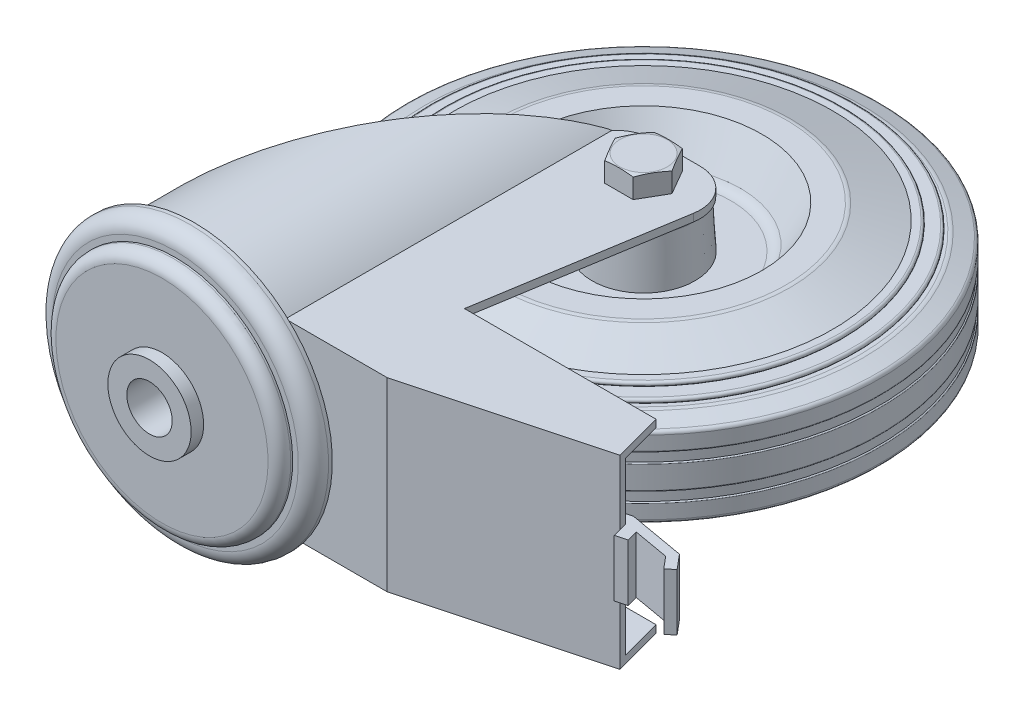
ISO-10303-21;
HEADER;
FILE_DESCRIPTION(('STEP AP214'),'2;1');
FILE_NAME('part.step','',(''),(''),'','','');
FILE_SCHEMA(('AUTOMOTIVE_DESIGN { 1 0 10303 214 1 1 1 1 }'));
ENDSEC;
DATA;
#1=APPLICATION_CONTEXT('core data for automotive mechanical design processes');
#2=APPLICATION_PROTOCOL_DEFINITION('international standard','automotive_design',2000,#1);
#3=PRODUCT_CONTEXT('',#1,'mechanical');
#4=PRODUCT('Part','Part','',(#3));
#5=PRODUCT_RELATED_PRODUCT_CATEGORY('part','',(#4));
#6=PRODUCT_DEFINITION_FORMATION('','',#4);
#7=PRODUCT_DEFINITION_CONTEXT('part definition',#1,'design');
#8=PRODUCT_DEFINITION('design','',#6,#7);
#9=PRODUCT_DEFINITION_SHAPE('','',#8);
#10=(LENGTH_UNIT() NAMED_UNIT(*) SI_UNIT(.MILLI.,.METRE.));
#11=(NAMED_UNIT(*) PLANE_ANGLE_UNIT() SI_UNIT($,.RADIAN.));
#12=(NAMED_UNIT(*) SI_UNIT($,.STERADIAN.) SOLID_ANGLE_UNIT());
#13=UNCERTAINTY_MEASURE_WITH_UNIT(LENGTH_MEASURE(1.E-05),#10,'distance_accuracy_value','');
#14=(GEOMETRIC_REPRESENTATION_CONTEXT(3) GLOBAL_UNCERTAINTY_ASSIGNED_CONTEXT((#13)) GLOBAL_UNIT_ASSIGNED_CONTEXT((#10,
#11,#12)) REPRESENTATION_CONTEXT('',''));
#15=CARTESIAN_POINT('',(0.,0.,0.));
#16=DIRECTION('',(0.,0.,1.));
#17=DIRECTION('',(1.,0.,0.));
#18=AXIS2_PLACEMENT_3D('',#15,#16,#17);
#19=CARTESIAN_POINT('',(57.,24.5,-13.8));
#20=DIRECTION('',(0.,1.,0.));
#21=DIRECTION('',(-1.,0.,0.));
#22=AXIS2_PLACEMENT_3D('',#19,#20,#21);
#23=PLANE('',#22);
#24=DIRECTION('',(-1.,0.,0.));
#25=VECTOR('',#24,1.);
#26=CARTESIAN_POINT('',(94.,24.5,-39.8));
#27=LINE('',#26,#25);
#28=CARTESIAN_POINT('',(94.,24.5,-39.8));
#29=VERTEX_POINT('',#28);
#30=CARTESIAN_POINT('',(43.3939258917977,24.5,-39.8));
#31=VERTEX_POINT('',#30);
#32=EDGE_CURVE('E1084',#29,#31,#27,.T.);
#33=ORIENTED_EDGE('',*,*,#32,.T.);
#34=DIRECTION('',(0.16015267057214,0.,-0.987092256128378));
#35=VECTOR('',#34,1.);
#36=CARTESIAN_POINT('',(39.6326844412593,24.5,-16.6177933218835));
#37=LINE('',#36,#35);
#38=CARTESIAN_POINT('',(51.8426385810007,24.5,-91.8731801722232));
#39=VERTEX_POINT('',#38);
#40=EDGE_CURVE('E1033',#31,#39,#37,.T.);
#41=ORIENTED_EDGE('',*,*,#40,.T.);
#42=CARTESIAN_POINT('',(41.9501958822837,24.5,-93.4781984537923));
#43=DIRECTION('',(0.,1.,0.));
#44=DIRECTION('',(-1.,0.,0.));
#45=AXIS2_PLACEMENT_3D('',#42,#43,#44);
#46=CIRCLE('',#45,10.0218015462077);
#47=CARTESIAN_POINT('',(41.9501958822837,24.5,-103.5));
#48=VERTEX_POINT('',#47);
#49=EDGE_CURVE('E1035',#39,#48,#46,.T.);
#50=ORIENTED_EDGE('',*,*,#49,.T.);
#51=DIRECTION('',(-1.,0.,0.));
#52=VECTOR('',#51,1.);
#53=CARTESIAN_POINT('',(57.,24.5,-103.5));
#54=LINE('',#53,#52);
#55=CARTESIAN_POINT('',(29.6876942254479,24.5,-103.5));
#56=VERTEX_POINT('',#55);
#57=EDGE_CURVE('E1037',#48,#56,#54,.T.);
#58=ORIENTED_EDGE('',*,*,#57,.T.);
#59=CARTESIAN_POINT('',(29.6876942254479,24.5,-93.4999999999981));
#60=DIRECTION('',(0.,1.,0.));
#61=DIRECTION('',(-1.,0.,0.));
#62=AXIS2_PLACEMENT_3D('',#59,#60,#61);
#63=CIRCLE('',#62,10.0000000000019);
#64=CARTESIAN_POINT('',(22.1076909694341,24.5,-100.022541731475));
#65=VERTEX_POINT('',#64);
#66=EDGE_CURVE('E960',#56,#65,#63,.T.);
#67=ORIENTED_EDGE('',*,*,#66,.T.);
#68=DIRECTION('',(0.,0.,1.));
#69=VECTOR('',#68,1.);
#70=CARTESIAN_POINT('',(22.1076909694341,24.5,-103.5));
#71=LINE('',#70,#69);
#72=CARTESIAN_POINT('',(22.1076909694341,24.5,-13.8));
#73=VERTEX_POINT('',#72);
#74=EDGE_CURVE('E967',#73,#65,#71,.F.);
#75=ORIENTED_EDGE('',*,*,#74,.F.);
#76=DIRECTION('',(1.,0.,0.));
#77=VECTOR('',#76,1.);
#78=CARTESIAN_POINT('',(7.,24.5,-13.8));
#79=LINE('',#78,#77);
#80=CARTESIAN_POINT('',(48.966679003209,24.5,-13.8));
#81=VERTEX_POINT('',#80);
#82=EDGE_CURVE('E962',#73,#81,#79,.T.);
#83=ORIENTED_EDGE('',*,*,#82,.T.);
#84=DIRECTION('',(0.965925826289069,0.,-0.258819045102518));
#85=VECTOR('',#84,1.);
#86=CARTESIAN_POINT('',(48.966679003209,24.5,-13.8));
#87=LINE('',#86,#85);
#88=CARTESIAN_POINT('',(97.483339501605,24.5,-26.8));
#89=VERTEX_POINT('',#88);
#90=EDGE_CURVE('E1079',#81,#89,#87,.T.);
#91=ORIENTED_EDGE('',*,*,#90,.T.);
#92=DIRECTION('',(-0.258819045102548,0.,-0.965925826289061));
#93=VECTOR('',#92,1.);
#94=CARTESIAN_POINT('',(97.483339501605,24.5,-26.8));
#95=LINE('',#94,#93);
#96=EDGE_CURVE('E1082',#89,#29,#95,.T.);
#97=ORIENTED_EDGE('',*,*,#96,.T.);
#98=EDGE_LOOP('',(#33,#41,#50,#58,#67,#75,#83,#91,#97));
#99=FACE_BOUND('',#98,.T.);
#100=DIRECTION('',(-0.5,0.,0.866025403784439));
#101=VECTOR('',#100,1.);
#102=CARTESIAN_POINT('',(40.7516651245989,24.5,-86.9980746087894));
#103=LINE('',#102,#101);
#104=CARTESIAN_POINT('',(44.5055534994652,24.5,-93.5));
#105=VERTEX_POINT('',#104);
#106=CARTESIAN_POINT('',(40.7527767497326,24.5,-87.));
#107=VERTEX_POINT('',#106);
#108=EDGE_CURVE('E557',#105,#107,#103,.T.);
#109=ORIENTED_EDGE('',*,*,#108,.T.);
#110=DIRECTION('',(-1.,0.,0.));
#111=VECTOR('',#110,1.);
#112=CARTESIAN_POINT('',(29.49,24.5,-87.));
#113=LINE('',#112,#111);
#114=CARTESIAN_POINT('',(33.2472232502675,24.5,-87.));
#115=VERTEX_POINT('',#114);
#116=EDGE_CURVE('E23',#107,#115,#113,.T.);
#117=ORIENTED_EDGE('',*,*,#116,.T.);
#118=DIRECTION('',(-0.5,0.,-0.866025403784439));
#119=VECTOR('',#118,1.);
#120=CARTESIAN_POINT('',(29.4933348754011,24.5,-93.5019253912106));
#121=LINE('',#120,#119);
#122=CARTESIAN_POINT('',(29.4944465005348,24.5,-93.5));
#123=VERTEX_POINT('',#122);
#124=EDGE_CURVE('E31',#115,#123,#121,.T.);
#125=ORIENTED_EDGE('',*,*,#124,.T.);
#126=DIRECTION('',(0.5,0.,-0.866025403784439));
#127=VECTOR('',#126,1.);
#128=CARTESIAN_POINT('',(29.4933348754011,24.5,-93.4980746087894));
#129=LINE('',#128,#127);
#130=CARTESIAN_POINT('',(33.2472232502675,24.5,-100.));
#131=VERTEX_POINT('',#130);
#132=EDGE_CURVE('E303',#123,#131,#129,.T.);
#133=ORIENTED_EDGE('',*,*,#132,.T.);
#134=DIRECTION('',(1.,0.,0.));
#135=VECTOR('',#134,1.);
#136=CARTESIAN_POINT('',(29.49,24.5,-100.));
#137=LINE('',#136,#135);
#138=CARTESIAN_POINT('',(40.7527767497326,24.5,-100.));
#139=VERTEX_POINT('',#138);
#140=EDGE_CURVE('E305',#131,#139,#137,.T.);
#141=ORIENTED_EDGE('',*,*,#140,.T.);
#142=DIRECTION('',(0.5,0.,0.866025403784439));
#143=VECTOR('',#142,1.);
#144=CARTESIAN_POINT('',(40.7516651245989,24.5,-100.001925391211));
#145=LINE('',#144,#143);
#146=EDGE_CURVE('E319',#139,#105,#145,.T.);
#147=ORIENTED_EDGE('',*,*,#146,.T.);
#148=EDGE_LOOP('',(#109,#117,#125,#133,#141,#147));
#149=FACE_BOUND('',#148,.T.);
#150=ADVANCED_FACE('F14',(#99,#149),#23,.T.);
#151=CARTESIAN_POINT('',(12.,22.5,-15.8));
#152=DIRECTION('',(0.,-1.,0.));
#153=DIRECTION('',(1.,0.,0.));
#154=AXIS2_PLACEMENT_3D('',#151,#152,#153);
#155=PLANE('',#154);
#156=DIRECTION('',(1.,0.,0.));
#157=VECTOR('',#156,1.);
#158=CARTESIAN_POINT('',(12.,22.5,-15.8));
#159=LINE('',#158,#157);
#160=CARTESIAN_POINT('',(21.3248681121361,22.5,-15.8));
#161=VERTEX_POINT('',#160);
#162=CARTESIAN_POINT('',(48.7033740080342,22.5,-15.8));
#163=VERTEX_POINT('',#162);
#164=EDGE_CURVE('E1100',#161,#163,#159,.T.);
#165=ORIENTED_EDGE('',*,*,#164,.F.);
#166=DIRECTION('',(0.,0.,1.));
#167=VECTOR('',#166,1.);
#168=CARTESIAN_POINT('',(21.3248681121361,22.5,-103.5));
#169=LINE('',#168,#167);
#170=CARTESIAN_POINT('',(21.3248681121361,22.5,-98.982986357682));
#171=VERTEX_POINT('',#170);
#172=EDGE_CURVE('E991',#171,#161,#169,.T.);
#173=ORIENTED_EDGE('',*,*,#172,.F.);
#174=CARTESIAN_POINT('',(29.6876942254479,22.5,-93.4999999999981));
#175=DIRECTION('',(0.,-1.,0.));
#176=DIRECTION('',(1.,0.,0.));
#177=AXIS2_PLACEMENT_3D('',#174,#175,#176);
#178=CIRCLE('',#177,10.0000000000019);
#179=CARTESIAN_POINT('',(29.6876942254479,22.5,-103.5));
#180=VERTEX_POINT('',#179);
#181=EDGE_CURVE('E1106',#180,#171,#178,.F.);
#182=ORIENTED_EDGE('',*,*,#181,.F.);
#183=DIRECTION('',(-1.,0.,0.));
#184=VECTOR('',#183,1.);
#185=CARTESIAN_POINT('',(29.6876942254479,22.5,-103.5));
#186=LINE('',#185,#184);
#187=CARTESIAN_POINT('',(41.9501958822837,22.5,-103.5));
#188=VERTEX_POINT('',#187);
#189=EDGE_CURVE('E1109',#188,#180,#186,.T.);
#190=ORIENTED_EDGE('',*,*,#189,.F.);
#191=CARTESIAN_POINT('',(41.9501958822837,22.5,-93.4781984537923));
#192=DIRECTION('',(0.,-1.,0.));
#193=DIRECTION('',(1.,0.,0.));
#194=AXIS2_PLACEMENT_3D('',#191,#192,#193);
#195=CIRCLE('',#194,10.0218015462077);
#196=CARTESIAN_POINT('',(51.8426385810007,22.5,-91.8731801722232));
#197=VERTEX_POINT('',#196);
#198=EDGE_CURVE('E1112',#197,#188,#195,.F.);
#199=ORIENTED_EDGE('',*,*,#198,.F.);
#200=DIRECTION('',(0.16015267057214,0.,-0.987092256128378));
#201=VECTOR('',#200,1.);
#202=CARTESIAN_POINT('',(51.8426385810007,22.5,-91.8731801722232));
#203=LINE('',#202,#201);
#204=CARTESIAN_POINT('',(43.3939258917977,22.5,-39.8));
#205=VERTEX_POINT('',#204);
#206=EDGE_CURVE('E1115',#205,#197,#203,.T.);
#207=ORIENTED_EDGE('',*,*,#206,.F.);
#208=DIRECTION('',(-1.,0.,0.));
#209=VECTOR('',#208,1.);
#210=CARTESIAN_POINT('',(94.,22.5,-39.8));
#211=LINE('',#210,#209);
#212=CARTESIAN_POINT('',(94.,22.5,-39.8));
#213=VERTEX_POINT('',#212);
#214=EDGE_CURVE('E1155',#213,#205,#211,.T.);
#215=ORIENTED_EDGE('',*,*,#214,.F.);
#216=DIRECTION('',(-0.258819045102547,0.,-0.965925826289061));
#217=VECTOR('',#216,1.);
#218=CARTESIAN_POINT('',(96.9657014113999,22.5,-28.7318516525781));
#219=LINE('',#218,#217);
#220=CARTESIAN_POINT('',(96.9657014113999,22.5,-28.7318516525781));
#221=VERTEX_POINT('',#220);
#222=EDGE_CURVE('E1152',#221,#213,#219,.T.);
#223=ORIENTED_EDGE('',*,*,#222,.F.);
#224=DIRECTION('',(0.965925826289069,0.,-0.258819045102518));
#225=VECTOR('',#224,1.);
#226=CARTESIAN_POINT('',(48.7033740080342,22.5,-15.8));
#227=LINE('',#226,#225);
#228=EDGE_CURVE('E1150',#163,#221,#227,.T.);
#229=ORIENTED_EDGE('',*,*,#228,.F.);
#230=EDGE_LOOP('',(#165,#173,#182,#190,#199,#207,#215,#223,#229));
#231=FACE_BOUND('',#230,.T.);
#232=CARTESIAN_POINT('',(37.,22.5,-93.5));
#233=DIRECTION('',(0.,-1.,0.));
#234=DIRECTION('',(1.,0.,0.));
#235=AXIS2_PLACEMENT_3D('',#232,#233,#234);
#236=CIRCLE('',#235,7.5);
#237=CARTESIAN_POINT('',(44.5,22.5,-93.5));
#238=VERTEX_POINT('',#237);
#239=EDGE_CURVE('E558',#238,#238,#236,.F.);
#240=ORIENTED_EDGE('',*,*,#239,.T.);
#241=EDGE_LOOP('',(#240));
#242=FACE_BOUND('',#241,.T.);
#243=ADVANCED_FACE('F899',(#231,#242),#155,.T.);
#244=CARTESIAN_POINT('',(0.,0.,-13.));
#245=DIRECTION('',(0.,0.,-1.));
#246=DIRECTION('',(-1.,0.,0.));
#247=AXIS2_PLACEMENT_3D('',#244,#245,#246);
#248=PLANE('',#247);
#249=CARTESIAN_POINT('',(0.,0.,-13.));
#250=DIRECTION('',(0.,0.,1.));
#251=DIRECTION('',(1.,0.,0.));
#252=AXIS2_PLACEMENT_3D('',#249,#250,#251);
#253=CIRCLE('',#252,31.);
#254=CARTESIAN_POINT('',(31.,0.,-13.));
#255=VERTEX_POINT('',#254);
#256=EDGE_CURVE('E1116',#255,#255,#253,.T.);
#257=ORIENTED_EDGE('',*,*,#256,.F.);
#258=EDGE_LOOP('',(#257));
#259=FACE_BOUND('',#258,.T.);
#260=CARTESIAN_POINT('',(0.,0.,-13.));
#261=DIRECTION('',(0.,0.,-1.));
#262=DIRECTION('',(-1.,0.,0.));
#263=AXIS2_PLACEMENT_3D('',#260,#261,#262);
#264=CIRCLE('',#263,6.);
#265=CARTESIAN_POINT('',(-6.,0.,-13.));
#266=VERTEX_POINT('',#265);
#267=EDGE_CURVE('E1274',#266,#266,#264,.F.);
#268=ORIENTED_EDGE('',*,*,#267,.T.);
#269=EDGE_LOOP('',(#268));
#270=FACE_BOUND('',#269,.T.);
#271=ADVANCED_FACE('F822',(#259,#270),#248,.T.);
#272=CARTESIAN_POINT('',(0.,0.,0.));
#273=DIRECTION('',(0.,0.,-1.));
#274=DIRECTION('',(0.,-1.,0.));
#275=AXIS2_PLACEMENT_3D('',#272,#273,#274);
#276=PLANE('',#275);
#277=CARTESIAN_POINT('',(0.,0.,0.));
#278=DIRECTION('',(0.,0.,1.));
#279=DIRECTION('',(1.,0.,0.));
#280=AXIS2_PLACEMENT_3D('',#277,#278,#279);
#281=CIRCLE('',#280,11.);
#282=CARTESIAN_POINT('',(11.,0.,0.));
#283=VERTEX_POINT('',#282);
#284=EDGE_CURVE('E592',#283,#283,#281,.T.);
#285=ORIENTED_EDGE('',*,*,#284,.T.);
#286=EDGE_LOOP('',(#285));
#287=FACE_BOUND('',#286,.T.);
#288=CARTESIAN_POINT('',(0.,0.,0.));
#289=DIRECTION('',(0.,0.,1.));
#290=DIRECTION('',(0.,1.,0.));
#291=AXIS2_PLACEMENT_3D('',#288,#289,#290);
#292=CIRCLE('',#291,6.);
#293=CARTESIAN_POINT('',(0.,6.,0.));
#294=VERTEX_POINT('',#293);
#295=EDGE_CURVE('E587',#294,#294,#292,.T.);
#296=ORIENTED_EDGE('',*,*,#295,.F.);
#297=EDGE_LOOP('',(#296));
#298=FACE_BOUND('',#297,.T.);
#299=ADVANCED_FACE('F819',(#287,#298),#276,.F.);
#300=CARTESIAN_POINT('',(0.,0.,-103.5));
#301=DIRECTION('',(0.,0.,1.));
#302=DIRECTION('',(0.,1.,0.));
#303=AXIS2_PLACEMENT_3D('',#300,#301,#302);
#304=CYLINDRICAL_SURFACE('',#303,33.);
#305=CARTESIAN_POINT('',(0.,0.,-66.3300724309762));
#306=DIRECTION('',(-0.837264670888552,0.,-0.546797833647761));
#307=DIRECTION('',(-0.546797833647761,0.,0.837264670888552));
#308=AXIS2_PLACEMENT_3D('',#305,#306,#307);
#309=ELLIPSE('',#308,60.3513729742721,33.);
#310=CARTESIAN_POINT('',(21.3150475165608,-25.1926328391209,-98.9679783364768));
#311=VERTEX_POINT('',#310);
#312=CARTESIAN_POINT('',(21.3150475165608,25.1926328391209,-98.9679783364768));
#313=VERTEX_POINT('',#312);
#314=EDGE_CURVE('E983',#311,#313,#309,.T.);
#315=ORIENTED_EDGE('',*,*,#314,.F.);
#316=CARTESIAN_POINT('',(29.6876942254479,-14.4097471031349,-103.5));
#317=CARTESIAN_POINT('',(29.5435611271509,-14.706711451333,-103.499985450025));
#318=CARTESIAN_POINT('',(29.3949486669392,-15.0015341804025,-103.49688262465));
#319=CARTESIAN_POINT('',(29.0889780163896,-15.586540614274,-103.483239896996));
#320=CARTESIAN_POINT('',(28.9316171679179,-15.8767228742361,-103.472697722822));
#321=CARTESIAN_POINT('',(28.6076252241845,-16.4533805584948,-103.442838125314));
#322=CARTESIAN_POINT('',(28.4409508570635,-16.739829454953,-103.423476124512));
#323=CARTESIAN_POINT('',(28.0994619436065,-17.3069283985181,-103.374577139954));
#324=CARTESIAN_POINT('',(27.9246481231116,-17.5875789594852,-103.345041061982));
#325=CARTESIAN_POINT('',(27.5632951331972,-18.1487919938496,-103.273516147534));
#326=CARTESIAN_POINT('',(27.3765797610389,-18.4292074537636,-103.231259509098));
#327=CARTESIAN_POINT('',(26.9958471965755,-18.9825445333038,-103.132892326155));
#328=CARTESIAN_POINT('',(26.801830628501,-19.2554667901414,-103.076782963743));
#329=CARTESIAN_POINT('',(26.407823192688,-19.7923595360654,-102.949086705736));
#330=CARTESIAN_POINT('',(26.207846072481,-20.0563480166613,-102.877533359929));
#331=CARTESIAN_POINT('',(25.8027645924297,-20.5748761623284,-102.71709081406));
#332=CARTESIAN_POINT('',(25.5976617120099,-20.8294185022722,-102.628206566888));
#333=CARTESIAN_POINT('',(25.1874040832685,-21.3236018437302,-102.432977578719));
#334=CARTESIAN_POINT('',(24.9823124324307,-21.5634251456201,-102.326963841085));
#335=CARTESIAN_POINT('',(24.570394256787,-22.0316348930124,-102.094715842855));
#336=CARTESIAN_POINT('',(24.3635675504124,-22.2600201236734,-101.968479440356));
#337=CARTESIAN_POINT('',(23.9525183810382,-22.7016952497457,-101.695608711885));
#338=CARTESIAN_POINT('',(23.7482905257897,-22.9151130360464,-101.549190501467));
#339=CARTESIAN_POINT('',(23.3430194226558,-23.3278164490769,-101.233756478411));
#340=CARTESIAN_POINT('',(23.1419754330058,-23.5271054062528,-101.064746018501));
#341=CARTESIAN_POINT('',(22.7984554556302,-23.8594121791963,-100.751019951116));
#342=CARTESIAN_POINT('',(22.6545361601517,-23.9960304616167,-100.611678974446));
#343=CARTESIAN_POINT('',(22.3714879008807,-24.2601313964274,-100.32014580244));
#344=CARTESIAN_POINT('',(22.2323574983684,-24.3876168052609,-100.167957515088));
#345=CARTESIAN_POINT('',(21.9587364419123,-24.6342887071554,-99.8488472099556));
#346=CARTESIAN_POINT('',(21.8243185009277,-24.7533615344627,-99.6817745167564));
#347=CARTESIAN_POINT('',(21.5633451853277,-24.9810394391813,-99.3345750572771));
#348=CARTESIAN_POINT('',(21.4367966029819,-25.0896355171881,-99.154437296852));
#349=CARTESIAN_POINT('',(21.3150475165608,-25.1926328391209,-98.9679783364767));
#350=B_SPLINE_CURVE_WITH_KNOTS('',3,(#316,#317,#318,#319,#320,#321,#322,#323,#324,#325,#326,
#327,#328,#329,#330,#331,#332,#333,#334,#335,#336,#337,#338,#339,#340,#341,#342,#343,#344,#345,
#346,#347,#348,#349),.UNSPECIFIED.,.F.,.F.,(4,2,2,2,2,2,2,2,2,2,2,2,2,2,2,2,4),(0.,
0.990274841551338,1.98085223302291,2.97649275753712,3.97204466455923,4.99022642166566,
6.00832132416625,7.02422643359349,8.03984163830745,9.03777129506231,10.0358067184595,
11.023883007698,12.0117256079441,12.73863910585,13.4653322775,14.2004708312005,
14.9362353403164),.UNSPECIFIED.);
#351=CARTESIAN_POINT('',(22.1076909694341,-24.5,-100.022541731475));
#352=VERTEX_POINT('',#351);
#353=EDGE_CURVE('E944',#352,#311,#350,.T.);
#354=ORIENTED_EDGE('',*,*,#353,.F.);
#355=DIRECTION('',(0.,0.,1.));
#356=VECTOR('',#355,1.);
#357=CARTESIAN_POINT('',(22.1076909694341,-24.5,-103.5));
#358=LINE('',#357,#356);
#359=CARTESIAN_POINT('',(22.1076909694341,-24.5,-13.8));
#360=VERTEX_POINT('',#359);
#361=EDGE_CURVE('E964',#360,#352,#358,.F.);
#362=ORIENTED_EDGE('',*,*,#361,.F.);
#363=CARTESIAN_POINT('',(0.,0.,-13.8));
#364=DIRECTION('',(0.,0.,-1.));
#365=DIRECTION('',(0.,-1.,0.));
#366=AXIS2_PLACEMENT_3D('',#363,#364,#365);
#367=CIRCLE('',#366,33.);
#368=EDGE_CURVE('E970',#73,#360,#367,.T.);
#369=ORIENTED_EDGE('',*,*,#368,.F.);
#370=ORIENTED_EDGE('',*,*,#74,.T.);
#371=CARTESIAN_POINT('',(21.3150475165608,25.1926328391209,-98.9679783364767));
#372=CARTESIAN_POINT('',(21.3928122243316,25.1268381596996,-99.0870552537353));
#373=CARTESIAN_POINT('',(21.4725263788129,25.0587746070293,-99.2035627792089));
#374=CARTESIAN_POINT('',(21.6354384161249,24.9182538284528,-99.4313384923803));
#375=CARTESIAN_POINT('',(21.7186356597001,24.8457974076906,-99.5426076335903));
#376=CARTESIAN_POINT('',(21.9725660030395,24.622288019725,-99.868076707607));
#377=CARTESIAN_POINT('',(22.1479225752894,24.4648554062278,-100.074370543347));
#378=CARTESIAN_POINT('',(22.5046943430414,24.1370356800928,-100.462247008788));
#379=CARTESIAN_POINT('',(22.6859675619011,23.9668963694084,-100.644172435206));
#380=CARTESIAN_POINT('',(23.05440760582,23.6127009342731,-100.987519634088));
#381=CARTESIAN_POINT('',(23.2415771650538,23.4286382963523,-101.14893171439));
#382=CARTESIAN_POINT('',(23.6677735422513,22.99891298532,-101.490818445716));
#383=CARTESIAN_POINT('',(23.9077502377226,22.7495874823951,-101.665509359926));
#384=CARTESIAN_POINT('',(24.3884815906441,22.2334536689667,-101.98538516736));
#385=CARTESIAN_POINT('',(24.6292363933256,21.9666418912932,-102.130564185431));
#386=CARTESIAN_POINT('',(25.1106208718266,21.414766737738,-102.395318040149));
#387=CARTESIAN_POINT('',(25.351220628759,21.1295362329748,-102.514596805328));
#388=CARTESIAN_POINT('',(25.8267831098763,20.5455394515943,-102.728289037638));
#389=CARTESIAN_POINT('',(26.0617461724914,20.2467739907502,-102.822704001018));
#390=CARTESIAN_POINT('',(26.6179561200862,19.5134195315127,-103.023457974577));
#391=CARTESIAN_POINT('',(26.9354266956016,19.0730123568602,-103.11902738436));
#392=CARTESIAN_POINT('',(27.5510689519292,18.1724141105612,-103.27423761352));
#393=CARTESIAN_POINT('',(27.8492226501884,17.7122052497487,-103.333845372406));
#394=CARTESIAN_POINT('',(28.2768060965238,17.0145447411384,-103.400989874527));
#395=CARTESIAN_POINT('',(28.4147137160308,16.7832265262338,-103.419577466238));
#396=CARTESIAN_POINT('',(28.6850079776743,16.3169514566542,-103.450534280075));
#397=CARTESIAN_POINT('',(28.8173943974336,16.0819944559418,-103.462903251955));
#398=CARTESIAN_POINT('',(29.0761710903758,15.6092515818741,-103.482126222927));
#399=CARTESIAN_POINT('',(29.2025737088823,15.3714729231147,-103.488992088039));
#400=CARTESIAN_POINT('',(29.4495398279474,14.8928555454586,-103.497925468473));
#401=CARTESIAN_POINT('',(29.5701041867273,14.652017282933,-103.499993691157));
#402=CARTESIAN_POINT('',(29.6876942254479,14.4097471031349,-103.5));
#403=B_SPLINE_CURVE_WITH_KNOTS('',3,(#371,#372,#373,#374,#375,#376,#377,#378,#379,#380,#381,
#382,#383,#384,#385,#386,#387,#388,#389,#390,#391,#392,#393,#394,#395,#396,#397,#398,#399,#400,
#401,#402),.UNSPECIFIED.,.F.,.F.,(4,2,2,2,2,2,2,2,2,2,2,2,2,2,2,4),(0.,0.469998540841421,
0.939911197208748,1.878032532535,2.80113208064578,3.72466616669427,4.88586201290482,
6.04728880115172,7.22136453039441,8.39536959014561,10.0468861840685,11.6999187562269,
12.5096415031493,13.3193968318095,14.1274014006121,14.9352868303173),.UNSPECIFIED.);
#404=EDGE_CURVE('E953',#313,#65,#403,.T.);
#405=ORIENTED_EDGE('',*,*,#404,.F.);
#406=EDGE_LOOP('',(#315,#354,#362,#369,#370,#405));
#407=FACE_BOUND('',#406,.T.);
#408=CARTESIAN_POINT('',(0.,0.,-11.8));
#409=DIRECTION('',(0.,0.,1.));
#410=DIRECTION('',(0.,1.,0.));
#411=AXIS2_PLACEMENT_3D('',#408,#409,#410);
#412=CIRCLE('',#411,33.);
#413=CARTESIAN_POINT('',(0.,33.,-11.8));
#414=VERTEX_POINT('',#413);
#415=EDGE_CURVE('E994',#414,#414,#412,.T.);
#416=ORIENTED_EDGE('',*,*,#415,.F.);
#417=EDGE_LOOP('',(#416));
#418=FACE_BOUND('',#417,.T.);
#419=ADVANCED_FACE('F440',(#407,#418),#304,.T.);
#420=CARTESIAN_POINT('',(97.483339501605,24.5,-26.8));
#421=DIRECTION('',(-0.965925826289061,0.,0.258819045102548));
#422=DIRECTION('',(0.258819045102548,0.,0.965925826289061));
#423=AXIS2_PLACEMENT_3D('',#420,#421,#422);
#424=PLANE('',#423);
#425=DIRECTION('',(0.258819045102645,0.,0.965925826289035));
#426=VECTOR('',#425,1.);
#427=CARTESIAN_POINT('',(96.9657014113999,-7.5,-28.7318516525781));
#428=LINE('',#427,#426);
#429=CARTESIAN_POINT('',(96.9657014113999,-7.5,-28.7318516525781));
#430=VERTEX_POINT('',#429);
#431=CARTESIAN_POINT('',(97.4833395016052,-7.5,-26.8));
#432=VERTEX_POINT('',#431);
#433=EDGE_CURVE('E1238',#430,#432,#428,.T.);
#434=ORIENTED_EDGE('',*,*,#433,.T.);
#435=DIRECTION('',(0.,-1.,0.));
#436=VECTOR('',#435,1.);
#437=CARTESIAN_POINT('',(97.483339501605,24.5,-26.8));
#438=LINE('',#437,#436);
#439=CARTESIAN_POINT('',(97.483339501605,-24.5,-26.8));
#440=VERTEX_POINT('',#439);
#441=EDGE_CURVE('E1096',#432,#440,#438,.T.);
#442=ORIENTED_EDGE('',*,*,#441,.T.);
#443=DIRECTION('',(-0.258819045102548,0.,-0.965925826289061));
#444=VECTOR('',#443,1.);
#445=CARTESIAN_POINT('',(97.483339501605,-24.5,-26.8));
#446=LINE('',#445,#444);
#447=CARTESIAN_POINT('',(94.,-24.5,-39.8));
#448=VERTEX_POINT('',#447);
#449=EDGE_CURVE('E1066',#440,#448,#446,.T.);
#450=ORIENTED_EDGE('',*,*,#449,.T.);
#451=DIRECTION('',(0.,-1.,0.));
#452=VECTOR('',#451,1.);
#453=CARTESIAN_POINT('',(94.,24.5,-39.8));
#454=LINE('',#453,#452);
#455=CARTESIAN_POINT('',(94.,-22.5,-39.8));
#456=VERTEX_POINT('',#455);
#457=EDGE_CURVE('E1092',#456,#448,#454,.T.);
#458=ORIENTED_EDGE('',*,*,#457,.F.);
#459=DIRECTION('',(-0.258819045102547,0.,-0.965925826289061));
#460=VECTOR('',#459,1.);
#461=CARTESIAN_POINT('',(96.9657014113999,-22.5,-28.7318516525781));
#462=LINE('',#461,#460);
#463=CARTESIAN_POINT('',(96.9657014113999,-22.5,-28.7318516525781));
#464=VERTEX_POINT('',#463);
#465=EDGE_CURVE('E1159',#464,#456,#462,.T.);
#466=ORIENTED_EDGE('',*,*,#465,.F.);
#467=DIRECTION('',(0.,-1.,0.));
#468=VECTOR('',#467,1.);
#469=CARTESIAN_POINT('',(96.9657014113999,22.5,-28.7318516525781));
#470=LINE('',#469,#468);
#471=EDGE_CURVE('E1157',#430,#464,#470,.T.);
#472=ORIENTED_EDGE('',*,*,#471,.F.);
#473=EDGE_LOOP('',(#434,#442,#450,#458,#466,#472));
#474=FACE_BOUND('',#473,.T.);
#475=ADVANCED_FACE('F884',(#474),#424,.F.);
#476=CARTESIAN_POINT('',(94.,24.5,-39.8));
#477=DIRECTION('',(0.,0.,1.));
#478=DIRECTION('',(1.,0.,0.));
#479=AXIS2_PLACEMENT_3D('',#476,#477,#478);
#480=PLANE('',#479);
#481=DIRECTION('',(-1.,0.,0.));
#482=VECTOR('',#481,1.);
#483=CARTESIAN_POINT('',(94.,-22.5,-39.8));
#484=LINE('',#483,#482);
#485=CARTESIAN_POINT('',(43.3939258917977,-22.5,-39.8));
#486=VERTEX_POINT('',#485);
#487=EDGE_CURVE('E1174',#456,#486,#484,.T.);
#488=ORIENTED_EDGE('',*,*,#487,.F.);
#489=ORIENTED_EDGE('',*,*,#457,.T.);
#490=DIRECTION('',(-1.,0.,0.));
#491=VECTOR('',#490,1.);
#492=CARTESIAN_POINT('',(94.,-24.5,-39.8));
#493=LINE('',#492,#491);
#494=CARTESIAN_POINT('',(43.3939258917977,-24.5,-39.8));
#495=VERTEX_POINT('',#494);
#496=EDGE_CURVE('E1070',#448,#495,#493,.T.);
#497=ORIENTED_EDGE('',*,*,#496,.T.);
#498=DIRECTION('',(0.,-1.,0.));
#499=VECTOR('',#498,1.);
#500=CARTESIAN_POINT('',(43.3939258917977,24.5,-39.8));
#501=LINE('',#500,#499);
#502=EDGE_CURVE('E1088',#486,#495,#501,.T.);
#503=ORIENTED_EDGE('',*,*,#502,.F.);
#504=EDGE_LOOP('',(#488,#489,#497,#503));
#505=FACE_BOUND('',#504,.T.);
#506=ADVANCED_FACE('F879',(#505),#480,.F.);
#507=CARTESIAN_POINT('',(51.8426385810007,125.,-91.8731801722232));
#508=DIRECTION('',(0.987092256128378,0.,0.16015267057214));
#509=DIRECTION('',(0.16015267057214,0.,-0.987092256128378));
#510=AXIS2_PLACEMENT_3D('',#507,#508,#509);
#511=PLANE('',#510);
#512=ORIENTED_EDGE('',*,*,#40,.F.);
#513=EDGE_CURVE('E1089',#31,#205,#501,.T.);
#514=ORIENTED_EDGE('',*,*,#513,.T.);
#515=ORIENTED_EDGE('',*,*,#206,.T.);
#516=DIRECTION('',(0.,-1.,0.));
#517=VECTOR('',#516,1.);
#518=CARTESIAN_POINT('',(51.8426385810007,125.,-91.8731801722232));
#519=LINE('',#518,#517);
#520=EDGE_CURVE('E930',#39,#197,#519,.T.);
#521=ORIENTED_EDGE('',*,*,#520,.F.);
#522=EDGE_LOOP('',(#512,#514,#515,#521));
#523=FACE_BOUND('',#522,.T.);
#524=ADVANCED_FACE('F1143',(#523),#511,.T.);
#525=DIRECTION('',(-0.16015267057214,0.,0.987092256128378));
#526=VECTOR('',#525,1.);
#527=CARTESIAN_POINT('',(51.8426385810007,-22.5,-91.8731801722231));
#528=LINE('',#527,#526);
#529=CARTESIAN_POINT('',(51.8426385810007,-22.5,-91.8731801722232));
#530=VERTEX_POINT('',#529);
#531=EDGE_CURVE('E1007',#530,#486,#528,.T.);
#532=ORIENTED_EDGE('',*,*,#531,.T.);
#533=ORIENTED_EDGE('',*,*,#502,.T.);
#534=DIRECTION('',(0.16015267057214,0.,-0.987092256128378));
#535=VECTOR('',#534,1.);
#536=CARTESIAN_POINT('',(39.6326844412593,-24.5,-16.6177933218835));
#537=LINE('',#536,#535);
#538=CARTESIAN_POINT('',(51.8426385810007,-24.5,-91.8731801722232));
#539=VERTEX_POINT('',#538);
#540=EDGE_CURVE('E973',#495,#539,#537,.T.);
#541=ORIENTED_EDGE('',*,*,#540,.T.);
#542=EDGE_CURVE('E928',#530,#539,#519,.T.);
#543=ORIENTED_EDGE('',*,*,#542,.F.);
#544=EDGE_LOOP('',(#532,#533,#541,#543));
#545=FACE_BOUND('',#544,.T.);
#546=ADVANCED_FACE('F1311',(#545),#511,.T.);
#547=CARTESIAN_POINT('',(57.,-24.5,-13.8));
#548=DIRECTION('',(0.,1.,0.));
#549=DIRECTION('',(-1.,0.,0.));
#550=AXIS2_PLACEMENT_3D('',#547,#548,#549);
#551=PLANE('',#550);
#552=CARTESIAN_POINT('',(37.,-24.5,-93.5));
#553=DIRECTION('',(0.,1.,0.));
#554=DIRECTION('',(0.,0.,-1.));
#555=AXIS2_PLACEMENT_3D('',#552,#553,#554);
#556=CIRCLE('',#555,6.2583333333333);
#557=CARTESIAN_POINT('',(37.,-24.5,-99.7583333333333));
#558=VERTEX_POINT('',#557);
#559=EDGE_CURVE('E554',#558,#558,#556,.T.);
#560=ORIENTED_EDGE('',*,*,#559,.T.);
#561=EDGE_LOOP('',(#560));
#562=FACE_BOUND('',#561,.T.);
#563=ORIENTED_EDGE('',*,*,#540,.F.);
#564=ORIENTED_EDGE('',*,*,#496,.F.);
#565=ORIENTED_EDGE('',*,*,#449,.F.);
#566=DIRECTION('',(0.965925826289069,0.,-0.258819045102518));
#567=VECTOR('',#566,1.);
#568=CARTESIAN_POINT('',(48.966679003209,-24.5,-13.8));
#569=LINE('',#568,#567);
#570=CARTESIAN_POINT('',(48.966679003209,-24.5,-13.8));
#571=VERTEX_POINT('',#570);
#572=EDGE_CURVE('E1063',#571,#440,#569,.T.);
#573=ORIENTED_EDGE('',*,*,#572,.F.);
#574=DIRECTION('',(1.,0.,0.));
#575=VECTOR('',#574,1.);
#576=CARTESIAN_POINT('',(7.,-24.5,-13.8));
#577=LINE('',#576,#575);
#578=EDGE_CURVE('E959',#360,#571,#577,.T.);
#579=ORIENTED_EDGE('',*,*,#578,.F.);
#580=ORIENTED_EDGE('',*,*,#361,.T.);
#581=CARTESIAN_POINT('',(29.6876942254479,-24.5,-93.4999999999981));
#582=DIRECTION('',(0.,1.,0.));
#583=DIRECTION('',(-1.,0.,0.));
#584=AXIS2_PLACEMENT_3D('',#581,#582,#583);
#585=CIRCLE('',#584,10.0000000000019);
#586=CARTESIAN_POINT('',(29.6876942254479,-24.5,-103.5));
#587=VERTEX_POINT('',#586);
#588=EDGE_CURVE('E981',#587,#352,#585,.T.);
#589=ORIENTED_EDGE('',*,*,#588,.F.);
#590=DIRECTION('',(-1.,0.,0.));
#591=VECTOR('',#590,1.);
#592=CARTESIAN_POINT('',(57.,-24.5,-103.5));
#593=LINE('',#592,#591);
#594=CARTESIAN_POINT('',(41.9501958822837,-24.5,-103.5));
#595=VERTEX_POINT('',#594);
#596=EDGE_CURVE('E978',#595,#587,#593,.T.);
#597=ORIENTED_EDGE('',*,*,#596,.F.);
#598=CARTESIAN_POINT('',(41.9501958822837,-24.5,-93.4781984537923));
#599=DIRECTION('',(0.,1.,0.));
#600=DIRECTION('',(-1.,0.,0.));
#601=AXIS2_PLACEMENT_3D('',#598,#599,#600);
#602=CIRCLE('',#601,10.0218015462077);
#603=EDGE_CURVE('E975',#539,#595,#602,.T.);
#604=ORIENTED_EDGE('',*,*,#603,.F.);
#605=EDGE_LOOP('',(#563,#564,#565,#573,#579,#580,#589,#597,#604));
#606=FACE_BOUND('',#605,.T.);
#607=ADVANCED_FACE('F897',(#562,#606),#551,.F.);
#608=CARTESIAN_POINT('',(12.,-22.5,-118.5));
#609=DIRECTION('',(0.,1.,0.));
#610=DIRECTION('',(0.,0.,-1.));
#611=AXIS2_PLACEMENT_3D('',#608,#609,#610);
#612=PLANE('',#611);
#613=CARTESIAN_POINT('',(37.,-22.5,-93.5));
#614=DIRECTION('',(0.,1.,0.));
#615=DIRECTION('',(0.,0.,-1.));
#616=AXIS2_PLACEMENT_3D('',#613,#614,#615);
#617=CIRCLE('',#616,7.5);
#618=CARTESIAN_POINT('',(37.,-22.5,-101.));
#619=VERTEX_POINT('',#618);
#620=EDGE_CURVE('E719',#619,#619,#617,.T.);
#621=ORIENTED_EDGE('',*,*,#620,.F.);
#622=EDGE_LOOP('',(#621));
#623=FACE_BOUND('',#622,.T.);
#624=CARTESIAN_POINT('',(41.9501958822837,-22.5,-93.4781984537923));
#625=DIRECTION('',(0.,1.,0.));
#626=DIRECTION('',(0.,0.,-1.));
#627=AXIS2_PLACEMENT_3D('',#624,#625,#626);
#628=CIRCLE('',#627,10.0218015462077);
#629=CARTESIAN_POINT('',(41.9501958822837,-22.5,-103.5));
#630=VERTEX_POINT('',#629);
#631=EDGE_CURVE('E1002',#630,#530,#628,.F.);
#632=ORIENTED_EDGE('',*,*,#631,.F.);
#633=DIRECTION('',(1.,0.,0.));
#634=VECTOR('',#633,1.);
#635=CARTESIAN_POINT('',(29.6876942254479,-22.5,-103.5));
#636=LINE('',#635,#634);
#637=CARTESIAN_POINT('',(29.6876942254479,-22.5,-103.5));
#638=VERTEX_POINT('',#637);
#639=EDGE_CURVE('E1004',#638,#630,#636,.T.);
#640=ORIENTED_EDGE('',*,*,#639,.F.);
#641=CARTESIAN_POINT('',(29.6876942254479,-22.5,-93.4999999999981));
#642=DIRECTION('',(0.,1.,0.));
#643=DIRECTION('',(0.,0.,-1.));
#644=AXIS2_PLACEMENT_3D('',#641,#642,#643);
#645=CIRCLE('',#644,10.0000000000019);
#646=CARTESIAN_POINT('',(21.3248681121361,-22.5,-98.982986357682));
#647=VERTEX_POINT('',#646);
#648=EDGE_CURVE('E1018',#647,#638,#645,.F.);
#649=ORIENTED_EDGE('',*,*,#648,.F.);
#650=DIRECTION('',(0.,0.,1.));
#651=VECTOR('',#650,1.);
#652=CARTESIAN_POINT('',(21.3248681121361,-22.5,-103.5));
#653=LINE('',#652,#651);
#654=CARTESIAN_POINT('',(21.3248681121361,-22.5,-15.8));
#655=VERTEX_POINT('',#654);
#656=EDGE_CURVE('E988',#655,#647,#653,.F.);
#657=ORIENTED_EDGE('',*,*,#656,.F.);
#658=DIRECTION('',(1.,0.,0.));
#659=VECTOR('',#658,1.);
#660=CARTESIAN_POINT('',(12.,-22.5,-15.8));
#661=LINE('',#660,#659);
#662=CARTESIAN_POINT('',(48.7033740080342,-22.5,-15.8));
#663=VERTEX_POINT('',#662);
#664=EDGE_CURVE('E1102',#655,#663,#661,.T.);
#665=ORIENTED_EDGE('',*,*,#664,.T.);
#666=DIRECTION('',(0.965925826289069,0.,-0.258819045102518));
#667=VECTOR('',#666,1.);
#668=CARTESIAN_POINT('',(48.7033740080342,-22.5,-15.8));
#669=LINE('',#668,#667);
#670=EDGE_CURVE('E1167',#663,#464,#669,.T.);
#671=ORIENTED_EDGE('',*,*,#670,.T.);
#672=ORIENTED_EDGE('',*,*,#465,.T.);
#673=ORIENTED_EDGE('',*,*,#487,.T.);
#674=ORIENTED_EDGE('',*,*,#531,.F.);
#675=EDGE_LOOP('',(#632,#640,#649,#657,#665,#671,#672,#673,#674));
#676=FACE_BOUND('',#675,.T.);
#677=ADVANCED_FACE('F893',(#623,#676),#612,.T.);
#678=CARTESIAN_POINT('',(29.6876942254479,125.,-93.4999999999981));
#679=DIRECTION('',(0.,-1.,0.));
#680=DIRECTION('',(1.,0.,0.));
#681=AXIS2_PLACEMENT_3D('',#678,#679,#680);
#682=CYLINDRICAL_SURFACE('',#681,10.0000000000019);
#683=DIRECTION('',(0.,-1.,0.));
#684=VECTOR('',#683,1.);
#685=CARTESIAN_POINT('',(29.6876942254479,125.,-103.5));
#686=LINE('',#685,#684);
#687=EDGE_CURVE('E1026',#56,#180,#686,.T.);
#688=ORIENTED_EDGE('',*,*,#687,.T.);
#689=ORIENTED_EDGE('',*,*,#181,.T.);
#690=CARTESIAN_POINT('',(29.6876942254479,8.92417007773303,-103.5));
#691=CARTESIAN_POINT('',(29.5773045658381,9.29142028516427,-103.499970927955));
#692=CARTESIAN_POINT('',(29.4600829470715,9.65663825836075,-103.49817063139));
#693=CARTESIAN_POINT('',(29.2121671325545,10.3825002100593,-103.489465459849));
#694=CARTESIAN_POINT('',(29.0814698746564,10.7431431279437,-103.482559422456));
#695=CARTESIAN_POINT('',(28.8061520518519,11.4609833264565,-103.462027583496));
#696=CARTESIAN_POINT('',(28.6614645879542,11.8181540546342,-103.448368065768));
#697=CARTESIAN_POINT('',(28.3590477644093,12.5264792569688,-103.4125120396));
#698=CARTESIAN_POINT('',(28.201319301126,12.877634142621,-103.390316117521));
#699=CARTESIAN_POINT('',(27.868754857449,13.5826548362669,-103.334665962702));
#700=CARTESIAN_POINT('',(27.6935698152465,13.9363337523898,-103.300921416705));
#701=CARTESIAN_POINT('',(27.3304660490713,14.6356013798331,-103.219983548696));
#702=CARTESIAN_POINT('',(27.1425459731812,14.9811892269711,-103.172788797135));
#703=CARTESIAN_POINT('',(26.7553002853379,15.6622794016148,-103.062505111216));
#704=CARTESIAN_POINT('',(26.5560021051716,15.9978032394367,-102.999453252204));
#705=CARTESIAN_POINT('',(26.14684966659,16.6581214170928,-102.854651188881));
#706=CARTESIAN_POINT('',(25.9369988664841,16.9829192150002,-102.772907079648));
#707=CARTESIAN_POINT('',(25.5300175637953,17.5879894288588,-102.597128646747));
#708=CARTESIAN_POINT('',(25.3337480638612,17.8694420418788,-102.505174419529));
#709=CARTESIAN_POINT('',(24.9355266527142,18.4210528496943,-102.301529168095));
#710=CARTESIAN_POINT('',(24.7335744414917,18.6912104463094,-102.189837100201));
#711=CARTESIAN_POINT('',(24.328400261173,19.2155521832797,-101.945900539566));
#712=CARTESIAN_POINT('',(24.1252195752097,19.4698842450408,-101.813907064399));
#713=CARTESIAN_POINT('',(23.7178498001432,19.9641202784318,-101.526399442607));
#714=CARTESIAN_POINT('',(23.5136607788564,20.204025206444,-101.370886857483));
#715=CARTESIAN_POINT('',(23.1354639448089,20.6354282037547,-101.057772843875));
#716=CARTESIAN_POINT('',(22.9611791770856,20.829038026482,-100.903420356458));
#717=CARTESIAN_POINT('',(22.6166614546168,21.2026219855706,-100.575104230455));
#718=CARTESIAN_POINT('',(22.4464267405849,21.3826021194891,-100.401149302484));
#719=CARTESIAN_POINT('',(22.1098421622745,21.730492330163,-100.029923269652));
#720=CARTESIAN_POINT('',(21.9436057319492,21.8981486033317,-99.8323093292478));
#721=CARTESIAN_POINT('',(21.6210145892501,22.2167452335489,-99.4159400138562));
#722=CARTESIAN_POINT('',(21.4646763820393,22.3676579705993,-99.1971507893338));
#723=CARTESIAN_POINT('',(21.3150475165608,22.5093036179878,-98.9679783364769));
#724=B_SPLINE_CURVE_WITH_KNOTS('',3,(#690,#691,#692,#693,#694,#695,#696,#697,#698,#699,#700,
#701,#702,#703,#704,#705,#706,#707,#708,#709,#710,#711,#712,#713,#714,#715,#716,#717,#718,#719,
#720,#721,#722,#723),.UNSPECIFIED.,.F.,.F.,(4,2,2,2,2,2,2,2,2,2,2,2,2,2,2,2,4),(0.,
1.15040773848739,2.30107746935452,3.4575507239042,4.61394455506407,5.80185082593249,
6.98988339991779,8.17516365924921,9.36005797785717,10.4250759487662,11.4901502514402,
12.5429811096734,13.5957420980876,14.5032431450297,15.4103425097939,16.3326926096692,
17.2565422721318),.UNSPECIFIED.);
#725=CARTESIAN_POINT('',(21.3150475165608,22.5093036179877,-98.9679783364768));
#726=VERTEX_POINT('',#725);
#727=EDGE_CURVE('E922',#171,#726,#724,.T.);
#728=ORIENTED_EDGE('',*,*,#727,.T.);
#729=DIRECTION('',(0.,-1.,0.));
#730=VECTOR('',#729,1.);
#731=CARTESIAN_POINT('',(21.3150475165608,125.,-98.9679783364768));
#732=LINE('',#731,#730);
#733=EDGE_CURVE('E1030',#313,#726,#732,.T.);
#734=ORIENTED_EDGE('',*,*,#733,.F.);
#735=ORIENTED_EDGE('',*,*,#404,.T.);
#736=ORIENTED_EDGE('',*,*,#66,.F.);
#737=EDGE_LOOP('',(#688,#689,#728,#734,#735,#736));
#738=FACE_BOUND('',#737,.T.);
#739=ADVANCED_FACE('F896',(#738),#682,.T.);
#740=CARTESIAN_POINT('',(21.3150475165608,-22.5093036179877,-98.9679783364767));
#741=CARTESIAN_POINT('',(21.4694971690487,-22.3630990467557,-99.2045380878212));
#742=CARTESIAN_POINT('',(21.6310877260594,-22.2070219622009,-99.4300196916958));
#743=CARTESIAN_POINT('',(21.9646936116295,-21.8770778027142,-99.8583488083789));
#744=CARTESIAN_POINT('',(22.1366893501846,-21.7032437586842,-100.061236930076));
#745=CARTESIAN_POINT('',(22.485616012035,-21.3414988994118,-100.442338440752));
#746=CARTESIAN_POINT('',(22.6624568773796,-21.1537941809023,-100.620831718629));
#747=CARTESIAN_POINT('',(23.0202175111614,-20.7639020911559,-100.956876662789));
#748=CARTESIAN_POINT('',(23.2011394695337,-20.5617068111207,-101.114416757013));
#749=CARTESIAN_POINT('',(23.6183494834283,-20.0823841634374,-101.453313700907));
#750=CARTESIAN_POINT('',(23.85511766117,-19.8008414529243,-101.627841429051));
#751=CARTESIAN_POINT('',(24.3262754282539,-19.2190683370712,-101.946067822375));
#752=CARTESIAN_POINT('',(24.5606645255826,-18.9188341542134,-102.08976022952));
#753=CARTESIAN_POINT('',(25.0247094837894,-18.3006592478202,-102.350297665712));
#754=CARTESIAN_POINT('',(25.25433227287,-17.9826303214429,-102.466990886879));
#755=CARTESIAN_POINT('',(25.7048357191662,-17.3325675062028,-102.675975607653));
#756=CARTESIAN_POINT('',(25.925713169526,-17.0005285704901,-102.76825822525));
#757=CARTESIAN_POINT('',(26.30929817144,-16.3987423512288,-102.913754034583));
#758=CARTESIAN_POINT('',(26.4741298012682,-16.1313246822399,-102.971096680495));
#759=CARTESIAN_POINT('',(26.7965004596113,-15.5899607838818,-103.074425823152));
#760=CARTESIAN_POINT('',(26.95403858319,-15.3160137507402,-103.120410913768));
#761=CARTESIAN_POINT('',(27.4149771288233,-14.4851625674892,-103.243518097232));
#762=CARTESIAN_POINT('',(27.7065871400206,-13.9194277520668,-103.305750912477));
#763=CARTESIAN_POINT('',(28.2548374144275,-12.7698764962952,-103.400716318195));
#764=CARTESIAN_POINT('',(28.5115132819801,-12.1860792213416,-103.433479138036));
#765=CARTESIAN_POINT('',(28.9884781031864,-11.0033793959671,-103.478398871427));
#766=CARTESIAN_POINT('',(29.2087867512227,-10.4044852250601,-103.490566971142));
#767=CARTESIAN_POINT('',(29.4587856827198,-9.65419235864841,-103.497495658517));
#768=CARTESIAN_POINT('',(29.5061142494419,-9.5085586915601,-103.498457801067));
#769=CARTESIAN_POINT('',(29.5985516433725,-9.21678429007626,-103.499709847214));
#770=CARTESIAN_POINT('',(29.6436631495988,-9.07064440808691,-103.50000058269));
#771=CARTESIAN_POINT('',(29.6876942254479,-8.92417007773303,-103.5));
#772=B_SPLINE_CURVE_WITH_KNOTS('',3,(#740,#741,#742,#743,#744,#745,#746,#747,#748,#749,#750,
#751,#752,#753,#754,#755,#756,#757,#758,#759,#760,#761,#762,#763,#764,#765,#766,#767,#768,#769,
#770,#771),.UNSPECIFIED.,.F.,.F.,(4,2,2,2,2,2,2,2,2,2,2,2,2,2,2,4),(0.,0.953557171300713,
1.9053717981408,2.84513524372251,3.78541556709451,5.00504328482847,6.22491829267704,
7.45149405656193,8.67851550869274,9.63613354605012,10.593870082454,12.5099912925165,
14.4241447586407,16.3372582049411,16.7966521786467,17.2554766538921),.UNSPECIFIED.);
#773=CARTESIAN_POINT('',(21.3150475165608,-22.5093036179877,-98.9679783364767));
#774=VERTEX_POINT('',#773);
#775=EDGE_CURVE('E913',#774,#647,#772,.T.);
#776=ORIENTED_EDGE('',*,*,#775,.T.);
#777=ORIENTED_EDGE('',*,*,#648,.T.);
#778=EDGE_CURVE('E1017',#638,#587,#686,.T.);
#779=ORIENTED_EDGE('',*,*,#778,.T.);
#780=ORIENTED_EDGE('',*,*,#588,.T.);
#781=ORIENTED_EDGE('',*,*,#353,.T.);
#782=EDGE_CURVE('E1029',#774,#311,#732,.T.);
#783=ORIENTED_EDGE('',*,*,#782,.F.);
#784=EDGE_LOOP('',(#776,#777,#779,#780,#781,#783));
#785=FACE_BOUND('',#784,.T.);
#786=ADVANCED_FACE('F936',(#785),#682,.T.);
#787=CARTESIAN_POINT('',(29.6876942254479,125.,-103.5));
#788=DIRECTION('',(0.,0.,-1.));
#789=DIRECTION('',(-1.,0.,0.));
#790=AXIS2_PLACEMENT_3D('',#787,#788,#789);
#791=PLANE('',#790);
#792=DIRECTION('',(0.,-1.,0.));
#793=VECTOR('',#792,1.);
#794=CARTESIAN_POINT('',(41.9501958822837,125.,-103.5));
#795=LINE('',#794,#793);
#796=EDGE_CURVE('E1022',#48,#188,#795,.T.);
#797=ORIENTED_EDGE('',*,*,#796,.T.);
#798=ORIENTED_EDGE('',*,*,#189,.T.);
#799=ORIENTED_EDGE('',*,*,#687,.F.);
#800=ORIENTED_EDGE('',*,*,#57,.F.);
#801=EDGE_LOOP('',(#797,#798,#799,#800));
#802=FACE_BOUND('',#801,.T.);
#803=ADVANCED_FACE('F938',(#802),#791,.T.);
#804=ORIENTED_EDGE('',*,*,#778,.F.);
#805=ORIENTED_EDGE('',*,*,#639,.T.);
#806=EDGE_CURVE('E1016',#630,#595,#795,.T.);
#807=ORIENTED_EDGE('',*,*,#806,.T.);
#808=ORIENTED_EDGE('',*,*,#596,.T.);
#809=EDGE_LOOP('',(#804,#805,#807,#808));
#810=FACE_BOUND('',#809,.T.);
#811=ADVANCED_FACE('F1015',(#810),#791,.T.);
#812=CARTESIAN_POINT('',(41.9501958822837,125.,-93.4781984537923));
#813=DIRECTION('',(0.,-1.,0.));
#814=DIRECTION('',(1.,0.,0.));
#815=AXIS2_PLACEMENT_3D('',#812,#813,#814);
#816=CYLINDRICAL_SURFACE('',#815,10.0218015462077);
#817=ORIENTED_EDGE('',*,*,#520,.T.);
#818=ORIENTED_EDGE('',*,*,#198,.T.);
#819=ORIENTED_EDGE('',*,*,#796,.F.);
#820=ORIENTED_EDGE('',*,*,#49,.F.);
#821=EDGE_LOOP('',(#817,#818,#819,#820));
#822=FACE_BOUND('',#821,.T.);
#823=ADVANCED_FACE('F1134',(#822),#816,.T.);
#824=ORIENTED_EDGE('',*,*,#806,.F.);
#825=ORIENTED_EDGE('',*,*,#631,.T.);
#826=ORIENTED_EDGE('',*,*,#542,.T.);
#827=ORIENTED_EDGE('',*,*,#603,.T.);
#828=EDGE_LOOP('',(#824,#825,#826,#827));
#829=FACE_BOUND('',#828,.T.);
#830=ADVANCED_FACE('F908',(#829),#816,.T.);
#831=CARTESIAN_POINT('',(0.,0.,-103.5));
#832=DIRECTION('',(0.,0.,1.));
#833=DIRECTION('',(1.,0.,0.));
#834=AXIS2_PLACEMENT_3D('',#831,#832,#833);
#835=CYLINDRICAL_SURFACE('',#834,31.);
#836=ORIENTED_EDGE('',*,*,#256,.T.);
#837=EDGE_LOOP('',(#836));
#838=FACE_BOUND('',#837,.T.);
#839=ORIENTED_EDGE('',*,*,#727,.F.);
#840=ORIENTED_EDGE('',*,*,#172,.T.);
#841=CARTESIAN_POINT('',(0.,0.,-15.8));
#842=DIRECTION('',(0.,0.,-1.));
#843=DIRECTION('',(0.,-1.,0.));
#844=AXIS2_PLACEMENT_3D('',#841,#842,#843);
#845=CIRCLE('',#844,31.);
#846=EDGE_CURVE('E985',#161,#655,#845,.T.);
#847=ORIENTED_EDGE('',*,*,#846,.T.);
#848=ORIENTED_EDGE('',*,*,#656,.T.);
#849=ORIENTED_EDGE('',*,*,#775,.F.);
#850=CARTESIAN_POINT('',(0.,0.,-66.3300724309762));
#851=DIRECTION('',(-0.837264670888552,0.,-0.546797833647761));
#852=DIRECTION('',(-0.546797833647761,0.,0.837264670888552));
#853=AXIS2_PLACEMENT_3D('',#850,#851,#852);
#854=ELLIPSE('',#853,56.6937140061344,31.);
#855=EDGE_CURVE('E929',#726,#774,#854,.F.);
#856=ORIENTED_EDGE('',*,*,#855,.F.);
#857=EDGE_LOOP('',(#839,#840,#847,#848,#849,#856));
#858=FACE_BOUND('',#857,.T.);
#859=ADVANCED_FACE('F903',(#838,#858),#835,.F.);
#860=CARTESIAN_POINT('',(-33.,125.,-15.8));
#861=DIRECTION('',(-0.837264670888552,0.,-0.546797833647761));
#862=DIRECTION('',(-0.546797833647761,0.,0.837264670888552));
#863=AXIS2_PLACEMENT_3D('',#860,#861,#862);
#864=PLANE('',#863);
#865=ORIENTED_EDGE('',*,*,#733,.T.);
#866=ORIENTED_EDGE('',*,*,#855,.T.);
#867=ORIENTED_EDGE('',*,*,#782,.T.);
#868=ORIENTED_EDGE('',*,*,#314,.T.);
#869=EDGE_LOOP('',(#865,#866,#867,#868));
#870=FACE_BOUND('',#869,.T.);
#871=ADVANCED_FACE('F907',(#870),#864,.T.);
#872=CARTESIAN_POINT('',(7.,24.5,-13.8));
#873=DIRECTION('',(0.,0.,-1.));
#874=DIRECTION('',(0.,-1.,0.));
#875=AXIS2_PLACEMENT_3D('',#872,#873,#874);
#876=PLANE('',#875);
#877=ORIENTED_EDGE('',*,*,#578,.T.);
#878=DIRECTION('',(0.,-1.,0.));
#879=VECTOR('',#878,1.);
#880=CARTESIAN_POINT('',(48.966679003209,24.5,-13.8));
#881=LINE('',#880,#879);
#882=EDGE_CURVE('E1086',#81,#571,#881,.T.);
#883=ORIENTED_EDGE('',*,*,#882,.F.);
#884=ORIENTED_EDGE('',*,*,#82,.F.);
#885=ORIENTED_EDGE('',*,*,#368,.T.);
#886=EDGE_LOOP('',(#877,#883,#884,#885));
#887=FACE_BOUND('',#886,.T.);
#888=ADVANCED_FACE('F891',(#887),#876,.F.);
#889=CARTESIAN_POINT('',(12.,-22.5,-15.8));
#890=DIRECTION('',(0.,0.,-1.));
#891=DIRECTION('',(0.,-1.,0.));
#892=AXIS2_PLACEMENT_3D('',#889,#890,#891);
#893=PLANE('',#892);
#894=ORIENTED_EDGE('',*,*,#664,.F.);
#895=ORIENTED_EDGE('',*,*,#846,.F.);
#896=ORIENTED_EDGE('',*,*,#164,.T.);
#897=DIRECTION('',(0.,-1.,0.));
#898=VECTOR('',#897,1.);
#899=CARTESIAN_POINT('',(48.7033740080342,22.5,-15.8));
#900=LINE('',#899,#898);
#901=EDGE_CURVE('E1068',#163,#663,#900,.T.);
#902=ORIENTED_EDGE('',*,*,#901,.T.);
#903=EDGE_LOOP('',(#894,#895,#896,#902));
#904=FACE_BOUND('',#903,.T.);
#905=ADVANCED_FACE('F887',(#904),#893,.T.);
#906=CARTESIAN_POINT('',(48.966679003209,24.5,-13.8));
#907=DIRECTION('',(-0.258819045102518,0.,-0.965925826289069));
#908=DIRECTION('',(-0.965925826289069,0.,0.258819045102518));
#909=AXIS2_PLACEMENT_3D('',#906,#907,#908);
#910=PLANE('',#909);
#911=ORIENTED_EDGE('',*,*,#882,.T.);
#912=ORIENTED_EDGE('',*,*,#572,.T.);
#913=ORIENTED_EDGE('',*,*,#441,.F.);
#914=DIRECTION('',(0.,-1.,0.));
#915=VECTOR('',#914,1.);
#916=CARTESIAN_POINT('',(97.4833395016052,24.5,-26.8));
#917=LINE('',#916,#915);
#918=CARTESIAN_POINT('',(97.4833395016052,7.5,-26.8));
#919=VERTEX_POINT('',#918);
#920=EDGE_CURVE('E1179',#919,#432,#917,.T.);
#921=ORIENTED_EDGE('',*,*,#920,.F.);
#922=EDGE_CURVE('E1097',#89,#919,#438,.T.);
#923=ORIENTED_EDGE('',*,*,#922,.F.);
#924=ORIENTED_EDGE('',*,*,#90,.F.);
#925=EDGE_LOOP('',(#911,#912,#913,#921,#923,#924));
#926=FACE_BOUND('',#925,.T.);
#927=ADVANCED_FACE('F882',(#926),#910,.F.);
#928=ORIENTED_EDGE('',*,*,#922,.T.);
#929=DIRECTION('',(0.258819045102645,0.,0.965925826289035));
#930=VECTOR('',#929,1.);
#931=CARTESIAN_POINT('',(96.9657014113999,7.5,-28.7318516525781));
#932=LINE('',#931,#930);
#933=CARTESIAN_POINT('',(96.9657014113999,7.5,-28.7318516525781));
#934=VERTEX_POINT('',#933);
#935=EDGE_CURVE('E1209',#934,#919,#932,.T.);
#936=ORIENTED_EDGE('',*,*,#935,.F.);
#937=EDGE_CURVE('E1073',#221,#934,#470,.T.);
#938=ORIENTED_EDGE('',*,*,#937,.F.);
#939=ORIENTED_EDGE('',*,*,#222,.T.);
#940=EDGE_CURVE('E1093',#29,#213,#454,.T.);
#941=ORIENTED_EDGE('',*,*,#940,.F.);
#942=ORIENTED_EDGE('',*,*,#96,.F.);
#943=EDGE_LOOP('',(#928,#936,#938,#939,#941,#942));
#944=FACE_BOUND('',#943,.T.);
#945=ADVANCED_FACE('F877',(#944),#424,.F.);
#946=ORIENTED_EDGE('',*,*,#940,.T.);
#947=ORIENTED_EDGE('',*,*,#214,.T.);
#948=ORIENTED_EDGE('',*,*,#513,.F.);
#949=ORIENTED_EDGE('',*,*,#32,.F.);
#950=EDGE_LOOP('',(#946,#947,#948,#949));
#951=FACE_BOUND('',#950,.T.);
#952=ADVANCED_FACE('F873',(#951),#480,.F.);
#953=CARTESIAN_POINT('',(48.7033740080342,22.5,-15.8));
#954=DIRECTION('',(-0.258819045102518,0.,-0.965925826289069));
#955=DIRECTION('',(-0.965925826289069,0.,0.258819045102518));
#956=AXIS2_PLACEMENT_3D('',#953,#954,#955);
#957=PLANE('',#956);
#958=DIRECTION('',(0.965925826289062,0.,-0.258819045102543));
#959=VECTOR('',#958,1.);
#960=CARTESIAN_POINT('',(72.8663293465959,7.5,-22.2744443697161));
#961=LINE('',#960,#959);
#962=CARTESIAN_POINT('',(72.8663293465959,7.5,-22.2744443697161));
#963=VERTEX_POINT('',#962);
#964=EDGE_CURVE('E1213',#963,#934,#961,.T.);
#965=ORIENTED_EDGE('',*,*,#964,.F.);
#966=DIRECTION('',(0.,-1.,0.));
#967=VECTOR('',#966,1.);
#968=CARTESIAN_POINT('',(72.8663293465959,7.5,-22.2744443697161));
#969=LINE('',#968,#967);
#970=CARTESIAN_POINT('',(72.8663293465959,-7.5,-22.2744443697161));
#971=VERTEX_POINT('',#970);
#972=EDGE_CURVE('E1188',#963,#971,#969,.T.);
#973=ORIENTED_EDGE('',*,*,#972,.T.);
#974=DIRECTION('',(0.965925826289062,0.,-0.258819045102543));
#975=VECTOR('',#974,1.);
#976=CARTESIAN_POINT('',(72.8663293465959,-7.5,-22.2744443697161));
#977=LINE('',#976,#975);
#978=EDGE_CURVE('E1169',#971,#430,#977,.T.);
#979=ORIENTED_EDGE('',*,*,#978,.T.);
#980=ORIENTED_EDGE('',*,*,#471,.T.);
#981=ORIENTED_EDGE('',*,*,#670,.F.);
#982=ORIENTED_EDGE('',*,*,#901,.F.);
#983=ORIENTED_EDGE('',*,*,#228,.T.);
#984=ORIENTED_EDGE('',*,*,#937,.T.);
#985=EDGE_LOOP('',(#965,#973,#979,#980,#981,#982,#983,#984));
#986=FACE_BOUND('',#985,.T.);
#987=ADVANCED_FACE('F852',(#986),#957,.T.);
#988=CARTESIAN_POINT('',(96.9657014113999,7.5,-28.7318516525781));
#989=DIRECTION('',(0.965925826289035,0.,-0.258819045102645));
#990=DIRECTION('',(-0.258819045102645,0.,-0.965925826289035));
#991=AXIS2_PLACEMENT_3D('',#988,#989,#990);
#992=PLANE('',#991);
#993=CARTESIAN_POINT('',(98.0454832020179,7.5,-24.7020511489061));
#994=VERTEX_POINT('',#993);
#995=EDGE_CURVE('E1212',#919,#994,#932,.T.);
#996=ORIENTED_EDGE('',*,*,#995,.F.);
#997=ORIENTED_EDGE('',*,*,#920,.T.);
#998=CARTESIAN_POINT('',(98.0454832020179,-7.5,-24.7020511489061));
#999=VERTEX_POINT('',#998);
#1000=EDGE_CURVE('E1240',#432,#999,#428,.T.);
#1001=ORIENTED_EDGE('',*,*,#1000,.T.);
#1002=DIRECTION('',(0.,-1.,0.));
#1003=VECTOR('',#1002,1.);
#1004=CARTESIAN_POINT('',(98.0454832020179,7.5,-24.7020511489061));
#1005=LINE('',#1004,#1003);
#1006=EDGE_CURVE('E1190',#994,#999,#1005,.T.);
#1007=ORIENTED_EDGE('',*,*,#1006,.F.);
#1008=EDGE_LOOP('',(#996,#997,#1001,#1007));
#1009=FACE_BOUND('',#1008,.T.);
#1010=ADVANCED_FACE('F848',(#1009),#992,.F.);
#1011=CARTESIAN_POINT('',(112.260187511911,7.5,-23.5877152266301));
#1012=DIRECTION('',(-0.642787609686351,0.,-0.766044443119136));
#1013=DIRECTION('',(-0.766044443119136,0.,0.642787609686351));
#1014=AXIS2_PLACEMENT_3D('',#1011,#1012,#1013);
#1015=PLANE('',#1014);
#1016=DIRECTION('',(0.,-1.,0.));
#1017=VECTOR('',#1016,1.);
#1018=CARTESIAN_POINT('',(112.260187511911,7.5,-23.5877152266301));
#1019=LINE('',#1018,#1017);
#1020=CARTESIAN_POINT('',(112.260187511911,7.5,-23.5877152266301));
#1021=VERTEX_POINT('',#1020);
#1022=CARTESIAN_POINT('',(112.260187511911,-7.5,-23.5877152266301));
#1023=VERTEX_POINT('',#1022);
#1024=EDGE_CURVE('E1199',#1021,#1023,#1019,.T.);
#1025=ORIENTED_EDGE('',*,*,#1024,.T.);
#1026=DIRECTION('',(0.766044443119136,0.,-0.642787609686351));
#1027=VECTOR('',#1026,1.);
#1028=CARTESIAN_POINT('',(112.260187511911,-7.5,-23.5877152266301));
#1029=LINE('',#1028,#1027);
#1030=CARTESIAN_POINT('',(114.175298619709,-7.5,-25.1946842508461));
#1031=VERTEX_POINT('',#1030);
#1032=EDGE_CURVE('E1253',#1023,#1031,#1029,.T.);
#1033=ORIENTED_EDGE('',*,*,#1032,.T.);
#1034=DIRECTION('',(0.,-1.,0.));
#1035=VECTOR('',#1034,1.);
#1036=CARTESIAN_POINT('',(114.175298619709,7.5,-25.1946842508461));
#1037=LINE('',#1036,#1035);
#1038=CARTESIAN_POINT('',(114.175298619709,7.5,-25.1946842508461));
#1039=VERTEX_POINT('',#1038);
#1040=EDGE_CURVE('E102',#1039,#1031,#1037,.T.);
#1041=ORIENTED_EDGE('',*,*,#1040,.F.);
#1042=DIRECTION('',(0.766044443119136,0.,-0.642787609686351));
#1043=VECTOR('',#1042,1.);
#1044=CARTESIAN_POINT('',(112.260187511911,7.5,-23.5877152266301));
#1045=LINE('',#1044,#1043);
#1046=EDGE_CURVE('E1223',#1021,#1039,#1045,.T.);
#1047=ORIENTED_EDGE('',*,*,#1046,.F.);
#1048=EDGE_LOOP('',(#1025,#1033,#1041,#1047));
#1049=FACE_BOUND('',#1048,.T.);
#1050=ADVANCED_FACE('F851',(#1049),#1015,.F.);
#1051=CARTESIAN_POINT('',(114.175298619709,7.5,-25.1946842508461));
#1052=DIRECTION('',(-0.766044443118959,0.,0.642787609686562));
#1053=DIRECTION('',(0.642787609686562,0.,0.766044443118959));
#1054=AXIS2_PLACEMENT_3D('',#1051,#1052,#1053);
#1055=PLANE('',#1054);
#1056=ORIENTED_EDGE('',*,*,#1040,.T.);
#1057=DIRECTION('',(-0.642787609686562,0.,-0.766044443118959));
#1058=VECTOR('',#1057,1.);
#1059=CARTESIAN_POINT('',(114.175298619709,-7.5,-25.1946842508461));
#1060=LINE('',#1059,#1058);
#1061=CARTESIAN_POINT('',(110.961360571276,-7.5,-29.0249064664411));
#1062=VERTEX_POINT('',#1061);
#1063=EDGE_CURVE('E1251',#1031,#1062,#1060,.T.);
#1064=ORIENTED_EDGE('',*,*,#1063,.T.);
#1065=DIRECTION('',(0.,-1.,0.));
#1066=VECTOR('',#1065,1.);
#1067=CARTESIAN_POINT('',(110.961360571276,7.5,-29.0249064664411));
#1068=LINE('',#1067,#1066);
#1069=CARTESIAN_POINT('',(110.961360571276,7.5,-29.0249064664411));
#1070=VERTEX_POINT('',#1069);
#1071=EDGE_CURVE('E1182',#1070,#1062,#1068,.T.);
#1072=ORIENTED_EDGE('',*,*,#1071,.F.);
#1073=DIRECTION('',(-0.642787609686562,0.,-0.766044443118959));
#1074=VECTOR('',#1073,1.);
#1075=CARTESIAN_POINT('',(114.175298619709,7.5,-25.1946842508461));
#1076=LINE('',#1075,#1074);
#1077=EDGE_CURVE('E1221',#1039,#1070,#1076,.T.);
#1078=ORIENTED_EDGE('',*,*,#1077,.F.);
#1079=EDGE_LOOP('',(#1056,#1064,#1072,#1078));
#1080=FACE_BOUND('',#1079,.T.);
#1081=ADVANCED_FACE('F864',(#1080),#1055,.F.);
#1082=CARTESIAN_POINT('',(110.961360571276,7.5,-29.0249064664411));
#1083=DIRECTION('',(-0.173648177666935,0.,0.984807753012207));
#1084=DIRECTION('',(0.984807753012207,0.,0.173648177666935));
#1085=AXIS2_PLACEMENT_3D('',#1082,#1083,#1084);
#1086=PLANE('',#1085);
#1087=ORIENTED_EDGE('',*,*,#1071,.T.);
#1088=DIRECTION('',(-0.984807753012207,0.,-0.173648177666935));
#1089=VECTOR('',#1088,1.);
#1090=CARTESIAN_POINT('',(110.961360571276,-7.5,-29.0249064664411));
#1091=LINE('',#1090,#1089);
#1092=CARTESIAN_POINT('',(96.1892442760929,-7.5,-31.6296291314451));
#1093=VERTEX_POINT('',#1092);
#1094=EDGE_CURVE('E1248',#1062,#1093,#1091,.T.);
#1095=ORIENTED_EDGE('',*,*,#1094,.T.);
#1096=DIRECTION('',(0.,-1.,0.));
#1097=VECTOR('',#1096,1.);
#1098=CARTESIAN_POINT('',(96.1892442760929,7.5,-31.6296291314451));
#1099=LINE('',#1098,#1097);
#1100=CARTESIAN_POINT('',(96.1892442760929,7.5,-31.6296291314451));
#1101=VERTEX_POINT('',#1100);
#1102=EDGE_CURVE('E1184',#1101,#1093,#1099,.T.);
#1103=ORIENTED_EDGE('',*,*,#1102,.F.);
#1104=DIRECTION('',(-0.984807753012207,0.,-0.173648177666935));
#1105=VECTOR('',#1104,1.);
#1106=CARTESIAN_POINT('',(110.961360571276,7.5,-29.0249064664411));
#1107=LINE('',#1106,#1105);
#1108=EDGE_CURVE('E1219',#1070,#1101,#1107,.T.);
#1109=ORIENTED_EDGE('',*,*,#1108,.F.);
#1110=EDGE_LOOP('',(#1087,#1095,#1103,#1109));
#1111=FACE_BOUND('',#1110,.T.);
#1112=ADVANCED_FACE('F860',(#1111),#1086,.F.);
#1113=CARTESIAN_POINT('',(96.1892442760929,7.5,-31.6296291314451));
#1114=DIRECTION('',(0.258819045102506,0.,0.965925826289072));
#1115=DIRECTION('',(0.965925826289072,0.,-0.258819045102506));
#1116=AXIS2_PLACEMENT_3D('',#1113,#1114,#1115);
#1117=PLANE('',#1116);
#1118=ORIENTED_EDGE('',*,*,#1102,.T.);
#1119=DIRECTION('',(-0.965925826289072,0.,0.258819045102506));
#1120=VECTOR('',#1119,1.);
#1121=CARTESIAN_POINT('',(96.1892442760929,-7.5,-31.6296291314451));
#1122=LINE('',#1121,#1120);
#1123=CARTESIAN_POINT('',(72.0898722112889,-7.5,-25.1722218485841));
#1124=VERTEX_POINT('',#1123);
#1125=EDGE_CURVE('E1245',#1093,#1124,#1122,.T.);
#1126=ORIENTED_EDGE('',*,*,#1125,.T.);
#1127=DIRECTION('',(0.,-1.,0.));
#1128=VECTOR('',#1127,1.);
#1129=CARTESIAN_POINT('',(72.0898722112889,7.5,-25.1722218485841));
#1130=LINE('',#1129,#1128);
#1131=CARTESIAN_POINT('',(72.0898722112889,7.5,-25.1722218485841));
#1132=VERTEX_POINT('',#1131);
#1133=EDGE_CURVE('E1186',#1132,#1124,#1130,.T.);
#1134=ORIENTED_EDGE('',*,*,#1133,.F.);
#1135=DIRECTION('',(-0.965925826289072,0.,0.258819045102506));
#1136=VECTOR('',#1135,1.);
#1137=CARTESIAN_POINT('',(96.1892442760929,7.5,-31.6296291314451));
#1138=LINE('',#1137,#1136);
#1139=EDGE_CURVE('E1217',#1101,#1132,#1138,.T.);
#1140=ORIENTED_EDGE('',*,*,#1139,.F.);
#1141=EDGE_LOOP('',(#1118,#1126,#1134,#1140));
#1142=FACE_BOUND('',#1141,.T.);
#1143=ADVANCED_FACE('F856',(#1142),#1117,.F.);
#1144=CARTESIAN_POINT('',(72.0898722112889,7.5,-25.1722218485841));
#1145=DIRECTION('',(0.965925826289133,0.,-0.258819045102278));
#1146=DIRECTION('',(-0.258819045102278,0.,-0.965925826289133));
#1147=AXIS2_PLACEMENT_3D('',#1144,#1145,#1146);
#1148=PLANE('',#1147);
#1149=ORIENTED_EDGE('',*,*,#1133,.T.);
#1150=DIRECTION('',(0.258819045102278,0.,0.965925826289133));
#1151=VECTOR('',#1150,1.);
#1152=CARTESIAN_POINT('',(72.0898722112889,-7.5,-25.1722218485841));
#1153=LINE('',#1152,#1151);
#1154=EDGE_CURVE('E1242',#1124,#971,#1153,.T.);
#1155=ORIENTED_EDGE('',*,*,#1154,.T.);
#1156=ORIENTED_EDGE('',*,*,#972,.F.);
#1157=DIRECTION('',(0.258819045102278,0.,0.965925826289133));
#1158=VECTOR('',#1157,1.);
#1159=CARTESIAN_POINT('',(72.0898722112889,7.5,-25.1722218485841));
#1160=LINE('',#1159,#1158);
#1161=EDGE_CURVE('E1215',#1132,#963,#1160,.T.);
#1162=ORIENTED_EDGE('',*,*,#1161,.F.);
#1163=EDGE_LOOP('',(#1149,#1155,#1156,#1162));
#1164=FACE_BOUND('',#1163,.T.);
#1165=ADVANCED_FACE('F846',(#1164),#1148,.F.);
#1166=CARTESIAN_POINT('',(98.0454832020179,7.5,-24.7020511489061));
#1167=DIRECTION('',(-0.258819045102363,0.,-0.965925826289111));
#1168=DIRECTION('',(-0.965925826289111,0.,0.258819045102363));
#1169=AXIS2_PLACEMENT_3D('',#1166,#1167,#1168);
#1170=PLANE('',#1169);
#1171=ORIENTED_EDGE('',*,*,#1006,.T.);
#1172=DIRECTION('',(0.965925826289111,0.,-0.258819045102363));
#1173=VECTOR('',#1172,1.);
#1174=CARTESIAN_POINT('',(98.0454832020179,-7.5,-24.7020511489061));
#1175=LINE('',#1174,#1173);
#1176=CARTESIAN_POINT('',(100.943260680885,-7.5,-25.4785082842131));
#1177=VERTEX_POINT('',#1176);
#1178=EDGE_CURVE('E1235',#999,#1177,#1175,.T.);
#1179=ORIENTED_EDGE('',*,*,#1178,.T.);
#1180=DIRECTION('',(0.,-1.,0.));
#1181=VECTOR('',#1180,1.);
#1182=CARTESIAN_POINT('',(100.943260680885,7.5,-25.4785082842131));
#1183=LINE('',#1182,#1181);
#1184=CARTESIAN_POINT('',(100.943260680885,7.5,-25.4785082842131));
#1185=VERTEX_POINT('',#1184);
#1186=EDGE_CURVE('E1193',#1185,#1177,#1183,.T.);
#1187=ORIENTED_EDGE('',*,*,#1186,.F.);
#1188=DIRECTION('',(0.965925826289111,0.,-0.258819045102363));
#1189=VECTOR('',#1188,1.);
#1190=CARTESIAN_POINT('',(98.0454832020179,7.5,-24.7020511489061));
#1191=LINE('',#1190,#1189);
#1192=EDGE_CURVE('E1207',#994,#1185,#1191,.T.);
#1193=ORIENTED_EDGE('',*,*,#1192,.F.);
#1194=EDGE_LOOP('',(#1171,#1179,#1187,#1193));
#1195=FACE_BOUND('',#1194,.T.);
#1196=ADVANCED_FACE('F842',(#1195),#1170,.F.);
#1197=CARTESIAN_POINT('',(100.943260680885,7.5,-25.4785082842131));
#1198=DIRECTION('',(-0.965925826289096,0.,0.258819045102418));
#1199=DIRECTION('',(0.258819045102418,0.,0.965925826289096));
#1200=AXIS2_PLACEMENT_3D('',#1197,#1198,#1199);
#1201=PLANE('',#1200);
#1202=ORIENTED_EDGE('',*,*,#1186,.T.);
#1203=DIRECTION('',(-0.258819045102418,0.,-0.965925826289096));
#1204=VECTOR('',#1203,1.);
#1205=CARTESIAN_POINT('',(100.943260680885,-7.5,-25.4785082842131));
#1206=LINE('',#1205,#1204);
#1207=CARTESIAN_POINT('',(100.163027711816,-7.5,-28.3903773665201));
#1208=VERTEX_POINT('',#1207);
#1209=EDGE_CURVE('E1232',#1177,#1208,#1206,.T.);
#1210=ORIENTED_EDGE('',*,*,#1209,.T.);
#1211=DIRECTION('',(0.,-1.,0.));
#1212=VECTOR('',#1211,1.);
#1213=CARTESIAN_POINT('',(100.163027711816,7.5,-28.3903773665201));
#1214=LINE('',#1213,#1212);
#1215=CARTESIAN_POINT('',(100.163027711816,7.5,-28.3903773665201));
#1216=VERTEX_POINT('',#1215);
#1217=EDGE_CURVE('E1195',#1216,#1208,#1214,.T.);
#1218=ORIENTED_EDGE('',*,*,#1217,.F.);
#1219=DIRECTION('',(-0.258819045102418,0.,-0.965925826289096));
#1220=VECTOR('',#1219,1.);
#1221=CARTESIAN_POINT('',(100.943260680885,7.5,-25.4785082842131));
#1222=LINE('',#1221,#1220);
#1223=EDGE_CURVE('E1205',#1185,#1216,#1222,.T.);
#1224=ORIENTED_EDGE('',*,*,#1223,.F.);
#1225=EDGE_LOOP('',(#1202,#1210,#1218,#1224));
#1226=FACE_BOUND('',#1225,.T.);
#1227=ADVANCED_FACE('F838',(#1226),#1201,.F.);
#1228=CARTESIAN_POINT('',(100.163027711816,7.5,-28.3903773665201));
#1229=DIRECTION('',(0.173648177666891,0.,-0.984807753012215));
#1230=DIRECTION('',(-0.984807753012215,0.,-0.173648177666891));
#1231=AXIS2_PLACEMENT_3D('',#1228,#1229,#1230);
#1232=PLANE('',#1231);
#1233=ORIENTED_EDGE('',*,*,#1217,.T.);
#1234=DIRECTION('',(0.984807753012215,0.,0.173648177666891));
#1235=VECTOR('',#1234,1.);
#1236=CARTESIAN_POINT('',(100.163027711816,-7.5,-28.3903773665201));
#1237=LINE('',#1236,#1235);
#1238=CARTESIAN_POINT('',(109.631138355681,-7.5,-26.7208940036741));
#1239=VERTEX_POINT('',#1238);
#1240=EDGE_CURVE('E1229',#1208,#1239,#1237,.T.);
#1241=ORIENTED_EDGE('',*,*,#1240,.T.);
#1242=DIRECTION('',(0.,-1.,0.));
#1243=VECTOR('',#1242,1.);
#1244=CARTESIAN_POINT('',(109.631138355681,7.5,-26.7208940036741));
#1245=LINE('',#1244,#1243);
#1246=CARTESIAN_POINT('',(109.631138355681,7.5,-26.7208940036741));
#1247=VERTEX_POINT('',#1246);
#1248=EDGE_CURVE('E1197',#1247,#1239,#1245,.T.);
#1249=ORIENTED_EDGE('',*,*,#1248,.F.);
#1250=DIRECTION('',(0.984807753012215,0.,0.173648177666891));
#1251=VECTOR('',#1250,1.);
#1252=CARTESIAN_POINT('',(100.163027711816,7.5,-28.3903773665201));
#1253=LINE('',#1252,#1251);
#1254=EDGE_CURVE('E1203',#1216,#1247,#1253,.T.);
#1255=ORIENTED_EDGE('',*,*,#1254,.F.);
#1256=EDGE_LOOP('',(#1233,#1241,#1249,#1255));
#1257=FACE_BOUND('',#1256,.T.);
#1258=ADVANCED_FACE('F834',(#1257),#1232,.F.);
#1259=CARTESIAN_POINT('',(109.631138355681,7.5,-26.7208940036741));
#1260=DIRECTION('',(0.766044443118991,0.,-0.642787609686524));
#1261=DIRECTION('',(-0.642787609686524,0.,-0.766044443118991));
#1262=AXIS2_PLACEMENT_3D('',#1259,#1260,#1261);
#1263=PLANE('',#1262);
#1264=ORIENTED_EDGE('',*,*,#1248,.T.);
#1265=DIRECTION('',(0.642787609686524,0.,0.766044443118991));
#1266=VECTOR('',#1265,1.);
#1267=CARTESIAN_POINT('',(109.631138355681,-7.5,-26.7208940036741));
#1268=LINE('',#1267,#1266);
#1269=EDGE_CURVE('E1226',#1239,#1023,#1268,.T.);
#1270=ORIENTED_EDGE('',*,*,#1269,.T.);
#1271=ORIENTED_EDGE('',*,*,#1024,.F.);
#1272=DIRECTION('',(0.642787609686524,0.,0.766044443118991));
#1273=VECTOR('',#1272,1.);
#1274=CARTESIAN_POINT('',(109.631138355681,7.5,-26.7208940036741));
#1275=LINE('',#1274,#1273);
#1276=EDGE_CURVE('E1201',#1247,#1021,#1275,.T.);
#1277=ORIENTED_EDGE('',*,*,#1276,.F.);
#1278=EDGE_LOOP('',(#1264,#1270,#1271,#1277));
#1279=FACE_BOUND('',#1278,.T.);
#1280=ADVANCED_FACE('F830',(#1279),#1263,.F.);
#1281=CARTESIAN_POINT('',(114.175298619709,7.5,-25.1946842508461));
#1282=DIRECTION('',(0.,1.,0.));
#1283=DIRECTION('',(-1.,0.,0.));
#1284=AXIS2_PLACEMENT_3D('',#1281,#1282,#1283);
#1285=PLANE('',#1284);
#1286=ORIENTED_EDGE('',*,*,#1046,.T.);
#1287=ORIENTED_EDGE('',*,*,#1077,.T.);
#1288=ORIENTED_EDGE('',*,*,#1108,.T.);
#1289=ORIENTED_EDGE('',*,*,#1139,.T.);
#1290=ORIENTED_EDGE('',*,*,#1161,.T.);
#1291=ORIENTED_EDGE('',*,*,#964,.T.);
#1292=ORIENTED_EDGE('',*,*,#935,.T.);
#1293=ORIENTED_EDGE('',*,*,#995,.T.);
#1294=ORIENTED_EDGE('',*,*,#1192,.T.);
#1295=ORIENTED_EDGE('',*,*,#1223,.T.);
#1296=ORIENTED_EDGE('',*,*,#1254,.T.);
#1297=ORIENTED_EDGE('',*,*,#1276,.T.);
#1298=EDGE_LOOP('',(#1286,#1287,#1288,#1289,#1290,#1291,#1292,#1293,#1294,#1295,#1296,#1297));
#1299=FACE_BOUND('',#1298,.T.);
#1300=ADVANCED_FACE('F826',(#1299),#1285,.T.);
#1301=CARTESIAN_POINT('',(114.175298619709,-7.5,-25.1946842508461));
#1302=DIRECTION('',(0.,1.,0.));
#1303=DIRECTION('',(-1.,0.,0.));
#1304=AXIS2_PLACEMENT_3D('',#1301,#1302,#1303);
#1305=PLANE('',#1304);
#1306=ORIENTED_EDGE('',*,*,#1032,.F.);
#1307=ORIENTED_EDGE('',*,*,#1269,.F.);
#1308=ORIENTED_EDGE('',*,*,#1240,.F.);
#1309=ORIENTED_EDGE('',*,*,#1209,.F.);
#1310=ORIENTED_EDGE('',*,*,#1178,.F.);
#1311=ORIENTED_EDGE('',*,*,#1000,.F.);
#1312=ORIENTED_EDGE('',*,*,#433,.F.);
#1313=ORIENTED_EDGE('',*,*,#978,.F.);
#1314=ORIENTED_EDGE('',*,*,#1154,.F.);
#1315=ORIENTED_EDGE('',*,*,#1125,.F.);
#1316=ORIENTED_EDGE('',*,*,#1094,.F.);
#1317=ORIENTED_EDGE('',*,*,#1063,.F.);
#1318=EDGE_LOOP('',(#1306,#1307,#1308,#1309,#1310,#1311,#1312,#1313,#1314,#1315,#1316,#1317));
#1319=FACE_BOUND('',#1318,.T.);
#1320=ADVANCED_FACE('F798',(#1319),#1305,.F.);
#1321=CARTESIAN_POINT('',(-36.5,0.,-11.8));
#1322=DIRECTION('',(0.,0.,1.));
#1323=DIRECTION('',(0.,1.,0.));
#1324=AXIS2_PLACEMENT_3D('',#1321,#1322,#1323);
#1325=PLANE('',#1324);
#1326=CARTESIAN_POINT('',(0.,0.,-11.8));
#1327=DIRECTION('',(0.,0.,1.));
#1328=DIRECTION('',(0.,1.,0.));
#1329=AXIS2_PLACEMENT_3D('',#1326,#1327,#1328);
#1330=CIRCLE('',#1329,36.5);
#1331=CARTESIAN_POINT('',(0.,36.5,-11.8));
#1332=VERTEX_POINT('',#1331);
#1333=EDGE_CURVE('E1271',#1332,#1332,#1330,.T.);
#1334=ORIENTED_EDGE('',*,*,#1333,.F.);
#1335=EDGE_LOOP('',(#1334));
#1336=FACE_BOUND('',#1335,.T.);
#1337=ORIENTED_EDGE('',*,*,#415,.T.);
#1338=EDGE_LOOP('',(#1337));
#1339=FACE_BOUND('',#1338,.T.);
#1340=ADVANCED_FACE('F795',(#1336,#1339),#1325,.F.);
#1341=CARTESIAN_POINT('',(-9.125,0.,-3.3));
#1342=DIRECTION('',(0.,0.,-1.));
#1343=DIRECTION('',(0.,-1.,0.));
#1344=AXIS2_PLACEMENT_3D('',#1341,#1342,#1343);
#1345=PLANE('',#1344);
#1346=CARTESIAN_POINT('',(0.,0.,-3.3));
#1347=DIRECTION('',(0.,0.,-1.));
#1348=DIRECTION('',(-1.,0.,0.));
#1349=AXIS2_PLACEMENT_3D('',#1346,#1347,#1348);
#1350=CIRCLE('',#1349,11.);
#1351=CARTESIAN_POINT('',(-11.,0.,-3.3));
#1352=VERTEX_POINT('',#1351);
#1353=EDGE_CURVE('E9',#1352,#1352,#1350,.F.);
#1354=ORIENTED_EDGE('',*,*,#1353,.F.);
#1355=EDGE_LOOP('',(#1354));
#1356=FACE_BOUND('',#1355,.T.);
#1357=CARTESIAN_POINT('',(0.,0.,-3.3));
#1358=DIRECTION('',(0.,0.,1.));
#1359=DIRECTION('',(0.,1.,0.));
#1360=AXIS2_PLACEMENT_3D('',#1357,#1358,#1359);
#1361=CIRCLE('',#1360,28.025);
#1362=CARTESIAN_POINT('',(0.,28.025,-3.3));
#1363=VERTEX_POINT('',#1362);
#1364=EDGE_CURVE('E1256',#1363,#1363,#1361,.T.);
#1365=ORIENTED_EDGE('',*,*,#1364,.T.);
#1366=EDGE_LOOP('',(#1365));
#1367=FACE_BOUND('',#1366,.T.);
#1368=ADVANCED_FACE('F797',(#1356,#1367),#1345,.F.);
#1369=CARTESIAN_POINT('',(0.,0.,-6.29999999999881));
#1370=DIRECTION('',(0.,0.,1.));
#1371=DIRECTION('',(0.,1.,0.));
#1372=AXIS2_PLACEMENT_3D('',#1369,#1370,#1371);
#1373=TOROIDAL_SURFACE('',#1372,28.0250000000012,2.99999999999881);
#1374=ORIENTED_EDGE('',*,*,#1364,.F.);
#1375=EDGE_LOOP('',(#1374));
#1376=FACE_BOUND('',#1375,.T.);
#1377=CARTESIAN_POINT('',(0.,0.,-6.3));
#1378=DIRECTION('',(0.,0.,1.));
#1379=DIRECTION('',(0.,1.,0.));
#1380=AXIS2_PLACEMENT_3D('',#1377,#1378,#1379);
#1381=CIRCLE('',#1380,31.025);
#1382=CARTESIAN_POINT('',(0.,31.025,-6.3));
#1383=VERTEX_POINT('',#1382);
#1384=EDGE_CURVE('E1259',#1383,#1383,#1381,.T.);
#1385=ORIENTED_EDGE('',*,*,#1384,.T.);
#1386=EDGE_LOOP('',(#1385));
#1387=FACE_BOUND('',#1386,.T.);
#1388=ADVANCED_FACE('F811',(#1376,#1387),#1373,.T.);
#1389=CARTESIAN_POINT('',(0.,0.,-11.8));
#1390=DIRECTION('',(0.,0.,1.));
#1391=DIRECTION('',(0.,1.,0.));
#1392=AXIS2_PLACEMENT_3D('',#1389,#1390,#1391);
#1393=CYLINDRICAL_SURFACE('',#1392,31.025);
#1394=ORIENTED_EDGE('',*,*,#1384,.F.);
#1395=EDGE_LOOP('',(#1394));
#1396=FACE_BOUND('',#1395,.T.);
#1397=CARTESIAN_POINT('',(0.,0.,-6.8));
#1398=DIRECTION('',(0.,0.,1.));
#1399=DIRECTION('',(0.,1.,0.));
#1400=AXIS2_PLACEMENT_3D('',#1397,#1398,#1399);
#1401=CIRCLE('',#1400,31.025);
#1402=CARTESIAN_POINT('',(0.,31.025,-6.8));
#1403=VERTEX_POINT('',#1402);
#1404=EDGE_CURVE('E1262',#1403,#1403,#1401,.T.);
#1405=ORIENTED_EDGE('',*,*,#1404,.T.);
#1406=EDGE_LOOP('',(#1405));
#1407=FACE_BOUND('',#1406,.T.);
#1408=ADVANCED_FACE('F807',(#1396,#1407),#1393,.T.);
#1409=CARTESIAN_POINT('',(-31.025,0.,-6.8));
#1410=DIRECTION('',(0.,0.,-1.));
#1411=DIRECTION('',(0.,-1.,0.));
#1412=AXIS2_PLACEMENT_3D('',#1409,#1410,#1411);
#1413=PLANE('',#1412);
#1414=ORIENTED_EDGE('',*,*,#1404,.F.);
#1415=EDGE_LOOP('',(#1414));
#1416=FACE_BOUND('',#1415,.T.);
#1417=CARTESIAN_POINT('',(0.,0.,-6.8));
#1418=DIRECTION('',(0.,0.,1.));
#1419=DIRECTION('',(0.,1.,0.));
#1420=AXIS2_PLACEMENT_3D('',#1417,#1418,#1419);
#1421=CIRCLE('',#1420,32.5);
#1422=CARTESIAN_POINT('',(0.,32.5,-6.8));
#1423=VERTEX_POINT('',#1422);
#1424=EDGE_CURVE('E1265',#1423,#1423,#1421,.T.);
#1425=ORIENTED_EDGE('',*,*,#1424,.T.);
#1426=EDGE_LOOP('',(#1425));
#1427=FACE_BOUND('',#1426,.T.);
#1428=ADVANCED_FACE('F803',(#1416,#1427),#1413,.F.);
#1429=CARTESIAN_POINT('',(0.,0.,-10.8));
#1430=DIRECTION('',(0.,0.,1.));
#1431=DIRECTION('',(0.,1.,0.));
#1432=AXIS2_PLACEMENT_3D('',#1429,#1430,#1431);
#1433=TOROIDAL_SURFACE('',#1432,32.4999999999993,4.00000000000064);
#1434=ORIENTED_EDGE('',*,*,#1424,.F.);
#1435=EDGE_LOOP('',(#1434));
#1436=FACE_BOUND('',#1435,.T.);
#1437=CARTESIAN_POINT('',(0.,0.,-10.8));
#1438=DIRECTION('',(0.,0.,1.));
#1439=DIRECTION('',(0.,1.,0.));
#1440=AXIS2_PLACEMENT_3D('',#1437,#1438,#1439);
#1441=CIRCLE('',#1440,36.5);
#1442=CARTESIAN_POINT('',(0.,36.5,-10.8));
#1443=VERTEX_POINT('',#1442);
#1444=EDGE_CURVE('E1268',#1443,#1443,#1441,.T.);
#1445=ORIENTED_EDGE('',*,*,#1444,.T.);
#1446=EDGE_LOOP('',(#1445));
#1447=FACE_BOUND('',#1446,.T.);
#1448=ADVANCED_FACE('F787',(#1436,#1447),#1433,.T.);
#1449=CARTESIAN_POINT('',(0.,0.,-11.8));
#1450=DIRECTION('',(0.,0.,1.));
#1451=DIRECTION('',(0.,1.,0.));
#1452=AXIS2_PLACEMENT_3D('',#1449,#1450,#1451);
#1453=CYLINDRICAL_SURFACE('',#1452,36.5);
#1454=ORIENTED_EDGE('',*,*,#1444,.F.);
#1455=EDGE_LOOP('',(#1454));
#1456=FACE_BOUND('',#1455,.T.);
#1457=ORIENTED_EDGE('',*,*,#1333,.T.);
#1458=EDGE_LOOP('',(#1457));
#1459=FACE_BOUND('',#1458,.T.);
#1460=ADVANCED_FACE('F779',(#1456,#1459),#1453,.T.);
#1461=CARTESIAN_POINT('',(0.,0.,-20.));
#1462=DIRECTION('',(0.,0.,1.));
#1463=DIRECTION('',(0.,1.,0.));
#1464=AXIS2_PLACEMENT_3D('',#1461,#1462,#1463);
#1465=CYLINDRICAL_SURFACE('',#1464,6.);
#1466=ORIENTED_EDGE('',*,*,#267,.F.);
#1467=EDGE_LOOP('',(#1466));
#1468=FACE_BOUND('',#1467,.T.);
#1469=ORIENTED_EDGE('',*,*,#295,.T.);
#1470=EDGE_LOOP('',(#1469));
#1471=FACE_BOUND('',#1470,.T.);
#1472=ADVANCED_FACE('F772',(#1468,#1471),#1465,.F.);
#1473=CARTESIAN_POINT('',(37.,-19.,-93.5));
#1474=DIRECTION('',(0.,1.,0.));
#1475=DIRECTION('',(-1.,0.,0.));
#1476=AXIS2_PLACEMENT_3D('',#1473,#1474,#1475);
#1477=CYLINDRICAL_SURFACE('',#1476,62.5);
#1478=CARTESIAN_POINT('',(37.,3.,-93.5));
#1479=DIRECTION('',(0.,1.,0.));
#1480=DIRECTION('',(-1.,0.,0.));
#1481=AXIS2_PLACEMENT_3D('',#1478,#1479,#1480);
#1482=CIRCLE('',#1481,62.5);
#1483=CARTESIAN_POINT('',(-25.5,3.00000000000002,-93.5));
#1484=VERTEX_POINT('',#1483);
#1485=EDGE_CURVE('E703',#1484,#1484,#1482,.T.);
#1486=ORIENTED_EDGE('',*,*,#1485,.F.);
#1487=EDGE_LOOP('',(#1486));
#1488=FACE_BOUND('',#1487,.T.);
#1489=CARTESIAN_POINT('',(37.,-3.,-93.5));
#1490=DIRECTION('',(0.,1.,0.));
#1491=DIRECTION('',(-1.,0.,0.));
#1492=AXIS2_PLACEMENT_3D('',#1489,#1490,#1491);
#1493=CIRCLE('',#1492,62.5);
#1494=CARTESIAN_POINT('',(-25.5,-2.99999999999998,-93.5));
#1495=VERTEX_POINT('',#1494);
#1496=EDGE_CURVE('E706',#1495,#1495,#1493,.T.);
#1497=ORIENTED_EDGE('',*,*,#1496,.T.);
#1498=EDGE_LOOP('',(#1497));
#1499=FACE_BOUND('',#1498,.T.);
#1500=ADVANCED_FACE('F432',(#1488,#1499),#1477,.T.);
#1501=CARTESIAN_POINT('',(37.,-3.0000000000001,-93.5));
#1502=DIRECTION('',(0.,1.,0.));
#1503=DIRECTION('',(-1.,0.,0.));
#1504=AXIS2_PLACEMENT_3D('',#1501,#1502,#1503);
#1505=TOROIDAL_SURFACE('',#1504,62.2,0.299999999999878);
#1506=ORIENTED_EDGE('',*,*,#1496,.F.);
#1507=EDGE_LOOP('',(#1506));
#1508=FACE_BOUND('',#1507,.T.);
#1509=CARTESIAN_POINT('',(37.,-3.3,-93.5));
#1510=DIRECTION('',(0.,1.,0.));
#1511=DIRECTION('',(-1.,0.,0.));
#1512=AXIS2_PLACEMENT_3D('',#1509,#1510,#1511);
#1513=CIRCLE('',#1512,62.2);
#1514=CARTESIAN_POINT('',(-25.2,-3.29999999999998,-93.5));
#1515=VERTEX_POINT('',#1514);
#1516=EDGE_CURVE('E601',#1515,#1515,#1513,.T.);
#1517=ORIENTED_EDGE('',*,*,#1516,.T.);
#1518=EDGE_LOOP('',(#1517));
#1519=FACE_BOUND('',#1518,.T.);
#1520=ADVANCED_FACE('F16',(#1508,#1519),#1505,.T.);
#1521=CARTESIAN_POINT('',(37.,-19.,-93.5));
#1522=DIRECTION('',(0.,1.,0.));
#1523=DIRECTION('',(-1.,0.,0.));
#1524=AXIS2_PLACEMENT_3D('',#1521,#1522,#1523);
#1525=CYLINDRICAL_SURFACE('',#1524,62.2);
#1526=ORIENTED_EDGE('',*,*,#1516,.F.);
#1527=EDGE_LOOP('',(#1526));
#1528=FACE_BOUND('',#1527,.T.);
#1529=CARTESIAN_POINT('',(37.,-5.7,-93.5));
#1530=DIRECTION('',(0.,1.,0.));
#1531=DIRECTION('',(-1.,0.,0.));
#1532=AXIS2_PLACEMENT_3D('',#1529,#1530,#1531);
#1533=CIRCLE('',#1532,62.2);
#1534=CARTESIAN_POINT('',(-25.2,-5.69999999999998,-93.5));
#1535=VERTEX_POINT('',#1534);
#1536=EDGE_CURVE('E604',#1535,#1535,#1533,.T.);
#1537=ORIENTED_EDGE('',*,*,#1536,.T.);
#1538=EDGE_LOOP('',(#1537));
#1539=FACE_BOUND('',#1538,.T.);
#1540=ADVANCED_FACE('F436',(#1528,#1539),#1525,.T.);
#1541=CARTESIAN_POINT('',(37.,-5.99999999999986,-93.5));
#1542=DIRECTION('',(0.,1.,0.));
#1543=DIRECTION('',(-1.,0.,0.));
#1544=AXIS2_PLACEMENT_3D('',#1541,#1542,#1543);
#1545=TOROIDAL_SURFACE('',#1544,62.2,0.299999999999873);
#1546=ORIENTED_EDGE('',*,*,#1536,.F.);
#1547=EDGE_LOOP('',(#1546));
#1548=FACE_BOUND('',#1547,.T.);
#1549=CARTESIAN_POINT('',(37.,-6.,-93.5));
#1550=DIRECTION('',(0.,1.,0.));
#1551=DIRECTION('',(-1.,0.,0.));
#1552=AXIS2_PLACEMENT_3D('',#1549,#1550,#1551);
#1553=CIRCLE('',#1552,62.5);
#1554=CARTESIAN_POINT('',(-25.5,-5.99999999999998,-93.5));
#1555=VERTEX_POINT('',#1554);
#1556=EDGE_CURVE('E607',#1555,#1555,#1553,.T.);
#1557=ORIENTED_EDGE('',*,*,#1556,.T.);
#1558=EDGE_LOOP('',(#1557));
#1559=FACE_BOUND('',#1558,.T.);
#1560=ADVANCED_FACE('F1528',(#1548,#1559),#1545,.T.);
#1561=CARTESIAN_POINT('',(37.,-19.,-93.5));
#1562=DIRECTION('',(0.,1.,0.));
#1563=DIRECTION('',(-1.,0.,0.));
#1564=AXIS2_PLACEMENT_3D('',#1561,#1562,#1563);
#1565=CYLINDRICAL_SURFACE('',#1564,62.5);
#1566=ORIENTED_EDGE('',*,*,#1556,.F.);
#1567=EDGE_LOOP('',(#1566));
#1568=FACE_BOUND('',#1567,.T.);
#1569=CARTESIAN_POINT('',(37.,-9.67851659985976,-93.5));
#1570=DIRECTION('',(0.,1.,0.));
#1571=DIRECTION('',(-1.,0.,0.));
#1572=AXIS2_PLACEMENT_3D('',#1569,#1570,#1571);
#1573=CIRCLE('',#1572,62.5);
#1574=CARTESIAN_POINT('',(-25.5,-9.67851659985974,-93.5));
#1575=VERTEX_POINT('',#1574);
#1576=EDGE_CURVE('E610',#1575,#1575,#1573,.T.);
#1577=ORIENTED_EDGE('',*,*,#1576,.T.);
#1578=EDGE_LOOP('',(#1577));
#1579=FACE_BOUND('',#1578,.T.);
#1580=ADVANCED_FACE('F1538',(#1568,#1579),#1565,.T.);
#1581=CARTESIAN_POINT('',(37.,-9.67851659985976,-93.5));
#1582=DIRECTION('',(0.,1.,0.));
#1583=DIRECTION('',(-1.,0.,0.));
#1584=AXIS2_PLACEMENT_3D('',#1581,#1582,#1583);
#1585=TOROIDAL_SURFACE('',#1584,61.4999999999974,1.00000000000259);
#1586=ORIENTED_EDGE('',*,*,#1576,.F.);
#1587=EDGE_LOOP('',(#1586));
#1588=FACE_BOUND('',#1587,.T.);
#1589=CARTESIAN_POINT('',(37.,-10.6240351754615,-93.5));
#1590=DIRECTION('',(0.,1.,0.));
#1591=DIRECTION('',(-1.,0.,0.));
#1592=AXIS2_PLACEMENT_3D('',#1589,#1590,#1591);
#1593=CIRCLE('',#1592,61.8255681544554);
#1594=CARTESIAN_POINT('',(-24.8255681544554,-10.6240351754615,-93.5));
#1595=VERTEX_POINT('',#1594);
#1596=EDGE_CURVE('E613',#1595,#1595,#1593,.T.);
#1597=ORIENTED_EDGE('',*,*,#1596,.T.);
#1598=EDGE_LOOP('',(#1597));
#1599=FACE_BOUND('',#1598,.T.);
#1600=ADVANCED_FACE('F1548',(#1588,#1599),#1585,.T.);
#1601=CARTESIAN_POINT('',(37.,-11.9991272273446,-93.5));
#1602=DIRECTION('',(0.,1.,0.));
#1603=DIRECTION('',(-1.,0.,0.));
#1604=AXIS2_PLACEMENT_3D('',#1601,#1602,#1603);
#1605=CONICAL_SURFACE('',#1604,57.8320108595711,1.23918376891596);
#1606=ORIENTED_EDGE('',*,*,#1596,.F.);
#1607=EDGE_LOOP('',(#1606));
#1608=FACE_BOUND('',#1607,.T.);
#1609=CARTESIAN_POINT('',(37.,-11.9991272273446,-93.5));
#1610=DIRECTION('',(0.,1.,0.));
#1611=DIRECTION('',(-1.,0.,0.));
#1612=AXIS2_PLACEMENT_3D('',#1609,#1610,#1611);
#1613=CIRCLE('',#1612,57.8320108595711);
#1614=CARTESIAN_POINT('',(-20.8320108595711,-11.9991272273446,-93.5));
#1615=VERTEX_POINT('',#1614);
#1616=EDGE_CURVE('E616',#1615,#1615,#1613,.T.);
#1617=ORIENTED_EDGE('',*,*,#1616,.T.);
#1618=EDGE_LOOP('',(#1617));
#1619=FACE_BOUND('',#1618,.T.);
#1620=ADVANCED_FACE('F1558',(#1608,#1619),#1605,.T.);
#1621=CARTESIAN_POINT('',(37.,-9.16257150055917,-93.5));
#1622=DIRECTION('',(0.,1.,0.));
#1623=DIRECTION('',(-1.,0.,0.));
#1624=AXIS2_PLACEMENT_3D('',#1621,#1622,#1623);
#1625=TOROIDAL_SURFACE('',#1624,56.8553063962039,2.99999999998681);
#1626=ORIENTED_EDGE('',*,*,#1616,.F.);
#1627=EDGE_LOOP('',(#1626));
#1628=FACE_BOUND('',#1627,.T.);
#1629=CARTESIAN_POINT('',(37.,-12.162571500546,-93.5));
#1630=DIRECTION('',(0.,1.,0.));
#1631=DIRECTION('',(-1.,0.,0.));
#1632=AXIS2_PLACEMENT_3D('',#1629,#1630,#1631);
#1633=CIRCLE('',#1632,56.8553063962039);
#1634=CARTESIAN_POINT('',(-19.8553063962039,-12.162571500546,-93.5));
#1635=VERTEX_POINT('',#1634);
#1636=EDGE_CURVE('E619',#1635,#1635,#1633,.T.);
#1637=ORIENTED_EDGE('',*,*,#1636,.T.);
#1638=EDGE_LOOP('',(#1637));
#1639=FACE_BOUND('',#1638,.T.);
#1640=ADVANCED_FACE('F1568',(#1628,#1639),#1625,.T.);
#1641=CARTESIAN_POINT('',(92.518000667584,-12.162571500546,-93.5));
#1642=DIRECTION('',(0.,1.,0.));
#1643=DIRECTION('',(-1.,0.,0.));
#1644=AXIS2_PLACEMENT_3D('',#1641,#1642,#1643);
#1645=PLANE('',#1644);
#1646=ORIENTED_EDGE('',*,*,#1636,.F.);
#1647=EDGE_LOOP('',(#1646));
#1648=FACE_BOUND('',#1647,.T.);
#1649=CARTESIAN_POINT('',(37.,-12.162571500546,-93.5));
#1650=DIRECTION('',(0.,1.,0.));
#1651=DIRECTION('',(-1.,0.,0.));
#1652=AXIS2_PLACEMENT_3D('',#1649,#1650,#1651);
#1653=CIRCLE('',#1652,55.518000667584);
#1654=CARTESIAN_POINT('',(-18.518000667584,-12.162571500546,-93.5));
#1655=VERTEX_POINT('',#1654);
#1656=EDGE_CURVE('E622',#1655,#1655,#1653,.T.);
#1657=ORIENTED_EDGE('',*,*,#1656,.T.);
#1658=EDGE_LOOP('',(#1657));
#1659=FACE_BOUND('',#1658,.T.);
#1660=ADVANCED_FACE('F1578',(#1648,#1659),#1645,.F.);
#1661=CARTESIAN_POINT('',(37.,-12.7959048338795,-93.5));
#1662=DIRECTION('',(0.,1.,0.));
#1663=DIRECTION('',(-1.,0.,0.));
#1664=AXIS2_PLACEMENT_3D('',#1661,#1662,#1663);
#1665=TOROIDAL_SURFACE('',#1664,55.5180006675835,0.6333333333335);
#1666=ORIENTED_EDGE('',*,*,#1656,.F.);
#1667=EDGE_LOOP('',(#1666));
#1668=FACE_BOUND('',#1667,.T.);
#1669=CARTESIAN_POINT('',(37.,-13.429238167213,-93.5));
#1670=DIRECTION('',(0.,1.,0.));
#1671=DIRECTION('',(-1.,0.,0.));
#1672=AXIS2_PLACEMENT_3D('',#1669,#1670,#1671);
#1673=CIRCLE('',#1672,55.518000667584);
#1674=CARTESIAN_POINT('',(-18.518000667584,-13.429238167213,-93.5));
#1675=VERTEX_POINT('',#1674);
#1676=EDGE_CURVE('E625',#1675,#1675,#1673,.T.);
#1677=ORIENTED_EDGE('',*,*,#1676,.T.);
#1678=EDGE_LOOP('',(#1677));
#1679=FACE_BOUND('',#1678,.T.);
#1680=ADVANCED_FACE('F1588',(#1668,#1679),#1665,.T.);
#1681=CARTESIAN_POINT('',(88.839333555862,-13.429238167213,-93.5));
#1682=DIRECTION('',(0.,1.,0.));
#1683=DIRECTION('',(-1.,0.,0.));
#1684=AXIS2_PLACEMENT_3D('',#1681,#1682,#1683);
#1685=PLANE('',#1684);
#1686=ORIENTED_EDGE('',*,*,#1676,.F.);
#1687=EDGE_LOOP('',(#1686));
#1688=FACE_BOUND('',#1687,.T.);
#1689=CARTESIAN_POINT('',(37.,-13.429238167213,-93.5));
#1690=DIRECTION('',(0.,1.,0.));
#1691=DIRECTION('',(-1.,0.,0.));
#1692=AXIS2_PLACEMENT_3D('',#1689,#1690,#1691);
#1693=CIRCLE('',#1692,51.839333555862);
#1694=CARTESIAN_POINT('',(-14.839333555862,-13.429238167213,-93.5));
#1695=VERTEX_POINT('',#1694);
#1696=EDGE_CURVE('E628',#1695,#1695,#1693,.T.);
#1697=ORIENTED_EDGE('',*,*,#1696,.T.);
#1698=EDGE_LOOP('',(#1697));
#1699=FACE_BOUND('',#1698,.T.);
#1700=ADVANCED_FACE('F1598',(#1688,#1699),#1685,.F.);
#1701=CARTESIAN_POINT('',(37.,-14.062571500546,-93.5));
#1702=DIRECTION('',(0.,1.,0.));
#1703=DIRECTION('',(-1.,0.,0.));
#1704=AXIS2_PLACEMENT_3D('',#1701,#1702,#1703);
#1705=TOROIDAL_SURFACE('',#1704,51.839333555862,0.633333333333);
#1706=ORIENTED_EDGE('',*,*,#1696,.F.);
#1707=EDGE_LOOP('',(#1706));
#1708=FACE_BOUND('',#1707,.T.);
#1709=CARTESIAN_POINT('',(37.,-14.695904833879,-93.5));
#1710=DIRECTION('',(0.,1.,0.));
#1711=DIRECTION('',(-1.,0.,0.));
#1712=AXIS2_PLACEMENT_3D('',#1709,#1710,#1711);
#1713=CIRCLE('',#1712,51.839333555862);
#1714=CARTESIAN_POINT('',(-14.839333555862,-14.695904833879,-93.5));
#1715=VERTEX_POINT('',#1714);
#1716=EDGE_CURVE('E631',#1715,#1715,#1713,.T.);
#1717=ORIENTED_EDGE('',*,*,#1716,.T.);
#1718=EDGE_LOOP('',(#1717));
#1719=FACE_BOUND('',#1718,.T.);
#1720=ADVANCED_FACE('F1608',(#1708,#1719),#1705,.T.);
#1721=CARTESIAN_POINT('',(87.,-14.695904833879,-93.5));
#1722=DIRECTION('',(0.,1.,0.));
#1723=DIRECTION('',(-1.,0.,0.));
#1724=AXIS2_PLACEMENT_3D('',#1721,#1722,#1723);
#1725=PLANE('',#1724);
#1726=ORIENTED_EDGE('',*,*,#1716,.F.);
#1727=EDGE_LOOP('',(#1726));
#1728=FACE_BOUND('',#1727,.T.);
#1729=CARTESIAN_POINT('',(37.,-14.695904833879,-93.5));
#1730=DIRECTION('',(0.,1.,0.));
#1731=DIRECTION('',(-1.,0.,0.));
#1732=AXIS2_PLACEMENT_3D('',#1729,#1730,#1731);
#1733=CIRCLE('',#1732,50.);
#1734=CARTESIAN_POINT('',(-13.,-14.695904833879,-93.5));
#1735=VERTEX_POINT('',#1734);
#1736=EDGE_CURVE('E634',#1735,#1735,#1733,.T.);
#1737=ORIENTED_EDGE('',*,*,#1736,.T.);
#1738=EDGE_LOOP('',(#1737));
#1739=FACE_BOUND('',#1738,.T.);
#1740=ADVANCED_FACE('F1618',(#1728,#1739),#1725,.F.);
#1741=CARTESIAN_POINT('',(37.,-18.5865557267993,-93.5));
#1742=DIRECTION('',(0.,1.,0.));
#1743=DIRECTION('',(-1.,0.,0.));
#1744=AXIS2_PLACEMENT_3D('',#1741,#1742,#1743);
#1745=CONICAL_SURFACE('',#1744,38.7007293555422,1.23918376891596);
#1746=ORIENTED_EDGE('',*,*,#1736,.F.);
#1747=EDGE_LOOP('',(#1746));
#1748=FACE_BOUND('',#1747,.T.);
#1749=CARTESIAN_POINT('',(37.,-18.5865557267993,-93.5));
#1750=DIRECTION('',(0.,1.,0.));
#1751=DIRECTION('',(-1.,0.,0.));
#1752=AXIS2_PLACEMENT_3D('',#1749,#1750,#1751);
#1753=CIRCLE('',#1752,38.7007293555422);
#1754=CARTESIAN_POINT('',(-1.7007293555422,-18.5865557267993,-93.5));
#1755=VERTEX_POINT('',#1754);
#1756=EDGE_CURVE('E637',#1755,#1755,#1753,.T.);
#1757=ORIENTED_EDGE('',*,*,#1756,.T.);
#1758=EDGE_LOOP('',(#1757));
#1759=FACE_BOUND('',#1758,.T.);
#1760=ADVANCED_FACE('F1628',(#1748,#1759),#1745,.T.);
#1761=CARTESIAN_POINT('',(37.,-15.7500000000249,-93.5));
#1762=DIRECTION('',(0.,1.,0.));
#1763=DIRECTION('',(-1.,0.,0.));
#1764=AXIS2_PLACEMENT_3D('',#1761,#1762,#1763);
#1765=TOROIDAL_SURFACE('',#1764,37.7240248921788,2.99999999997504);
#1766=ORIENTED_EDGE('',*,*,#1756,.F.);
#1767=EDGE_LOOP('',(#1766));
#1768=FACE_BOUND('',#1767,.T.);
#1769=CARTESIAN_POINT('',(37.,-18.75,-93.5));
#1770=DIRECTION('',(0.,1.,0.));
#1771=DIRECTION('',(-1.,0.,0.));
#1772=AXIS2_PLACEMENT_3D('',#1769,#1770,#1771);
#1773=CIRCLE('',#1772,37.7240248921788);
#1774=CARTESIAN_POINT('',(-0.7240248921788,-18.75,-93.5));
#1775=VERTEX_POINT('',#1774);
#1776=EDGE_CURVE('E640',#1775,#1775,#1773,.T.);
#1777=ORIENTED_EDGE('',*,*,#1776,.T.);
#1778=EDGE_LOOP('',(#1777));
#1779=FACE_BOUND('',#1778,.T.);
#1780=ADVANCED_FACE('F1638',(#1768,#1779),#1765,.T.);
#1781=CARTESIAN_POINT('',(68.25,-18.75,-93.5));
#1782=DIRECTION('',(0.,1.,0.));
#1783=DIRECTION('',(-1.,0.,0.));
#1784=AXIS2_PLACEMENT_3D('',#1781,#1782,#1783);
#1785=PLANE('',#1784);
#1786=ORIENTED_EDGE('',*,*,#1776,.F.);
#1787=EDGE_LOOP('',(#1786));
#1788=FACE_BOUND('',#1787,.T.);
#1789=CARTESIAN_POINT('',(37.,-18.75,-93.5));
#1790=DIRECTION('',(0.,1.,0.));
#1791=DIRECTION('',(-1.,0.,0.));
#1792=AXIS2_PLACEMENT_3D('',#1789,#1790,#1791);
#1793=CIRCLE('',#1792,31.25);
#1794=CARTESIAN_POINT('',(5.75,-18.75,-93.5));
#1795=VERTEX_POINT('',#1794);
#1796=EDGE_CURVE('E643',#1795,#1795,#1793,.T.);
#1797=ORIENTED_EDGE('',*,*,#1796,.T.);
#1798=EDGE_LOOP('',(#1797));
#1799=FACE_BOUND('',#1798,.T.);
#1800=ADVANCED_FACE('F1648',(#1788,#1799),#1785,.F.);
#1801=CARTESIAN_POINT('',(37.,-9.10000000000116,-93.5));
#1802=DIRECTION('',(0.,-1.,0.));
#1803=DIRECTION('',(1.,0.,0.));
#1804=AXIS2_PLACEMENT_3D('',#1801,#1802,#1803);
#1805=CONICAL_SURFACE('',#1804,25.6785699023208,0.523598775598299);
#1806=ORIENTED_EDGE('',*,*,#1796,.F.);
#1807=EDGE_LOOP('',(#1806));
#1808=FACE_BOUND('',#1807,.T.);
#1809=CARTESIAN_POINT('',(37.,-9.10000000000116,-93.5));
#1810=DIRECTION('',(0.,1.,0.));
#1811=DIRECTION('',(-1.,0.,0.));
#1812=AXIS2_PLACEMENT_3D('',#1809,#1810,#1811);
#1813=CIRCLE('',#1812,25.6785699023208);
#1814=CARTESIAN_POINT('',(11.3214300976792,-9.10000000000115,-93.5));
#1815=VERTEX_POINT('',#1814);
#1816=EDGE_CURVE('E646',#1815,#1815,#1813,.T.);
#1817=ORIENTED_EDGE('',*,*,#1816,.T.);
#1818=EDGE_LOOP('',(#1817));
#1819=FACE_BOUND('',#1818,.T.);
#1820=ADVANCED_FACE('F1658',(#1808,#1819),#1805,.F.);
#1821=CARTESIAN_POINT('',(37.,-10.6000000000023,-93.5));
#1822=DIRECTION('',(0.,1.,0.));
#1823=DIRECTION('',(-1.,0.,0.));
#1824=AXIS2_PLACEMENT_3D('',#1821,#1822,#1823);
#1825=TOROIDAL_SURFACE('',#1824,23.0804936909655,3.00000000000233);
#1826=ORIENTED_EDGE('',*,*,#1816,.F.);
#1827=EDGE_LOOP('',(#1826));
#1828=FACE_BOUND('',#1827,.T.);
#1829=CARTESIAN_POINT('',(37.,-7.6,-93.5));
#1830=DIRECTION('',(0.,1.,0.));
#1831=DIRECTION('',(-1.,0.,0.));
#1832=AXIS2_PLACEMENT_3D('',#1829,#1830,#1831);
#1833=CIRCLE('',#1832,23.0804936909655);
#1834=CARTESIAN_POINT('',(13.9195063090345,-7.59999999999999,-93.5));
#1835=VERTEX_POINT('',#1834);
#1836=EDGE_CURVE('E649',#1835,#1835,#1833,.T.);
#1837=ORIENTED_EDGE('',*,*,#1836,.T.);
#1838=EDGE_LOOP('',(#1837));
#1839=FACE_BOUND('',#1838,.T.);
#1840=ADVANCED_FACE('F1668',(#1828,#1839),#1825,.F.);
#1841=CARTESIAN_POINT('',(44.5,-7.6,-93.5));
#1842=DIRECTION('',(0.,1.,0.));
#1843=DIRECTION('',(-1.,0.,0.));
#1844=AXIS2_PLACEMENT_3D('',#1841,#1842,#1843);
#1845=PLANE('',#1844);
#1846=ORIENTED_EDGE('',*,*,#1836,.F.);
#1847=EDGE_LOOP('',(#1846));
#1848=FACE_BOUND('',#1847,.T.);
#1849=CARTESIAN_POINT('',(37.,-7.6,-93.5));
#1850=DIRECTION('',(0.,1.,0.));
#1851=DIRECTION('',(-1.,0.,0.));
#1852=AXIS2_PLACEMENT_3D('',#1849,#1850,#1851);
#1853=CIRCLE('',#1852,13.597448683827);
#1854=CARTESIAN_POINT('',(23.402551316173,-7.6,-93.5));
#1855=VERTEX_POINT('',#1854);
#1856=EDGE_CURVE('E709',#1855,#1855,#1853,.F.);
#1857=ORIENTED_EDGE('',*,*,#1856,.F.);
#1858=EDGE_LOOP('',(#1857));
#1859=FACE_BOUND('',#1858,.T.);
#1860=ADVANCED_FACE('F1520',(#1848,#1859),#1845,.F.);
#1861=CARTESIAN_POINT('',(37.,-20.5785039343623,-93.5));
#1862=DIRECTION('',(0.,1.,0.));
#1863=DIRECTION('',(-1.,0.,0.));
#1864=AXIS2_PLACEMENT_3D('',#1861,#1862,#1863);
#1865=CONICAL_SURFACE('',#1864,12.917274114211,0.0523598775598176);
#1866=CARTESIAN_POINT('',(37.,-20.5785039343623,-93.5));
#1867=DIRECTION('',(0.,1.,0.));
#1868=DIRECTION('',(-1.,0.,0.));
#1869=AXIS2_PLACEMENT_3D('',#1866,#1867,#1868);
#1870=CIRCLE('',#1869,12.917274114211);
#1871=CARTESIAN_POINT('',(24.082725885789,-20.5785039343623,-93.5));
#1872=VERTEX_POINT('',#1871);
#1873=EDGE_CURVE('E588',#1872,#1872,#1870,.T.);
#1874=ORIENTED_EDGE('',*,*,#1873,.T.);
#1875=EDGE_LOOP('',(#1874));
#1876=FACE_BOUND('',#1875,.T.);
#1877=ORIENTED_EDGE('',*,*,#1856,.T.);
#1878=EDGE_LOOP('',(#1877));
#1879=FACE_BOUND('',#1878,.T.);
#1880=ADVANCED_FACE('F1688',(#1876,#1879),#1865,.T.);
#1881=CARTESIAN_POINT('',(37.,-20.4999999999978,-93.5));
#1882=DIRECTION('',(0.,1.,0.));
#1883=DIRECTION('',(-1.,0.,0.));
#1884=AXIS2_PLACEMENT_3D('',#1881,#1882,#1883);
#1885=TOROIDAL_SURFACE('',#1884,11.4193298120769,1.50000000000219);
#1886=ORIENTED_EDGE('',*,*,#1873,.F.);
#1887=EDGE_LOOP('',(#1886));
#1888=FACE_BOUND('',#1887,.T.);
#1889=CARTESIAN_POINT('',(37.,-22.,-93.5));
#1890=DIRECTION('',(0.,1.,0.));
#1891=DIRECTION('',(-1.,0.,0.));
#1892=AXIS2_PLACEMENT_3D('',#1889,#1890,#1891);
#1893=CIRCLE('',#1892,11.4193298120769);
#1894=CARTESIAN_POINT('',(25.5806701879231,-22.,-93.5));
#1895=VERTEX_POINT('',#1894);
#1896=EDGE_CURVE('E591',#1895,#1895,#1893,.T.);
#1897=ORIENTED_EDGE('',*,*,#1896,.T.);
#1898=EDGE_LOOP('',(#1897));
#1899=FACE_BOUND('',#1898,.T.);
#1900=ADVANCED_FACE('F433',(#1888,#1899),#1885,.T.);
#1901=CARTESIAN_POINT('',(44.5,-22.,-93.5));
#1902=DIRECTION('',(0.,1.,0.));
#1903=DIRECTION('',(-1.,0.,0.));
#1904=AXIS2_PLACEMENT_3D('',#1901,#1902,#1903);
#1905=PLANE('',#1904);
#1906=ORIENTED_EDGE('',*,*,#1896,.F.);
#1907=EDGE_LOOP('',(#1906));
#1908=FACE_BOUND('',#1907,.T.);
#1909=CARTESIAN_POINT('',(37.,-22.,-93.5));
#1910=DIRECTION('',(0.,1.,0.));
#1911=DIRECTION('',(-1.,0.,0.));
#1912=AXIS2_PLACEMENT_3D('',#1909,#1910,#1911);
#1913=CIRCLE('',#1912,7.5);
#1914=CARTESIAN_POINT('',(29.5,-22.,-93.5));
#1915=VERTEX_POINT('',#1914);
#1916=EDGE_CURVE('E584',#1915,#1915,#1913,.T.);
#1917=ORIENTED_EDGE('',*,*,#1916,.T.);
#1918=EDGE_LOOP('',(#1917));
#1919=FACE_BOUND('',#1918,.T.);
#1920=ADVANCED_FACE('F423',(#1908,#1919),#1905,.F.);
#1921=CARTESIAN_POINT('',(37.,-20.3,-93.5));
#1922=DIRECTION('',(0.,1.,0.));
#1923=DIRECTION('',(0.,0.,-1.));
#1924=AXIS2_PLACEMENT_3D('',#1921,#1922,#1923);
#1925=CYLINDRICAL_SURFACE('',#1924,7.5);
#1926=ORIENTED_EDGE('',*,*,#620,.T.);
#1927=EDGE_LOOP('',(#1926));
#1928=FACE_BOUND('',#1927,.T.);
#1929=ORIENTED_EDGE('',*,*,#1916,.F.);
#1930=EDGE_LOOP('',(#1929));
#1931=FACE_BOUND('',#1930,.T.);
#1932=ADVANCED_FACE('F415',(#1928,#1931),#1925,.T.);
#1933=CARTESIAN_POINT('',(37.,3.00000000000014,-93.5));
#1934=DIRECTION('',(0.,1.,0.));
#1935=DIRECTION('',(-1.,0.,0.));
#1936=AXIS2_PLACEMENT_3D('',#1933,#1934,#1935);
#1937=TOROIDAL_SURFACE('',#1936,62.2,0.299999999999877);
#1938=CARTESIAN_POINT('',(37.,3.3,-93.5));
#1939=DIRECTION('',(0.,1.,0.));
#1940=DIRECTION('',(-1.,0.,0.));
#1941=AXIS2_PLACEMENT_3D('',#1938,#1939,#1940);
#1942=CIRCLE('',#1941,62.2);
#1943=CARTESIAN_POINT('',(-25.2,3.30000000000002,-93.5));
#1944=VERTEX_POINT('',#1943);
#1945=EDGE_CURVE('E700',#1944,#1944,#1942,.T.);
#1946=ORIENTED_EDGE('',*,*,#1945,.F.);
#1947=EDGE_LOOP('',(#1946));
#1948=FACE_BOUND('',#1947,.T.);
#1949=ORIENTED_EDGE('',*,*,#1485,.T.);
#1950=EDGE_LOOP('',(#1949));
#1951=FACE_BOUND('',#1950,.T.);
#1952=ADVANCED_FACE('F422',(#1948,#1951),#1937,.T.);
#1953=CARTESIAN_POINT('',(37.,-19.,-93.5));
#1954=DIRECTION('',(0.,1.,0.));
#1955=DIRECTION('',(-1.,0.,0.));
#1956=AXIS2_PLACEMENT_3D('',#1953,#1954,#1955);
#1957=CYLINDRICAL_SURFACE('',#1956,62.2);
#1958=CARTESIAN_POINT('',(37.,5.7,-93.5));
#1959=DIRECTION('',(0.,1.,0.));
#1960=DIRECTION('',(-1.,0.,0.));
#1961=AXIS2_PLACEMENT_3D('',#1958,#1959,#1960);
#1962=CIRCLE('',#1961,62.2);
#1963=CARTESIAN_POINT('',(-25.2,5.70000000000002,-93.5));
#1964=VERTEX_POINT('',#1963);
#1965=EDGE_CURVE('E697',#1964,#1964,#1962,.T.);
#1966=ORIENTED_EDGE('',*,*,#1965,.F.);
#1967=EDGE_LOOP('',(#1966));
#1968=FACE_BOUND('',#1967,.T.);
#1969=ORIENTED_EDGE('',*,*,#1945,.T.);
#1970=EDGE_LOOP('',(#1969));
#1971=FACE_BOUND('',#1970,.T.);
#1972=ADVANCED_FACE('F429',(#1968,#1971),#1957,.T.);
#1973=CARTESIAN_POINT('',(37.,5.99999999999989,-93.5));
#1974=DIRECTION('',(0.,1.,0.));
#1975=DIRECTION('',(-1.,0.,0.));
#1976=AXIS2_PLACEMENT_3D('',#1973,#1974,#1975);
#1977=TOROIDAL_SURFACE('',#1976,62.2,0.299999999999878);
#1978=CARTESIAN_POINT('',(37.,6.,-93.5));
#1979=DIRECTION('',(0.,1.,0.));
#1980=DIRECTION('',(-1.,0.,0.));
#1981=AXIS2_PLACEMENT_3D('',#1978,#1979,#1980);
#1982=CIRCLE('',#1981,62.5);
#1983=CARTESIAN_POINT('',(-25.5,6.00000000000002,-93.5));
#1984=VERTEX_POINT('',#1983);
#1985=EDGE_CURVE('E694',#1984,#1984,#1982,.T.);
#1986=ORIENTED_EDGE('',*,*,#1985,.F.);
#1987=EDGE_LOOP('',(#1986));
#1988=FACE_BOUND('',#1987,.T.);
#1989=ORIENTED_EDGE('',*,*,#1965,.T.);
#1990=EDGE_LOOP('',(#1989));
#1991=FACE_BOUND('',#1990,.T.);
#1992=ADVANCED_FACE('F1735',(#1988,#1991),#1977,.T.);
#1993=CARTESIAN_POINT('',(37.,-19.,-93.5));
#1994=DIRECTION('',(0.,1.,0.));
#1995=DIRECTION('',(-1.,0.,0.));
#1996=AXIS2_PLACEMENT_3D('',#1993,#1994,#1995);
#1997=CYLINDRICAL_SURFACE('',#1996,62.5);
#1998=CARTESIAN_POINT('',(37.,9.6785165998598,-93.5));
#1999=DIRECTION('',(0.,1.,0.));
#2000=DIRECTION('',(-1.,0.,0.));
#2001=AXIS2_PLACEMENT_3D('',#1998,#1999,#2000);
#2002=CIRCLE('',#2001,62.5);
#2003=CARTESIAN_POINT('',(-25.5,9.67851659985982,-93.5));
#2004=VERTEX_POINT('',#2003);
#2005=EDGE_CURVE('E691',#2004,#2004,#2002,.T.);
#2006=ORIENTED_EDGE('',*,*,#2005,.F.);
#2007=EDGE_LOOP('',(#2006));
#2008=FACE_BOUND('',#2007,.T.);
#2009=ORIENTED_EDGE('',*,*,#1985,.T.);
#2010=EDGE_LOOP('',(#2009));
#2011=FACE_BOUND('',#2010,.T.);
#2012=ADVANCED_FACE('F1745',(#2008,#2011),#1997,.T.);
#2013=CARTESIAN_POINT('',(37.,9.6785165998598,-93.5));
#2014=DIRECTION('',(0.,1.,0.));
#2015=DIRECTION('',(-1.,0.,0.));
#2016=AXIS2_PLACEMENT_3D('',#2013,#2014,#2015);
#2017=TOROIDAL_SURFACE('',#2016,61.4999999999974,1.00000000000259);
#2018=CARTESIAN_POINT('',(37.,10.6240351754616,-93.5));
#2019=DIRECTION('',(0.,1.,0.));
#2020=DIRECTION('',(-1.,0.,0.));
#2021=AXIS2_PLACEMENT_3D('',#2018,#2019,#2020);
#2022=CIRCLE('',#2021,61.8255681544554);
#2023=CARTESIAN_POINT('',(-24.8255681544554,10.6240351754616,-93.5));
#2024=VERTEX_POINT('',#2023);
#2025=EDGE_CURVE('E688',#2024,#2024,#2022,.T.);
#2026=ORIENTED_EDGE('',*,*,#2025,.F.);
#2027=EDGE_LOOP('',(#2026));
#2028=FACE_BOUND('',#2027,.T.);
#2029=ORIENTED_EDGE('',*,*,#2005,.T.);
#2030=EDGE_LOOP('',(#2029));
#2031=FACE_BOUND('',#2030,.T.);
#2032=ADVANCED_FACE('F1755',(#2028,#2031),#2017,.T.);
#2033=CARTESIAN_POINT('',(37.,10.6240351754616,-93.5));
#2034=DIRECTION('',(0.,-1.,0.));
#2035=DIRECTION('',(1.,0.,0.));
#2036=AXIS2_PLACEMENT_3D('',#2033,#2034,#2035);
#2037=CONICAL_SURFACE('',#2036,61.8255681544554,1.23918376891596);
#2038=CARTESIAN_POINT('',(37.,11.9991272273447,-93.5));
#2039=DIRECTION('',(0.,1.,0.));
#2040=DIRECTION('',(-1.,0.,0.));
#2041=AXIS2_PLACEMENT_3D('',#2038,#2039,#2040);
#2042=CIRCLE('',#2041,57.8320108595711);
#2043=CARTESIAN_POINT('',(-20.8320108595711,11.9991272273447,-93.5));
#2044=VERTEX_POINT('',#2043);
#2045=EDGE_CURVE('E685',#2044,#2044,#2042,.T.);
#2046=ORIENTED_EDGE('',*,*,#2045,.F.);
#2047=EDGE_LOOP('',(#2046));
#2048=FACE_BOUND('',#2047,.T.);
#2049=ORIENTED_EDGE('',*,*,#2025,.T.);
#2050=EDGE_LOOP('',(#2049));
#2051=FACE_BOUND('',#2050,.T.);
#2052=ADVANCED_FACE('F1765',(#2048,#2051),#2037,.T.);
#2053=CARTESIAN_POINT('',(37.,9.16257150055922,-93.5));
#2054=DIRECTION('',(0.,1.,0.));
#2055=DIRECTION('',(-1.,0.,0.));
#2056=AXIS2_PLACEMENT_3D('',#2053,#2054,#2055);
#2057=TOROIDAL_SURFACE('',#2056,56.8553063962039,2.9999999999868);
#2058=CARTESIAN_POINT('',(37.,12.162571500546,-93.5));
#2059=DIRECTION('',(0.,1.,0.));
#2060=DIRECTION('',(-1.,0.,0.));
#2061=AXIS2_PLACEMENT_3D('',#2058,#2059,#2060);
#2062=CIRCLE('',#2061,56.8553063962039);
#2063=CARTESIAN_POINT('',(-19.8553063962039,12.162571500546,-93.5));
#2064=VERTEX_POINT('',#2063);
#2065=EDGE_CURVE('E682',#2064,#2064,#2062,.T.);
#2066=ORIENTED_EDGE('',*,*,#2065,.F.);
#2067=EDGE_LOOP('',(#2066));
#2068=FACE_BOUND('',#2067,.T.);
#2069=ORIENTED_EDGE('',*,*,#2045,.T.);
#2070=EDGE_LOOP('',(#2069));
#2071=FACE_BOUND('',#2070,.T.);
#2072=ADVANCED_FACE('F1775',(#2068,#2071),#2057,.T.);
#2073=CARTESIAN_POINT('',(93.8553063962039,12.162571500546,-93.5));
#2074=DIRECTION('',(0.,-1.,0.));
#2075=DIRECTION('',(1.,0.,0.));
#2076=AXIS2_PLACEMENT_3D('',#2073,#2074,#2075);
#2077=PLANE('',#2076);
#2078=CARTESIAN_POINT('',(37.,12.162571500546,-93.5));
#2079=DIRECTION('',(0.,1.,0.));
#2080=DIRECTION('',(-1.,0.,0.));
#2081=AXIS2_PLACEMENT_3D('',#2078,#2079,#2080);
#2082=CIRCLE('',#2081,55.518000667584);
#2083=CARTESIAN_POINT('',(-18.518000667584,12.162571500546,-93.5));
#2084=VERTEX_POINT('',#2083);
#2085=EDGE_CURVE('E679',#2084,#2084,#2082,.T.);
#2086=ORIENTED_EDGE('',*,*,#2085,.F.);
#2087=EDGE_LOOP('',(#2086));
#2088=FACE_BOUND('',#2087,.T.);
#2089=ORIENTED_EDGE('',*,*,#2065,.T.);
#2090=EDGE_LOOP('',(#2089));
#2091=FACE_BOUND('',#2090,.T.);
#2092=ADVANCED_FACE('F1785',(#2088,#2091),#2077,.F.);
#2093=CARTESIAN_POINT('',(37.,12.7959048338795,-93.5));
#2094=DIRECTION('',(0.,1.,0.));
#2095=DIRECTION('',(-1.,0.,0.));
#2096=AXIS2_PLACEMENT_3D('',#2093,#2094,#2095);
#2097=TOROIDAL_SURFACE('',#2096,55.5180006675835,0.6333333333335);
#2098=CARTESIAN_POINT('',(37.,13.429238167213,-93.5));
#2099=DIRECTION('',(0.,1.,0.));
#2100=DIRECTION('',(-1.,0.,0.));
#2101=AXIS2_PLACEMENT_3D('',#2098,#2099,#2100);
#2102=CIRCLE('',#2101,55.518000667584);
#2103=CARTESIAN_POINT('',(-18.518000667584,13.429238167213,-93.5));
#2104=VERTEX_POINT('',#2103);
#2105=EDGE_CURVE('E676',#2104,#2104,#2102,.T.);
#2106=ORIENTED_EDGE('',*,*,#2105,.F.);
#2107=EDGE_LOOP('',(#2106));
#2108=FACE_BOUND('',#2107,.T.);
#2109=ORIENTED_EDGE('',*,*,#2085,.T.);
#2110=EDGE_LOOP('',(#2109));
#2111=FACE_BOUND('',#2110,.T.);
#2112=ADVANCED_FACE('F1795',(#2108,#2111),#2097,.T.);
#2113=CARTESIAN_POINT('',(92.518000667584,13.429238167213,-93.5));
#2114=DIRECTION('',(0.,-1.,0.));
#2115=DIRECTION('',(1.,0.,0.));
#2116=AXIS2_PLACEMENT_3D('',#2113,#2114,#2115);
#2117=PLANE('',#2116);
#2118=CARTESIAN_POINT('',(37.,13.429238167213,-93.5));
#2119=DIRECTION('',(0.,1.,0.));
#2120=DIRECTION('',(-1.,0.,0.));
#2121=AXIS2_PLACEMENT_3D('',#2118,#2119,#2120);
#2122=CIRCLE('',#2121,51.839333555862);
#2123=CARTESIAN_POINT('',(-14.839333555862,13.429238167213,-93.5));
#2124=VERTEX_POINT('',#2123);
#2125=EDGE_CURVE('E673',#2124,#2124,#2122,.T.);
#2126=ORIENTED_EDGE('',*,*,#2125,.F.);
#2127=EDGE_LOOP('',(#2126));
#2128=FACE_BOUND('',#2127,.T.);
#2129=ORIENTED_EDGE('',*,*,#2105,.T.);
#2130=EDGE_LOOP('',(#2129));
#2131=FACE_BOUND('',#2130,.T.);
#2132=ADVANCED_FACE('F1805',(#2128,#2131),#2117,.F.);
#2133=CARTESIAN_POINT('',(37.,14.062571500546,-93.5));
#2134=DIRECTION('',(0.,1.,0.));
#2135=DIRECTION('',(-1.,0.,0.));
#2136=AXIS2_PLACEMENT_3D('',#2133,#2134,#2135);
#2137=TOROIDAL_SURFACE('',#2136,51.839333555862,0.633333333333);
#2138=CARTESIAN_POINT('',(37.,14.695904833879,-93.5));
#2139=DIRECTION('',(0.,1.,0.));
#2140=DIRECTION('',(-1.,0.,0.));
#2141=AXIS2_PLACEMENT_3D('',#2138,#2139,#2140);
#2142=CIRCLE('',#2141,51.839333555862);
#2143=CARTESIAN_POINT('',(-14.839333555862,14.695904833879,-93.5));
#2144=VERTEX_POINT('',#2143);
#2145=EDGE_CURVE('E670',#2144,#2144,#2142,.T.);
#2146=ORIENTED_EDGE('',*,*,#2145,.F.);
#2147=EDGE_LOOP('',(#2146));
#2148=FACE_BOUND('',#2147,.T.);
#2149=ORIENTED_EDGE('',*,*,#2125,.T.);
#2150=EDGE_LOOP('',(#2149));
#2151=FACE_BOUND('',#2150,.T.);
#2152=ADVANCED_FACE('F1815',(#2148,#2151),#2137,.T.);
#2153=CARTESIAN_POINT('',(88.839333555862,14.695904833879,-93.5));
#2154=DIRECTION('',(0.,-1.,0.));
#2155=DIRECTION('',(1.,0.,0.));
#2156=AXIS2_PLACEMENT_3D('',#2153,#2154,#2155);
#2157=PLANE('',#2156);
#2158=CARTESIAN_POINT('',(37.,14.695904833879,-93.5));
#2159=DIRECTION('',(0.,1.,0.));
#2160=DIRECTION('',(-1.,0.,0.));
#2161=AXIS2_PLACEMENT_3D('',#2158,#2159,#2160);
#2162=CIRCLE('',#2161,50.);
#2163=CARTESIAN_POINT('',(-13.,14.695904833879,-93.5));
#2164=VERTEX_POINT('',#2163);
#2165=EDGE_CURVE('E667',#2164,#2164,#2162,.T.);
#2166=ORIENTED_EDGE('',*,*,#2165,.F.);
#2167=EDGE_LOOP('',(#2166));
#2168=FACE_BOUND('',#2167,.T.);
#2169=ORIENTED_EDGE('',*,*,#2145,.T.);
#2170=EDGE_LOOP('',(#2169));
#2171=FACE_BOUND('',#2170,.T.);
#2172=ADVANCED_FACE('F1825',(#2168,#2171),#2157,.F.);
#2173=CARTESIAN_POINT('',(37.,14.695904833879,-93.5));
#2174=DIRECTION('',(0.,-1.,0.));
#2175=DIRECTION('',(1.,0.,0.));
#2176=AXIS2_PLACEMENT_3D('',#2173,#2174,#2175);
#2177=CONICAL_SURFACE('',#2176,50.,1.23918376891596);
#2178=CARTESIAN_POINT('',(37.,18.5865557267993,-93.5));
#2179=DIRECTION('',(0.,1.,0.));
#2180=DIRECTION('',(-1.,0.,0.));
#2181=AXIS2_PLACEMENT_3D('',#2178,#2179,#2180);
#2182=CIRCLE('',#2181,38.7007293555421);
#2183=CARTESIAN_POINT('',(-1.70072935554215,18.5865557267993,-93.5));
#2184=VERTEX_POINT('',#2183);
#2185=EDGE_CURVE('E664',#2184,#2184,#2182,.T.);
#2186=ORIENTED_EDGE('',*,*,#2185,.F.);
#2187=EDGE_LOOP('',(#2186));
#2188=FACE_BOUND('',#2187,.T.);
#2189=ORIENTED_EDGE('',*,*,#2165,.T.);
#2190=EDGE_LOOP('',(#2189));
#2191=FACE_BOUND('',#2190,.T.);
#2192=ADVANCED_FACE('F1835',(#2188,#2191),#2177,.T.);
#2193=CARTESIAN_POINT('',(37.,15.7500000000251,-93.5));
#2194=DIRECTION('',(0.,1.,0.));
#2195=DIRECTION('',(-1.,0.,0.));
#2196=AXIS2_PLACEMENT_3D('',#2193,#2194,#2195);
#2197=TOROIDAL_SURFACE('',#2196,37.7240248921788,2.99999999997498);
#2198=CARTESIAN_POINT('',(37.,18.75,-93.5));
#2199=DIRECTION('',(0.,1.,0.));
#2200=DIRECTION('',(-1.,0.,0.));
#2201=AXIS2_PLACEMENT_3D('',#2198,#2199,#2200);
#2202=CIRCLE('',#2201,37.7240248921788);
#2203=CARTESIAN_POINT('',(-0.7240248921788,18.75,-93.5));
#2204=VERTEX_POINT('',#2203);
#2205=EDGE_CURVE('E661',#2204,#2204,#2202,.T.);
#2206=ORIENTED_EDGE('',*,*,#2205,.F.);
#2207=EDGE_LOOP('',(#2206));
#2208=FACE_BOUND('',#2207,.T.);
#2209=ORIENTED_EDGE('',*,*,#2185,.T.);
#2210=EDGE_LOOP('',(#2209));
#2211=FACE_BOUND('',#2210,.T.);
#2212=ADVANCED_FACE('F1845',(#2208,#2211),#2197,.T.);
#2213=CARTESIAN_POINT('',(74.7240248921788,18.75,-93.5));
#2214=DIRECTION('',(0.,-1.,0.));
#2215=DIRECTION('',(1.,0.,0.));
#2216=AXIS2_PLACEMENT_3D('',#2213,#2214,#2215);
#2217=PLANE('',#2216);
#2218=CARTESIAN_POINT('',(37.,18.75,-93.5));
#2219=DIRECTION('',(0.,1.,0.));
#2220=DIRECTION('',(-1.,0.,0.));
#2221=AXIS2_PLACEMENT_3D('',#2218,#2219,#2220);
#2222=CIRCLE('',#2221,31.25);
#2223=CARTESIAN_POINT('',(5.75,18.75,-93.5));
#2224=VERTEX_POINT('',#2223);
#2225=EDGE_CURVE('E658',#2224,#2224,#2222,.T.);
#2226=ORIENTED_EDGE('',*,*,#2225,.F.);
#2227=EDGE_LOOP('',(#2226));
#2228=FACE_BOUND('',#2227,.T.);
#2229=ORIENTED_EDGE('',*,*,#2205,.T.);
#2230=EDGE_LOOP('',(#2229));
#2231=FACE_BOUND('',#2230,.T.);
#2232=ADVANCED_FACE('F1855',(#2228,#2231),#2217,.F.);
#2233=CARTESIAN_POINT('',(37.,18.75,-93.5));
#2234=DIRECTION('',(0.,1.,0.));
#2235=DIRECTION('',(-1.,0.,0.));
#2236=AXIS2_PLACEMENT_3D('',#2233,#2234,#2235);
#2237=CONICAL_SURFACE('',#2236,31.25,0.523598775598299);
#2238=CARTESIAN_POINT('',(37.,9.10000000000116,-93.5));
#2239=DIRECTION('',(0.,1.,0.));
#2240=DIRECTION('',(-1.,0.,0.));
#2241=AXIS2_PLACEMENT_3D('',#2238,#2239,#2240);
#2242=CIRCLE('',#2241,25.6785699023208);
#2243=CARTESIAN_POINT('',(11.3214300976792,9.10000000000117,-93.5));
#2244=VERTEX_POINT('',#2243);
#2245=EDGE_CURVE('E655',#2244,#2244,#2242,.T.);
#2246=ORIENTED_EDGE('',*,*,#2245,.F.);
#2247=EDGE_LOOP('',(#2246));
#2248=FACE_BOUND('',#2247,.T.);
#2249=ORIENTED_EDGE('',*,*,#2225,.T.);
#2250=EDGE_LOOP('',(#2249));
#2251=FACE_BOUND('',#2250,.T.);
#2252=ADVANCED_FACE('F1865',(#2248,#2251),#2237,.F.);
#2253=CARTESIAN_POINT('',(37.,10.6000000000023,-93.5));
#2254=DIRECTION('',(0.,1.,0.));
#2255=DIRECTION('',(-1.,0.,0.));
#2256=AXIS2_PLACEMENT_3D('',#2253,#2254,#2255);
#2257=TOROIDAL_SURFACE('',#2256,23.0804936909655,3.00000000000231);
#2258=CARTESIAN_POINT('',(37.,7.6,-93.5));
#2259=DIRECTION('',(0.,1.,0.));
#2260=DIRECTION('',(-1.,0.,0.));
#2261=AXIS2_PLACEMENT_3D('',#2258,#2259,#2260);
#2262=CIRCLE('',#2261,23.0804936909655);
#2263=CARTESIAN_POINT('',(13.9195063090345,7.60000000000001,-93.5));
#2264=VERTEX_POINT('',#2263);
#2265=EDGE_CURVE('E652',#2264,#2264,#2262,.T.);
#2266=ORIENTED_EDGE('',*,*,#2265,.F.);
#2267=EDGE_LOOP('',(#2266));
#2268=FACE_BOUND('',#2267,.T.);
#2269=ORIENTED_EDGE('',*,*,#2245,.T.);
#2270=EDGE_LOOP('',(#2269));
#2271=FACE_BOUND('',#2270,.T.);
#2272=ADVANCED_FACE('F1680',(#2268,#2271),#2257,.F.);
#2273=CARTESIAN_POINT('',(60.0804936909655,7.6,-93.5));
#2274=DIRECTION('',(0.,-1.,0.));
#2275=DIRECTION('',(1.,0.,0.));
#2276=AXIS2_PLACEMENT_3D('',#2273,#2274,#2275);
#2277=PLANE('',#2276);
#2278=ORIENTED_EDGE('',*,*,#2265,.T.);
#2279=EDGE_LOOP('',(#2278));
#2280=FACE_BOUND('',#2279,.T.);
#2281=CARTESIAN_POINT('',(37.,7.6,-93.5));
#2282=DIRECTION('',(0.,-1.,0.));
#2283=DIRECTION('',(1.,0.,0.));
#2284=AXIS2_PLACEMENT_3D('',#2281,#2282,#2283);
#2285=CIRCLE('',#2284,13.597448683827);
#2286=CARTESIAN_POINT('',(50.597448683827,7.6,-93.5));
#2287=VERTEX_POINT('',#2286);
#2288=EDGE_CURVE('E711',#2287,#2287,#2285,.F.);
#2289=ORIENTED_EDGE('',*,*,#2288,.F.);
#2290=EDGE_LOOP('',(#2289));
#2291=FACE_BOUND('',#2290,.T.);
#2292=ADVANCED_FACE('F1691',(#2280,#2291),#2277,.F.);
#2293=CARTESIAN_POINT('',(37.,0.,-93.5));
#2294=DIRECTION('',(0.,-1.,0.));
#2295=DIRECTION('',(1.,0.,0.));
#2296=AXIS2_PLACEMENT_3D('',#2293,#2294,#2295);
#2297=CONICAL_SURFACE('',#2296,13.995747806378,0.0523598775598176);
#2298=CARTESIAN_POINT('',(37.,20.5785039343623,-93.5));
#2299=DIRECTION('',(0.,1.,0.));
#2300=DIRECTION('',(-1.,0.,0.));
#2301=AXIS2_PLACEMENT_3D('',#2298,#2299,#2300);
#2302=CIRCLE('',#2301,12.917274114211);
#2303=CARTESIAN_POINT('',(24.082725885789,20.5785039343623,-93.5));
#2304=VERTEX_POINT('',#2303);
#2305=EDGE_CURVE('E598',#2304,#2304,#2302,.T.);
#2306=ORIENTED_EDGE('',*,*,#2305,.F.);
#2307=EDGE_LOOP('',(#2306));
#2308=FACE_BOUND('',#2307,.T.);
#2309=ORIENTED_EDGE('',*,*,#2288,.T.);
#2310=EDGE_LOOP('',(#2309));
#2311=FACE_BOUND('',#2310,.T.);
#2312=ADVANCED_FACE('F1701',(#2308,#2311),#2297,.T.);
#2313=CARTESIAN_POINT('',(37.,20.4999999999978,-93.5));
#2314=DIRECTION('',(0.,1.,0.));
#2315=DIRECTION('',(-1.,0.,0.));
#2316=AXIS2_PLACEMENT_3D('',#2313,#2314,#2315);
#2317=TOROIDAL_SURFACE('',#2316,11.4193298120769,1.50000000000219);
#2318=CARTESIAN_POINT('',(37.,22.,-93.5));
#2319=DIRECTION('',(0.,1.,0.));
#2320=DIRECTION('',(-1.,0.,0.));
#2321=AXIS2_PLACEMENT_3D('',#2318,#2319,#2320);
#2322=CIRCLE('',#2321,11.4193298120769);
#2323=CARTESIAN_POINT('',(25.5806701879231,22.,-93.5));
#2324=VERTEX_POINT('',#2323);
#2325=EDGE_CURVE('E595',#2324,#2324,#2322,.T.);
#2326=ORIENTED_EDGE('',*,*,#2325,.F.);
#2327=EDGE_LOOP('',(#2326));
#2328=FACE_BOUND('',#2327,.T.);
#2329=ORIENTED_EDGE('',*,*,#2305,.T.);
#2330=EDGE_LOOP('',(#2329));
#2331=FACE_BOUND('',#2330,.T.);
#2332=ADVANCED_FACE('F1902',(#2328,#2331),#2317,.T.);
#2333=CARTESIAN_POINT('',(48.4193298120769,22.,-93.5));
#2334=DIRECTION('',(0.,-1.,0.));
#2335=DIRECTION('',(1.,0.,0.));
#2336=AXIS2_PLACEMENT_3D('',#2333,#2334,#2335);
#2337=PLANE('',#2336);
#2338=CARTESIAN_POINT('',(37.,22.,-93.5));
#2339=DIRECTION('',(0.,-1.,0.));
#2340=DIRECTION('',(1.,0.,0.));
#2341=AXIS2_PLACEMENT_3D('',#2338,#2339,#2340);
#2342=CIRCLE('',#2341,7.5);
#2343=CARTESIAN_POINT('',(44.5,22.,-93.5));
#2344=VERTEX_POINT('',#2343);
#2345=EDGE_CURVE('E580',#2344,#2344,#2342,.T.);
#2346=ORIENTED_EDGE('',*,*,#2345,.T.);
#2347=EDGE_LOOP('',(#2346));
#2348=FACE_BOUND('',#2347,.T.);
#2349=ORIENTED_EDGE('',*,*,#2325,.T.);
#2350=EDGE_LOOP('',(#2349));
#2351=FACE_BOUND('',#2350,.T.);
#2352=ADVANCED_FACE('F412',(#2348,#2351),#2337,.F.);
#2353=ORIENTED_EDGE('',*,*,#239,.F.);
#2354=EDGE_LOOP('',(#2353));
#2355=FACE_BOUND('',#2354,.T.);
#2356=ORIENTED_EDGE('',*,*,#2345,.F.);
#2357=EDGE_LOOP('',(#2356));
#2358=FACE_BOUND('',#2357,.T.);
#2359=ADVANCED_FACE('F402',(#2355,#2358),#1925,.T.);
#2360=CARTESIAN_POINT('',(33.,-35.5,-93.5));
#2361=DIRECTION('',(0.,1.,0.));
#2362=DIRECTION('',(0.,0.,-1.));
#2363=AXIS2_PLACEMENT_3D('',#2360,#2361,#2362);
#2364=PLANE('',#2363);
#2365=CARTESIAN_POINT('',(37.,-35.5,-93.5));
#2366=DIRECTION('',(0.,1.,0.));
#2367=DIRECTION('',(0.,0.,-1.));
#2368=AXIS2_PLACEMENT_3D('',#2365,#2366,#2367);
#2369=CIRCLE('',#2368,4.);
#2370=CARTESIAN_POINT('',(37.,-35.5,-97.5));
#2371=VERTEX_POINT('',#2370);
#2372=EDGE_CURVE('E2182',#2371,#2371,#2369,.T.);
#2373=ORIENTED_EDGE('',*,*,#2372,.F.);
#2374=EDGE_LOOP('',(#2373));
#2375=FACE_BOUND('',#2374,.T.);
#2376=ADVANCED_FACE('F400',(#2375),#2364,.F.);
#2377=CARTESIAN_POINT('',(37.,-35.5,-93.5));
#2378=DIRECTION('',(0.,1.,0.));
#2379=DIRECTION('',(0.,0.,-1.));
#2380=AXIS2_PLACEMENT_3D('',#2377,#2378,#2379);
#2381=CYLINDRICAL_SURFACE('',#2380,4.);
#2382=ORIENTED_EDGE('',*,*,#2372,.T.);
#2383=EDGE_LOOP('',(#2382));
#2384=FACE_BOUND('',#2383,.T.);
#2385=CARTESIAN_POINT('',(37.,-32.5,-93.5));
#2386=DIRECTION('',(0.,1.,0.));
#2387=DIRECTION('',(0.,0.,-1.));
#2388=AXIS2_PLACEMENT_3D('',#2385,#2386,#2387);
#2389=CIRCLE('',#2388,4.);
#2390=CARTESIAN_POINT('',(37.,-32.5,-97.5));
#2391=VERTEX_POINT('',#2390);
#2392=EDGE_CURVE('E577',#2391,#2391,#2389,.T.);
#2393=ORIENTED_EDGE('',*,*,#2392,.F.);
#2394=EDGE_LOOP('',(#2393));
#2395=FACE_BOUND('',#2394,.T.);
#2396=ADVANCED_FACE('F359',(#2384,#2395),#2381,.T.);
#2397=CARTESIAN_POINT('',(33.,-32.5,-93.5));
#2398=DIRECTION('',(0.,1.,0.));
#2399=DIRECTION('',(0.,0.,-1.));
#2400=AXIS2_PLACEMENT_3D('',#2397,#2398,#2399);
#2401=PLANE('',#2400);
#2402=CARTESIAN_POINT('',(37.,-32.5,-93.5));
#2403=DIRECTION('',(0.,1.,0.));
#2404=DIRECTION('',(0.,0.,-1.));
#2405=AXIS2_PLACEMENT_3D('',#2402,#2403,#2404);
#2406=CIRCLE('',#2405,5.815);
#2407=CARTESIAN_POINT('',(37.,-32.5,-99.315));
#2408=VERTEX_POINT('',#2407);
#2409=EDGE_CURVE('E550',#2408,#2408,#2406,.T.);
#2410=ORIENTED_EDGE('',*,*,#2409,.F.);
#2411=EDGE_LOOP('',(#2410));
#2412=FACE_BOUND('',#2411,.T.);
#2413=ORIENTED_EDGE('',*,*,#2392,.T.);
#2414=EDGE_LOOP('',(#2413));
#2415=FACE_BOUND('',#2414,.T.);
#2416=ADVANCED_FACE('F410',(#2412,#2415),#2401,.F.);
#2417=CARTESIAN_POINT('',(37.,-33.3,-93.5));
#2418=DIRECTION('',(0.,1.,0.));
#2419=DIRECTION('',(0.,0.,-1.));
#2420=AXIS2_PLACEMENT_3D('',#2417,#2418,#2419);
#2421=CYLINDRICAL_SURFACE('',#2420,5.815);
#2422=CARTESIAN_POINT('',(37.,-30.,-93.5));
#2423=DIRECTION('',(0.,1.,0.));
#2424=DIRECTION('',(0.,0.,-1.));
#2425=AXIS2_PLACEMENT_3D('',#2422,#2423,#2424);
#2426=CIRCLE('',#2425,5.815);
#2427=CARTESIAN_POINT('',(37.,-30.,-99.315));
#2428=VERTEX_POINT('',#2427);
#2429=EDGE_CURVE('E547',#2428,#2428,#2426,.T.);
#2430=ORIENTED_EDGE('',*,*,#2429,.F.);
#2431=EDGE_LOOP('',(#2430));
#2432=FACE_BOUND('',#2431,.T.);
#2433=ORIENTED_EDGE('',*,*,#2409,.T.);
#2434=EDGE_LOOP('',(#2433));
#2435=FACE_BOUND('',#2434,.T.);
#2436=ADVANCED_FACE('F776',(#2432,#2435),#2421,.T.);
#2437=CARTESIAN_POINT('',(31.185,-30.,-93.5));
#2438=DIRECTION('',(0.,1.,0.));
#2439=DIRECTION('',(0.,0.,-1.));
#2440=AXIS2_PLACEMENT_3D('',#2437,#2438,#2439);
#2441=PLANE('',#2440);
#2442=CARTESIAN_POINT('',(37.,-30.,-93.5));
#2443=DIRECTION('',(0.,1.,0.));
#2444=DIRECTION('',(0.,0.,-1.));
#2445=AXIS2_PLACEMENT_3D('',#2442,#2443,#2444);
#2446=CIRCLE('',#2445,6.2583333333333);
#2447=CARTESIAN_POINT('',(37.,-30.,-99.7583333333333));
#2448=VERTEX_POINT('',#2447);
#2449=EDGE_CURVE('E544',#2448,#2448,#2446,.T.);
#2450=ORIENTED_EDGE('',*,*,#2449,.F.);
#2451=EDGE_LOOP('',(#2450));
#2452=FACE_BOUND('',#2451,.T.);
#2453=ORIENTED_EDGE('',*,*,#2429,.T.);
#2454=EDGE_LOOP('',(#2453));
#2455=FACE_BOUND('',#2454,.T.);
#2456=ADVANCED_FACE('F771',(#2452,#2455),#2441,.F.);
#2457=CARTESIAN_POINT('',(37.,-30.,-93.5));
#2458=DIRECTION('',(0.,1.,0.));
#2459=DIRECTION('',(0.,0.,-1.));
#2460=AXIS2_PLACEMENT_3D('',#2457,#2458,#2459);
#2461=CONICAL_SURFACE('',#2460,6.2583333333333,1.30899693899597);
#2462=CARTESIAN_POINT('',(46.922935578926,-28.4978506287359,-86.9961492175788));
#2463=CARTESIAN_POINT('',(46.627991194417,-28.5639304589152,-86.9961492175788));
#2464=CARTESIAN_POINT('',(46.3328620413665,-28.6292003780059,-86.9961492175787));
#2465=CARTESIAN_POINT('',(45.7421434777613,-28.7576832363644,-86.9961492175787));
#2466=CARTESIAN_POINT('',(45.4465540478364,-28.8208960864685,-86.9961492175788));
#2467=CARTESIAN_POINT('',(44.8545580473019,-28.9448829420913,-86.9961492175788));
#2468=CARTESIAN_POINT('',(44.5581509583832,-29.005654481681,-86.9961492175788));
#2469=CARTESIAN_POINT('',(43.9647190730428,-29.1241010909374,-86.9961492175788));
#2470=CARTESIAN_POINT('',(43.6676942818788,-29.1817761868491,-86.9961492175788));
#2471=CARTESIAN_POINT('',(43.0752948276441,-29.2928471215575,-86.9961492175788));
#2472=CARTESIAN_POINT('',(42.7799259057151,-29.3462734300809,-86.9961492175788));
#2473=CARTESIAN_POINT('',(42.1883818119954,-29.4484502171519,-86.9961492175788));
#2474=CARTESIAN_POINT('',(41.8922066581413,-29.4972007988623,-86.9961492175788));
#2475=CARTESIAN_POINT('',(41.2989937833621,-29.5889262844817,-86.9961492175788));
#2476=CARTESIAN_POINT('',(41.00195617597,-29.6319019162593,-86.9961492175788));
#2477=CARTESIAN_POINT('',(40.4069360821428,-29.7108091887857,-86.9961492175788));
#2478=CARTESIAN_POINT('',(40.108953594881,-29.74674082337,-86.9961492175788));
#2479=CARTESIAN_POINT('',(39.5086857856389,-29.8105404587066,-86.9961492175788));
#2480=CARTESIAN_POINT('',(39.2063900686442,-29.8383121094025,-86.9961492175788));
#2481=CARTESIAN_POINT('',(38.6010409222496,-29.8838744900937,-86.9961492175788));
#2482=CARTESIAN_POINT('',(38.2979875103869,-29.9016654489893,-86.9961492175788));
#2483=CARTESIAN_POINT('',(37.6915624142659,-29.9262286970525,-86.9961492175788));
#2484=CARTESIAN_POINT('',(37.3881909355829,-29.9330059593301,-86.9961492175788));
#2485=CARTESIAN_POINT('',(36.7814074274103,-29.9351253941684,-86.9961492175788));
#2486=CARTESIAN_POINT('',(36.477995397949,-29.9304675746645,-86.9961492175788));
#2487=CARTESIAN_POINT('',(35.8704500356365,-29.9099787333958,-86.9961492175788));
#2488=CARTESIAN_POINT('',(35.5663181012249,-29.8941070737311,-86.9961492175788));
#2489=CARTESIAN_POINT('',(34.9587708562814,-29.8520954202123,-86.9961492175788));
#2490=CARTESIAN_POINT('',(34.6553555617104,-29.825955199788,-86.9961492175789));
#2491=CARTESIAN_POINT('',(34.0492437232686,-29.7647242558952,-86.9961492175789));
#2492=CARTESIAN_POINT('',(33.7465477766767,-29.7296277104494,-86.9961492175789));
#2493=CARTESIAN_POINT('',(33.1421296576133,-29.6519413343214,-86.9961492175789));
#2494=CARTESIAN_POINT('',(32.8404074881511,-29.6093514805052,-86.9961492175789));
#2495=CARTESIAN_POINT('',(32.257789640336,-29.521051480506,-86.9961492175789));
#2496=CARTESIAN_POINT('',(31.9768340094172,-29.4757329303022,-86.9961492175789));
#2497=CARTESIAN_POINT('',(31.4156627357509,-29.380704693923,-86.9961492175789));
#2498=CARTESIAN_POINT('',(31.1354471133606,-29.3309948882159,-86.9961492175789));
#2499=CARTESIAN_POINT('',(30.5756533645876,-29.2279874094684,-86.9961492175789));
#2500=CARTESIAN_POINT('',(30.2960752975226,-29.1746894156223,-86.9961492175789));
#2501=CARTESIAN_POINT('',(29.7374928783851,-29.0651604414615,-86.9961492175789));
#2502=CARTESIAN_POINT('',(29.4584885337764,-29.0089294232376,-86.9961492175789));
#2503=CARTESIAN_POINT('',(28.6220897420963,-28.8366334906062,-86.9961492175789));
#2504=CARTESIAN_POINT('',(28.0654334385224,-28.7169890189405,-86.9961492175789));
#2505=CARTESIAN_POINT('',(26.9535999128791,-28.471230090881,-86.9961492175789));
#2506=CARTESIAN_POINT('',(26.3984226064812,-28.3451160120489,-86.9961492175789));
#2507=CARTESIAN_POINT('',(25.2945976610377,-28.0895960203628,-86.996149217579));
#2508=CARTESIAN_POINT('',(24.7459396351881,-27.9602348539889,-86.996149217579));
#2509=CARTESIAN_POINT('',(23.6493884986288,-27.6982764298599,-86.996149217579));
#2510=CARTESIAN_POINT('',(23.1014954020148,-27.5656791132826,-86.996149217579));
#2511=CARTESIAN_POINT('',(22.0069685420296,-27.2982578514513,-86.996149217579));
#2512=CARTESIAN_POINT('',(21.4603340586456,-27.1634368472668,-86.996149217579));
#2513=CARTESIAN_POINT('',(20.367540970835,-26.8919549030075,-86.996149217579));
#2514=CARTESIAN_POINT('',(19.8213823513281,-26.7552940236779,-86.996149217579));
#2515=CARTESIAN_POINT('',(19.2753896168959,-26.6179814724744,-86.9961492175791));
#2516=B_SPLINE_CURVE_WITH_KNOTS('',3,(#2462,#2463,#2464,#2465,#2466,#2467,#2468,#2469,#2470,
#2471,#2472,#2473,#2474,#2475,#2476,#2477,#2478,#2479,#2480,#2481,#2482,#2483,#2484,#2485,#2486,
#2487,#2488,#2489,#2490,#2491,#2492,#2493,#2494,#2495,#2496,#2497,#2498,#2499,#2500,#2501,#2502,
#2503,#2504,#2505,#2506,#2507,#2508,#2509,#2510,#2511,#2512,#2513,#2514,#2515),.UNSPECIFIED.,
.F.,.F.,(4,2,2,2,2,2,2,2,2,2,2,2,2,2,2,2,2,2,2,2,2,2,2,2,2,2,4),(0.,0.906771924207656,
1.81358310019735,2.72128831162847,3.62898582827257,4.52944153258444,5.4298773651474,
6.33019960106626,7.23052262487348,8.1410844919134,9.05162547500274,9.96175519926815,
10.871884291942,11.7853286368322,12.6987931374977,13.6128529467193,14.526915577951,
15.3806359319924,16.2343795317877,17.0881995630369,17.9420306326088,19.6500709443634,
21.3580116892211,23.0491037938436,24.7402266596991,26.4292683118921,28.1182543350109),.UNSPECIFIED.);
#2517=CARTESIAN_POINT('',(40.755,-29.664616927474,-86.9961492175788));
#2518=VERTEX_POINT('',#2517);
#2519=CARTESIAN_POINT('',(33.245,-29.664616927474,-86.9961492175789));
#2520=VERTEX_POINT('',#2519);
#2521=EDGE_CURVE('E449',#2518,#2520,#2516,.T.);
#2522=ORIENTED_EDGE('',*,*,#2521,.T.);
#2523=CARTESIAN_POINT('',(36.3688870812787,-28.479937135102,-81.5854180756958));
#2524=CARTESIAN_POINT('',(36.2147344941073,-28.5491735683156,-81.8524181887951));
#2525=CARTESIAN_POINT('',(36.0604826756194,-28.6175435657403,-82.1195901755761));
#2526=CARTESIAN_POINT('',(35.751728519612,-28.7520550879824,-82.654368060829));
#2527=CARTESIAN_POINT('',(35.5972261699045,-28.8181965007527,-82.9219739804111));
#2528=CARTESIAN_POINT('',(35.2876512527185,-28.9478667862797,-83.4581734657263));
#2529=CARTESIAN_POINT('',(35.132578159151,-29.0113906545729,-83.726767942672));
#2530=CARTESIAN_POINT('',(34.8220914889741,-29.1350157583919,-84.2645466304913));
#2531=CARTESIAN_POINT('',(34.6666779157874,-29.1951170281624,-84.5337308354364));
#2532=CARTESIAN_POINT('',(34.3574000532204,-29.3103117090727,-85.0694158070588));
#2533=CARTESIAN_POINT('',(34.2035407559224,-29.3654584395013,-85.3359079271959));
#2534=CARTESIAN_POINT('',(33.8953781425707,-29.4705327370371,-85.8696612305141));
#2535=CARTESIAN_POINT('',(33.7410748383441,-29.5204604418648,-86.1369223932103));
#2536=CARTESIAN_POINT('',(33.4320834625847,-29.6137932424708,-86.6721111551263));
#2537=CARTESIAN_POINT('',(33.2773957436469,-29.6572029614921,-86.9400381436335));
#2538=CARTESIAN_POINT('',(32.967508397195,-29.7360703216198,-87.4767787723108));
#2539=CARTESIAN_POINT('',(32.8123087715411,-29.7715279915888,-87.7455924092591));
#2540=CARTESIAN_POINT('',(32.4998709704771,-29.8332375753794,-88.286750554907));
#2541=CARTESIAN_POINT('',(32.3426279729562,-29.8593934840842,-88.5591034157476));
#2542=CARTESIAN_POINT('',(32.0277730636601,-29.9005358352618,-89.104448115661));
#2543=CARTESIAN_POINT('',(31.8701611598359,-29.9155225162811,-89.3774399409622));
#2544=CARTESIAN_POINT('',(31.5546902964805,-29.9333537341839,-89.9238515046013));
#2545=CARTESIAN_POINT('',(31.3968312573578,-29.9361927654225,-90.1972713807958));
#2546=CARTESIAN_POINT('',(31.0811834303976,-29.9295150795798,-90.7439894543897));
#2547=CARTESIAN_POINT('',(30.9233946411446,-29.9199986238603,-91.0172876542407));
#2548=CARTESIAN_POINT('',(30.6063370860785,-29.8890863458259,-91.5664474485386));
#2549=CARTESIAN_POINT('',(30.4470716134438,-29.867558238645,-91.8423033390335));
#2550=CARTESIAN_POINT('',(30.1289757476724,-29.8138569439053,-92.3932615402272));
#2551=CARTESIAN_POINT('',(29.9701454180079,-29.7816822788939,-92.668363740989));
#2552=CARTESIAN_POINT('',(29.6530128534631,-29.7083384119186,-93.2176534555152));
#2553=CARTESIAN_POINT('',(29.4947106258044,-29.6671690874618,-93.4918409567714));
#2554=CARTESIAN_POINT('',(29.1786936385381,-29.5774483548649,-94.0391984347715));
#2555=CARTESIAN_POINT('',(29.020978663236,-29.5289000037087,-94.3123687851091));
#2556=CARTESIAN_POINT('',(28.8635205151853,-29.4774502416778,-94.5850942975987));
#2557=B_SPLINE_CURVE_WITH_KNOTS('',3,(#2523,#2524,#2525,#2526,#2527,#2528,#2529,#2530,#2531,
#2532,#2533,#2534,#2535,#2536,#2537,#2538,#2539,#2540,#2541,#2542,#2543,#2544,#2545,#2546,#2547,
#2548,#2549,#2550,#2551,#2552,#2553,#2554,#2555,#2556),.UNSPECIFIED.,.F.,.F.,(4,2,2,2,2,2,2,2,2,
2,2,2,2,2,2,2,4),(0.,0.947955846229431,1.89595928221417,2.84569823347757,3.79542768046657,
4.73325518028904,5.67105792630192,6.60819230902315,7.54532329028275,8.49186355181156,
9.4383835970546,10.3853325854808,11.3322615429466,12.2898309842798,13.2475333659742,
14.2052487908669,15.1625685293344),.UNSPECIFIED.);
#2558=CARTESIAN_POINT('',(29.49,-29.664616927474,-93.5));
#2559=VERTEX_POINT('',#2558);
#2560=EDGE_CURVE('E513',#2520,#2559,#2557,.T.);
#2561=ORIENTED_EDGE('',*,*,#2560,.T.);
#2562=CARTESIAN_POINT('',(27.9427587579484,-29.1460294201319,-90.8200995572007));
#2563=CARTESIAN_POINT('',(28.0798100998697,-29.1992643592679,-91.0574794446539));
#2564=CARTESIAN_POINT('',(28.2170028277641,-29.2510875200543,-91.2951042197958));
#2565=CARTESIAN_POINT('',(28.491732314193,-29.3511663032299,-91.7709496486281));
#2566=CARTESIAN_POINT('',(28.6292691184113,-29.3994214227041,-92.0091703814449));
#2567=CARTESIAN_POINT('',(28.9050446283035,-29.4917169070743,-92.4868275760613));
#2568=CARTESIAN_POINT('',(29.0432842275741,-29.5357467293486,-92.726265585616));
#2569=CARTESIAN_POINT('',(29.3201495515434,-29.618518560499,-93.2058103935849));
#2570=CARTESIAN_POINT('',(29.4587752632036,-29.657260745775,-93.4459171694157));
#2571=CARTESIAN_POINT('',(29.8717438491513,-29.7630397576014,-94.1611997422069));
#2572=CARTESIAN_POINT('',(30.1467231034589,-29.8208672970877,-94.6374777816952));
#2573=CARTESIAN_POINT('',(30.559954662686,-29.882684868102,-95.3532158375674));
#2574=CARTESIAN_POINT('',(30.6977507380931,-29.8991345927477,-95.591885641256));
#2575=CARTESIAN_POINT('',(30.9735426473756,-29.9229856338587,-96.0695712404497));
#2576=CARTESIAN_POINT('',(31.1115384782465,-29.9303870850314,-96.3085870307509));
#2577=CARTESIAN_POINT('',(31.3877113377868,-29.9357515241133,-96.7869324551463));
#2578=CARTESIAN_POINT('',(31.5258884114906,-29.9337052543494,-97.0262621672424));
#2579=CARTESIAN_POINT('',(31.8021285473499,-29.9202640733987,-97.5047241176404));
#2580=CARTESIAN_POINT('',(31.9401916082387,-29.9088690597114,-97.7438563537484));
#2581=CARTESIAN_POINT('',(32.2162211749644,-29.8772912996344,-98.2219535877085));
#2582=CARTESIAN_POINT('',(32.3541873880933,-29.8570984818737,-98.4609180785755));
#2583=CARTESIAN_POINT('',(32.6297705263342,-29.8088367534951,-98.9382420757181));
#2584=CARTESIAN_POINT('',(32.7673874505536,-29.7807678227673,-99.1766015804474));
#2585=CARTESIAN_POINT('',(33.0439836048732,-29.7174190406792,-99.6556801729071));
#2586=CARTESIAN_POINT('',(33.1829577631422,-29.6820516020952,-99.8963904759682));
#2587=CARTESIAN_POINT('',(33.4605028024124,-29.6054388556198,-100.377112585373));
#2588=CARTESIAN_POINT('',(33.5990736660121,-29.5641932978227,-100.617124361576));
#2589=CARTESIAN_POINT('',(33.8755101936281,-29.4769460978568,-101.095926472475));
#2590=CARTESIAN_POINT('',(34.0133767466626,-29.4309556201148,-101.334718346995));
#2591=CARTESIAN_POINT('',(34.2887387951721,-29.3349823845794,-101.81165940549));
#2592=CARTESIAN_POINT('',(34.4262343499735,-29.2850003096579,-102.049808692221));
#2593=CARTESIAN_POINT('',(34.5635748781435,-29.2334353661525,-102.28768946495));
#2594=B_SPLINE_CURVE_WITH_KNOTS('',3,(#2562,#2563,#2564,#2565,#2566,#2567,#2568,#2569,#2570,
#2571,#2572,#2573,#2574,#2575,#2576,#2577,#2578,#2579,#2580,#2581,#2582,#2583,#2584,#2585,#2586,
#2587,#2588,#2589,#2590,#2591,#2592,#2593),.UNSPECIFIED.,.F.,.F.,(4,2,2,2,2,2,2,2,2,2,2,2,2,2,2,
4),(0.,0.837681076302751,1.6754799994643,2.51531775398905,3.35512748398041,5.01316971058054,
5.84129363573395,6.66940523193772,7.49832845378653,8.32726076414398,9.15714450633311,
9.98703036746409,10.8275242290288,11.6680538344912,12.5066489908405,13.3451009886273),.UNSPECIFIED.);
#2595=CARTESIAN_POINT('',(33.245,-29.664616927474,-100.003850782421));
#2596=VERTEX_POINT('',#2595);
#2597=EDGE_CURVE('E514',#2559,#2596,#2594,.T.);
#2598=ORIENTED_EDGE('',*,*,#2597,.T.);
#2599=CARTESIAN_POINT('',(46.922935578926,-28.4978506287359,-100.003850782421));
#2600=CARTESIAN_POINT('',(46.6279911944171,-28.5639304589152,-100.003850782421));
#2601=CARTESIAN_POINT('',(46.3328620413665,-28.6292003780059,-100.003850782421));
#2602=CARTESIAN_POINT('',(45.7421434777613,-28.7576832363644,-100.003850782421));
#2603=CARTESIAN_POINT('',(45.4465540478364,-28.8208960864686,-100.003850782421));
#2604=CARTESIAN_POINT('',(44.8545580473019,-28.9448829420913,-100.003850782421));
#2605=CARTESIAN_POINT('',(44.5581509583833,-29.005654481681,-100.003850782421));
#2606=CARTESIAN_POINT('',(43.9647190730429,-29.1241010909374,-100.003850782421));
#2607=CARTESIAN_POINT('',(43.6676942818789,-29.1817761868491,-100.003850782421));
#2608=CARTESIAN_POINT('',(43.0752948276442,-29.2928471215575,-100.003850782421));
#2609=CARTESIAN_POINT('',(42.7799259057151,-29.346273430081,-100.003850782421));
#2610=CARTESIAN_POINT('',(42.1883818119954,-29.448450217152,-100.003850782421));
#2611=CARTESIAN_POINT('',(41.8922066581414,-29.4972007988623,-100.003850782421));
#2612=CARTESIAN_POINT('',(41.2989937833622,-29.5889262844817,-100.003850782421));
#2613=CARTESIAN_POINT('',(41.0019561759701,-29.6319019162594,-100.003850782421));
#2614=CARTESIAN_POINT('',(40.4069360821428,-29.7108091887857,-100.003850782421));
#2615=CARTESIAN_POINT('',(40.1089535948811,-29.74674082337,-100.003850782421));
#2616=CARTESIAN_POINT('',(39.508685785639,-29.8105404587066,-100.003850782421));
#2617=CARTESIAN_POINT('',(39.2063900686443,-29.8383121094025,-100.003850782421));
#2618=CARTESIAN_POINT('',(38.6010409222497,-29.8838744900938,-100.003850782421));
#2619=CARTESIAN_POINT('',(38.297987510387,-29.9016654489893,-100.003850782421));
#2620=CARTESIAN_POINT('',(37.6915624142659,-29.9262286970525,-100.003850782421));
#2621=CARTESIAN_POINT('',(37.388190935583,-29.9330059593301,-100.003850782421));
#2622=CARTESIAN_POINT('',(36.7814074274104,-29.9351253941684,-100.003850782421));
#2623=CARTESIAN_POINT('',(36.477995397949,-29.9304675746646,-100.003850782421));
#2624=CARTESIAN_POINT('',(35.8704500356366,-29.9099787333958,-100.003850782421));
#2625=CARTESIAN_POINT('',(35.566318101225,-29.8941070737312,-100.003850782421));
#2626=CARTESIAN_POINT('',(34.9587708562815,-29.8520954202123,-100.003850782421));
#2627=CARTESIAN_POINT('',(34.6553555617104,-29.825955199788,-100.003850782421));
#2628=CARTESIAN_POINT('',(34.0492437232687,-29.7647242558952,-100.003850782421));
#2629=CARTESIAN_POINT('',(33.7465477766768,-29.7296277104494,-100.003850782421));
#2630=CARTESIAN_POINT('',(33.1421296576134,-29.6519413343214,-100.003850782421));
#2631=CARTESIAN_POINT('',(32.8404074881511,-29.6093514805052,-100.003850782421));
#2632=CARTESIAN_POINT('',(32.257789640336,-29.521051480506,-100.003850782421));
#2633=CARTESIAN_POINT('',(31.9768340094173,-29.4757329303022,-100.003850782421));
#2634=CARTESIAN_POINT('',(31.4156627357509,-29.380704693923,-100.003850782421));
#2635=CARTESIAN_POINT('',(31.1354471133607,-29.330994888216,-100.003850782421));
#2636=CARTESIAN_POINT('',(30.5756533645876,-29.2279874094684,-100.003850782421));
#2637=CARTESIAN_POINT('',(30.2960752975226,-29.1746894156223,-100.003850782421));
#2638=CARTESIAN_POINT('',(29.7374928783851,-29.0651604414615,-100.003850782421));
#2639=CARTESIAN_POINT('',(29.4584885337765,-29.0089294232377,-100.003850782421));
#2640=CARTESIAN_POINT('',(28.6220897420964,-28.8366334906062,-100.003850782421));
#2641=CARTESIAN_POINT('',(28.0654334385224,-28.7169890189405,-100.003850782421));
#2642=CARTESIAN_POINT('',(26.9535999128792,-28.471230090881,-100.003850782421));
#2643=CARTESIAN_POINT('',(26.3984226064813,-28.345116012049,-100.003850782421));
#2644=CARTESIAN_POINT('',(25.2945976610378,-28.0895960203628,-100.003850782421));
#2645=CARTESIAN_POINT('',(24.7459396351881,-27.9602348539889,-100.003850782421));
#2646=CARTESIAN_POINT('',(23.6493884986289,-27.6982764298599,-100.003850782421));
#2647=CARTESIAN_POINT('',(23.1014954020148,-27.5656791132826,-100.003850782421));
#2648=CARTESIAN_POINT('',(22.0069685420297,-27.2982578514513,-100.003850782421));
#2649=CARTESIAN_POINT('',(21.4603340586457,-27.1634368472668,-100.003850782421));
#2650=CARTESIAN_POINT('',(20.3675409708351,-26.8919549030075,-100.003850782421));
#2651=CARTESIAN_POINT('',(19.8213823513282,-26.7552940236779,-100.003850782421));
#2652=CARTESIAN_POINT('',(19.275389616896,-26.6179814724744,-100.003850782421));
#2653=B_SPLINE_CURVE_WITH_KNOTS('',3,(#2599,#2600,#2601,#2602,#2603,#2604,#2605,#2606,#2607,
#2608,#2609,#2610,#2611,#2612,#2613,#2614,#2615,#2616,#2617,#2618,#2619,#2620,#2621,#2622,#2623,
#2624,#2625,#2626,#2627,#2628,#2629,#2630,#2631,#2632,#2633,#2634,#2635,#2636,#2637,#2638,#2639,
#2640,#2641,#2642,#2643,#2644,#2645,#2646,#2647,#2648,#2649,#2650,#2651,#2652),.UNSPECIFIED.,
.F.,.F.,(4,2,2,2,2,2,2,2,2,2,2,2,2,2,2,2,2,2,2,2,2,2,2,2,2,2,4),(0.,0.906771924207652,
1.81358310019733,2.72128831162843,3.62898582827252,4.52944153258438,5.42987736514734,
6.33019960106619,7.23052262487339,8.14108449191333,9.05162547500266,9.96175519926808,
10.8718842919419,11.7853286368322,12.6987931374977,13.6128529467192,14.5269155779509,
15.3806359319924,16.2343795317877,17.0881995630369,17.9420306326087,19.6500709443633,
21.3580116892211,23.0491037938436,24.740226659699,26.429268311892,28.1182543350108),.UNSPECIFIED.);
#2654=CARTESIAN_POINT('',(40.755,-29.664616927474,-100.003850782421));
#2655=VERTEX_POINT('',#2654);
#2656=EDGE_CURVE('E750',#2596,#2655,#2653,.F.);
#2657=ORIENTED_EDGE('',*,*,#2656,.T.);
#2658=CARTESIAN_POINT('',(40.1283644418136,-29.4773992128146,-101.089215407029));
#2659=CARTESIAN_POINT('',(40.2858224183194,-29.5288509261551,-100.816490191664));
#2660=CARTESIAN_POINT('',(40.4435372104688,-29.5774014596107,-100.543320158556));
#2661=CARTESIAN_POINT('',(40.7595538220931,-29.6671270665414,-99.9959633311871));
#2662=CARTESIAN_POINT('',(40.9178558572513,-29.7082990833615,-99.7217761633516));
#2663=CARTESIAN_POINT('',(41.2349881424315,-29.7816489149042,-99.1724869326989));
#2664=CARTESIAN_POINT('',(41.3938183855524,-29.813826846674,-98.8973848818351));
#2665=CARTESIAN_POINT('',(41.7119141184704,-29.8675351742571,-98.3464269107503));
#2666=CARTESIAN_POINT('',(41.8711795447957,-29.8890670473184,-98.0705711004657));
#2667=CARTESIAN_POINT('',(42.1882369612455,-29.9199871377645,-97.5214115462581));
#2668=CARTESIAN_POINT('',(42.3460256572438,-29.9295076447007,-97.248113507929));
#2669=CARTESIAN_POINT('',(42.6616733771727,-29.9361935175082,-96.7013956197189));
#2670=CARTESIAN_POINT('',(42.8195324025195,-29.9333586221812,-96.4279757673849));
#2671=CARTESIAN_POINT('',(43.1350032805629,-29.9155354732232,-95.8815641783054));
#2672=CARTESIAN_POINT('',(43.2926152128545,-29.9005527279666,-95.6085723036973));
#2673=CARTESIAN_POINT('',(43.6074702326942,-29.8594178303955,-95.0632274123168));
#2674=CARTESIAN_POINT('',(43.7647133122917,-29.8332654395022,-94.7908744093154));
#2675=CARTESIAN_POINT('',(44.0771513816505,-29.7715623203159,-94.2497157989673));
#2676=CARTESIAN_POINT('',(44.2323511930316,-29.7361075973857,-93.9809018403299));
#2677=CARTESIAN_POINT('',(44.5422389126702,-29.6572456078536,-93.4441605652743));
#2678=CARTESIAN_POINT('',(44.6969268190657,-29.6138383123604,-93.1762332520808));
#2679=CARTESIAN_POINT('',(45.0059185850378,-29.5205098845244,-92.6410438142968));
#2680=CARTESIAN_POINT('',(45.1602220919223,-29.4705841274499,-92.3737823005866));
#2681=CARTESIAN_POINT('',(45.4683850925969,-29.365513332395,-91.8400283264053));
#2682=CARTESIAN_POINT('',(45.6222445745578,-29.3103681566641,-91.573535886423));
#2683=CARTESIAN_POINT('',(45.9315228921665,-29.1951762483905,-91.0378501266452));
#2684=CARTESIAN_POINT('',(46.0869367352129,-29.1350761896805,-90.7686654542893));
#2685=CARTESIAN_POINT('',(46.3974239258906,-29.0114532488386,-90.2308858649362));
#2686=CARTESIAN_POINT('',(46.5524972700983,-28.9479303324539,-89.9622909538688));
#2687=CARTESIAN_POINT('',(46.8620726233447,-28.8182617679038,-89.4260907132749));
#2688=CARTESIAN_POINT('',(47.016575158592,-28.7521211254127,-89.1584844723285));
#2689=CARTESIAN_POINT('',(47.3253296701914,-28.6176109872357,-88.6237059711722));
#2690=CARTESIAN_POINT('',(47.4795816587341,-28.5492416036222,-88.3565336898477));
#2691=CARTESIAN_POINT('',(47.6337344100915,-28.4800057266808,-88.0895332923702));
#2692=B_SPLINE_CURVE_WITH_KNOTS('',3,(#2658,#2659,#2660,#2661,#2662,#2663,#2664,#2665,#2666,
#2667,#2668,#2669,#2670,#2671,#2672,#2673,#2674,#2675,#2676,#2677,#2678,#2679,#2680,#2681,#2682,
#2683,#2684,#2685,#2686,#2687,#2688,#2689,#2690,#2691),.UNSPECIFIED.,.F.,.F.,(4,2,2,2,2,2,2,2,2,
2,2,2,2,2,2,2,4),(0.,0.957319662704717,1.91503499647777,2.87273786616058,3.8303078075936,
4.77723658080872,5.72418537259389,6.67070501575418,7.6172448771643,8.55437594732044,
9.49151042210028,10.4293134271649,11.3671411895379,12.3168715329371,13.2666113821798,
14.2146154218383,15.1625718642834),.UNSPECIFIED.);
#2693=CARTESIAN_POINT('',(44.51,-29.664616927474,-93.5));
#2694=VERTEX_POINT('',#2693);
#2695=EDGE_CURVE('E744',#2655,#2694,#2692,.T.);
#2696=ORIENTED_EDGE('',*,*,#2695,.T.);
#2697=CARTESIAN_POINT('',(45.8287512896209,-29.2333690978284,-95.7841442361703));
#2698=CARTESIAN_POINT('',(45.6914112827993,-29.2849352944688,-95.5462643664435));
#2699=CARTESIAN_POINT('',(45.5539162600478,-29.3349187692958,-95.3081160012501));
#2700=CARTESIAN_POINT('',(45.2785552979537,-29.4308951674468,-94.831176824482));
#2701=CARTESIAN_POINT('',(45.1406892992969,-29.4768874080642,-94.5923859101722));
#2702=CARTESIAN_POINT('',(44.8642538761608,-29.5641385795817,-94.1135857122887));
#2703=CARTESIAN_POINT('',(44.72568356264,-29.6053863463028,-93.8735748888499));
#2704=CARTESIAN_POINT('',(44.4481396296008,-29.682004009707,-93.3928546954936));
#2705=CARTESIAN_POINT('',(44.3091660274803,-29.7173741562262,-93.15214535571));
#2706=CARTESIAN_POINT('',(44.0325709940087,-29.7807288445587,-92.6730687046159));
#2707=CARTESIAN_POINT('',(43.8949546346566,-29.8088009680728,-92.4347101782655));
#2708=CARTESIAN_POINT('',(43.6193725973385,-29.8570695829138,-91.9573880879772));
#2709=CARTESIAN_POINT('',(43.4814069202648,-29.8772660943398,-91.7184245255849));
#2710=CARTESIAN_POINT('',(43.2053783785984,-29.9088516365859,-91.2403290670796));
#2711=CARTESIAN_POINT('',(43.0673158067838,-29.9202507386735,-91.0011976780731));
#2712=CARTESIAN_POINT('',(42.7910765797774,-29.9337003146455,-90.5227373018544));
#2713=CARTESIAN_POINT('',(42.6528999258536,-29.9357508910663,-90.2834083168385));
#2714=CARTESIAN_POINT('',(42.3767276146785,-29.9303950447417,-89.8050638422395));
#2715=CARTESIAN_POINT('',(42.2387319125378,-29.92299786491,-89.5660482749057));
#2716=CARTESIAN_POINT('',(41.9629401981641,-29.8991551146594,-89.0883630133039));
#2717=CARTESIAN_POINT('',(41.8251441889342,-29.8827094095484,-88.8496933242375));
#2718=CARTESIAN_POINT('',(41.4119127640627,-29.8209032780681,-88.1339555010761));
#2719=CARTESIAN_POINT('',(41.1369335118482,-29.7630825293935,-87.6576774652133));
#2720=CARTESIAN_POINT('',(40.7239649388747,-29.6573122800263,-86.9423949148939));
#2721=CARTESIAN_POINT('',(40.5853392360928,-29.6185727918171,-86.7022881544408));
#2722=CARTESIAN_POINT('',(40.3084739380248,-29.5358059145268,-86.2227433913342));
#2723=CARTESIAN_POINT('',(40.17023435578,-29.4917783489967,-85.9833054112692));
#2724=CARTESIAN_POINT('',(39.8944588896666,-29.3994869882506,-85.5056482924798));
#2725=CARTESIAN_POINT('',(39.7569221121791,-29.3512337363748,-85.2674276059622));
#2726=CARTESIAN_POINT('',(39.4821927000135,-29.2511583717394,-84.7915823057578));
#2727=CARTESIAN_POINT('',(39.3450000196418,-29.1993367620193,-84.5539576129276));
#2728=CARTESIAN_POINT('',(39.2079487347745,-29.1461032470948,-84.3165778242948));
#2729=B_SPLINE_CURVE_WITH_KNOTS('',3,(#2697,#2698,#2699,#2700,#2701,#2702,#2703,#2704,#2705,
#2706,#2707,#2708,#2709,#2710,#2711,#2712,#2713,#2714,#2715,#2716,#2717,#2718,#2719,#2720,#2721,
#2722,#2723,#2724,#2725,#2726,#2727,#2728),.UNSPECIFIED.,.F.,.F.,(4,2,2,2,2,2,2,2,2,2,2,2,2,2,2,
4),(0.,0.83844961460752,1.67704236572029,2.51756969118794,3.35806127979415,4.18794475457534,
5.01782611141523,5.84675600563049,6.67567680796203,7.5037872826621,8.33191008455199,
9.98995005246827,10.829758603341,11.6695951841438,12.5073929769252,13.3450729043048),.UNSPECIFIED.);
#2730=EDGE_CURVE('E464',#2694,#2518,#2729,.T.);
#2731=ORIENTED_EDGE('',*,*,#2730,.T.);
#2732=EDGE_LOOP('',(#2522,#2561,#2598,#2657,#2696,#2731));
#2733=FACE_BOUND('',#2732,.T.);
#2734=ORIENTED_EDGE('',*,*,#2449,.T.);
#2735=EDGE_LOOP('',(#2734));
#2736=FACE_BOUND('',#2735,.T.);
#2737=ADVANCED_FACE('F533',(#2733,#2736),#2461,.T.);
#2738=CARTESIAN_POINT('',(33.245,-35.5,-100.003850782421));
#2739=DIRECTION('',(0.,0.,1.));
#2740=DIRECTION('',(-1.,0.,0.));
#2741=AXIS2_PLACEMENT_3D('',#2738,#2739,#2740);
#2742=PLANE('',#2741);
#2743=DIRECTION('',(0.,1.,0.));
#2744=VECTOR('',#2743,1.);
#2745=CARTESIAN_POINT('',(40.755,-35.5,-100.003850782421));
#2746=LINE('',#2745,#2744);
#2747=CARTESIAN_POINT('',(40.755,-24.835383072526,-100.003850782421));
#2748=VERTEX_POINT('',#2747);
#2749=EDGE_CURVE('E724',#2655,#2748,#2746,.T.);
#2750=ORIENTED_EDGE('',*,*,#2749,.F.);
#2751=ORIENTED_EDGE('',*,*,#2656,.F.);
#2752=DIRECTION('',(0.,1.,0.));
#2753=VECTOR('',#2752,1.);
#2754=CARTESIAN_POINT('',(33.245,-35.5,-100.003850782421));
#2755=LINE('',#2754,#2753);
#2756=CARTESIAN_POINT('',(33.245,-24.835383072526,-100.003850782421));
#2757=VERTEX_POINT('',#2756);
#2758=EDGE_CURVE('E727',#2596,#2757,#2755,.T.);
#2759=ORIENTED_EDGE('',*,*,#2758,.T.);
#2760=CARTESIAN_POINT('',(46.922935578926,-26.0021493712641,-100.003850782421));
#2761=CARTESIAN_POINT('',(46.6279911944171,-25.9360695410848,-100.003850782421));
#2762=CARTESIAN_POINT('',(46.3328620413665,-25.8707996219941,-100.003850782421));
#2763=CARTESIAN_POINT('',(45.7421434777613,-25.7423167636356,-100.003850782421));
#2764=CARTESIAN_POINT('',(45.4465540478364,-25.6791039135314,-100.003850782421));
#2765=CARTESIAN_POINT('',(44.8545580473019,-25.5551170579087,-100.003850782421));
#2766=CARTESIAN_POINT('',(44.5581509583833,-25.494345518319,-100.003850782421));
#2767=CARTESIAN_POINT('',(43.9647190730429,-25.3758989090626,-100.003850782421));
#2768=CARTESIAN_POINT('',(43.6676942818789,-25.3182238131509,-100.003850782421));
#2769=CARTESIAN_POINT('',(43.0752948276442,-25.2071528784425,-100.003850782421));
#2770=CARTESIAN_POINT('',(42.7799259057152,-25.153726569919,-100.003850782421));
#2771=CARTESIAN_POINT('',(42.1883818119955,-25.051549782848,-100.003850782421));
#2772=CARTESIAN_POINT('',(41.8922066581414,-25.0027992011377,-100.003850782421));
#2773=CARTESIAN_POINT('',(41.2989937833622,-24.9110737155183,-100.003850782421));
#2774=CARTESIAN_POINT('',(41.0019561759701,-24.8680980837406,-100.003850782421));
#2775=CARTESIAN_POINT('',(40.4069360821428,-24.7891908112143,-100.003850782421));
#2776=CARTESIAN_POINT('',(40.1089535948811,-24.75325917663,-100.003850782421));
#2777=CARTESIAN_POINT('',(39.508685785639,-24.6894595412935,-100.003850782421));
#2778=CARTESIAN_POINT('',(39.2063900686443,-24.6616878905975,-100.003850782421));
#2779=CARTESIAN_POINT('',(38.6010409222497,-24.6161255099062,-100.003850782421));
#2780=CARTESIAN_POINT('',(38.297987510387,-24.5983345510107,-100.003850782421));
#2781=CARTESIAN_POINT('',(37.6915624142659,-24.5737713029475,-100.003850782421));
#2782=CARTESIAN_POINT('',(37.388190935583,-24.5669940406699,-100.003850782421));
#2783=CARTESIAN_POINT('',(36.7814074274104,-24.5648746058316,-100.003850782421));
#2784=CARTESIAN_POINT('',(36.477995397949,-24.5695324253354,-100.003850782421));
#2785=CARTESIAN_POINT('',(35.8704500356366,-24.5900212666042,-100.003850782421));
#2786=CARTESIAN_POINT('',(35.566318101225,-24.6058929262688,-100.003850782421));
#2787=CARTESIAN_POINT('',(34.9587708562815,-24.6479045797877,-100.003850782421));
#2788=CARTESIAN_POINT('',(34.6553555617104,-24.674044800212,-100.003850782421));
#2789=CARTESIAN_POINT('',(34.0492437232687,-24.7352757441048,-100.003850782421));
#2790=CARTESIAN_POINT('',(33.7465477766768,-24.7703722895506,-100.003850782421));
#2791=CARTESIAN_POINT('',(33.1421296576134,-24.8480586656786,-100.003850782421));
#2792=CARTESIAN_POINT('',(32.8404074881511,-24.8906485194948,-100.003850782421));
#2793=CARTESIAN_POINT('',(32.257789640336,-24.978948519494,-100.003850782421));
#2794=CARTESIAN_POINT('',(31.9768340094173,-25.0242670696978,-100.003850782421));
#2795=CARTESIAN_POINT('',(31.4156627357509,-25.119295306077,-100.003850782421));
#2796=CARTESIAN_POINT('',(31.1354471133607,-25.169005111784,-100.003850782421));
#2797=CARTESIAN_POINT('',(30.5756533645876,-25.2720125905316,-100.003850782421));
#2798=CARTESIAN_POINT('',(30.2960752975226,-25.3253105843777,-100.003850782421));
#2799=CARTESIAN_POINT('',(29.7374928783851,-25.4348395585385,-100.003850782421));
#2800=CARTESIAN_POINT('',(29.4584885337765,-25.4910705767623,-100.003850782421));
#2801=CARTESIAN_POINT('',(28.6220897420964,-25.6633665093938,-100.003850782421));
#2802=CARTESIAN_POINT('',(28.0654334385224,-25.7830109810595,-100.003850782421));
#2803=CARTESIAN_POINT('',(26.9535999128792,-26.028769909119,-100.003850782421));
#2804=CARTESIAN_POINT('',(26.3984226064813,-26.154883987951,-100.003850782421));
#2805=CARTESIAN_POINT('',(25.2945976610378,-26.4104039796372,-100.003850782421));
#2806=CARTESIAN_POINT('',(24.7459396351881,-26.5397651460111,-100.003850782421));
#2807=CARTESIAN_POINT('',(23.6493884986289,-26.8017235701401,-100.003850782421));
#2808=CARTESIAN_POINT('',(23.1014954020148,-26.9343208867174,-100.003850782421));
#2809=CARTESIAN_POINT('',(22.0069685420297,-27.2017421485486,-100.003850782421));
#2810=CARTESIAN_POINT('',(21.4603340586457,-27.3365631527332,-100.003850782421));
#2811=CARTESIAN_POINT('',(20.3675409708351,-27.6080450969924,-100.003850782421));
#2812=CARTESIAN_POINT('',(19.8213823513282,-27.7447059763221,-100.003850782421));
#2813=CARTESIAN_POINT('',(19.275389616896,-27.8820185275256,-100.003850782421));
#2814=B_SPLINE_CURVE_WITH_KNOTS('',3,(#2760,#2761,#2762,#2763,#2764,#2765,#2766,#2767,#2768,
#2769,#2770,#2771,#2772,#2773,#2774,#2775,#2776,#2777,#2778,#2779,#2780,#2781,#2782,#2783,#2784,
#2785,#2786,#2787,#2788,#2789,#2790,#2791,#2792,#2793,#2794,#2795,#2796,#2797,#2798,#2799,#2800,
#2801,#2802,#2803,#2804,#2805,#2806,#2807,#2808,#2809,#2810,#2811,#2812,#2813),.UNSPECIFIED.,
.F.,.F.,(4,2,2,2,2,2,2,2,2,2,2,2,2,2,2,2,2,2,2,2,2,2,2,2,2,2,4),(0.,0.906771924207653,
1.81358310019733,2.72128831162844,3.62898582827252,4.52944153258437,5.42987736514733,
6.33019960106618,7.23052262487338,8.14108449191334,9.05162547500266,9.96175519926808,
10.8718842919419,11.7853286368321,12.6987931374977,13.6128529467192,14.5269155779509,
15.3806359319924,16.2343795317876,17.0881995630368,17.9420306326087,19.6500709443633,
21.3580116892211,23.0491037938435,24.740226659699,26.429268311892,28.1182543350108),.UNSPECIFIED.);
#2815=EDGE_CURVE('E497',#2748,#2757,#2814,.T.);
#2816=ORIENTED_EDGE('',*,*,#2815,.F.);
#2817=EDGE_LOOP('',(#2750,#2751,#2759,#2816));
#2818=FACE_BOUND('',#2817,.T.);
#2819=ADVANCED_FACE('F527',(#2818),#2742,.F.);
#2820=CARTESIAN_POINT('',(40.755,-35.5,-100.003850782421));
#2821=DIRECTION('',(-0.866025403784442,0.,0.5));
#2822=DIRECTION('',(-0.5,0.,-0.866025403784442));
#2823=AXIS2_PLACEMENT_3D('',#2820,#2821,#2822);
#2824=PLANE('',#2823);
#2825=DIRECTION('',(0.,1.,0.));
#2826=VECTOR('',#2825,1.);
#2827=CARTESIAN_POINT('',(44.51,-35.5,-93.5));
#2828=LINE('',#2827,#2826);
#2829=CARTESIAN_POINT('',(44.51,-24.835383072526,-93.5));
#2830=VERTEX_POINT('',#2829);
#2831=EDGE_CURVE('E716',#2694,#2830,#2828,.T.);
#2832=ORIENTED_EDGE('',*,*,#2831,.F.);
#2833=ORIENTED_EDGE('',*,*,#2695,.F.);
#2834=ORIENTED_EDGE('',*,*,#2749,.T.);
#2835=CARTESIAN_POINT('',(47.6337344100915,-26.0199942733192,-88.0895332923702));
#2836=CARTESIAN_POINT('',(47.4795816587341,-25.9507583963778,-88.3565336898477));
#2837=CARTESIAN_POINT('',(47.3253296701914,-25.8823890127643,-88.6237059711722));
#2838=CARTESIAN_POINT('',(47.016575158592,-25.7478788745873,-89.1584844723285));
#2839=CARTESIAN_POINT('',(46.8620726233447,-25.6817382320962,-89.4260907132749));
#2840=CARTESIAN_POINT('',(46.5524972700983,-25.5520696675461,-89.9622909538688));
#2841=CARTESIAN_POINT('',(46.3974239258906,-25.4885467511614,-90.2308858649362));
#2842=CARTESIAN_POINT('',(46.0869367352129,-25.3649238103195,-90.7686654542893));
#2843=CARTESIAN_POINT('',(45.9315228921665,-25.3048237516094,-91.0378501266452));
#2844=CARTESIAN_POINT('',(45.6222445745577,-25.1896318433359,-91.573535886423));
#2845=CARTESIAN_POINT('',(45.4683850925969,-25.134486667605,-91.8400283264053));
#2846=CARTESIAN_POINT('',(45.1602220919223,-25.0294158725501,-92.3737823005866));
#2847=CARTESIAN_POINT('',(45.0059185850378,-24.9794901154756,-92.6410438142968));
#2848=CARTESIAN_POINT('',(44.6969268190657,-24.8861616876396,-93.1762332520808));
#2849=CARTESIAN_POINT('',(44.5422389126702,-24.8427543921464,-93.4441605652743));
#2850=CARTESIAN_POINT('',(44.2323511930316,-24.7638924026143,-93.9809018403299));
#2851=CARTESIAN_POINT('',(44.0771513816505,-24.7284376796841,-94.2497157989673));
#2852=CARTESIAN_POINT('',(43.7647133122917,-24.6667345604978,-94.7908744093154));
#2853=CARTESIAN_POINT('',(43.6074702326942,-24.6405821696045,-95.0632274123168));
#2854=CARTESIAN_POINT('',(43.2926152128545,-24.5994472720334,-95.6085723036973));
#2855=CARTESIAN_POINT('',(43.1350032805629,-24.5844645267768,-95.8815641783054));
#2856=CARTESIAN_POINT('',(42.8195324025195,-24.5666413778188,-96.4279757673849));
#2857=CARTESIAN_POINT('',(42.6616733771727,-24.5638064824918,-96.7013956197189));
#2858=CARTESIAN_POINT('',(42.3460256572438,-24.5704923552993,-97.248113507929));
#2859=CARTESIAN_POINT('',(42.1882369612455,-24.5800128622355,-97.5214115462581));
#2860=CARTESIAN_POINT('',(41.8711795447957,-24.6109329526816,-98.0705711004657));
#2861=CARTESIAN_POINT('',(41.7119141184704,-24.6324648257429,-98.3464269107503));
#2862=CARTESIAN_POINT('',(41.3938183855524,-24.686173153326,-98.8973848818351));
#2863=CARTESIAN_POINT('',(41.2349881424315,-24.7183510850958,-99.1724869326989));
#2864=CARTESIAN_POINT('',(40.9178558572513,-24.7917009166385,-99.7217761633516));
#2865=CARTESIAN_POINT('',(40.7595538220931,-24.8328729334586,-99.9959633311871));
#2866=CARTESIAN_POINT('',(40.4435372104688,-24.9225985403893,-100.543320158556));
#2867=CARTESIAN_POINT('',(40.2858224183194,-24.9711490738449,-100.816490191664));
#2868=CARTESIAN_POINT('',(40.1283644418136,-25.0226007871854,-101.089215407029));
#2869=B_SPLINE_CURVE_WITH_KNOTS('',3,(#2835,#2836,#2837,#2838,#2839,#2840,#2841,#2842,#2843,
#2844,#2845,#2846,#2847,#2848,#2849,#2850,#2851,#2852,#2853,#2854,#2855,#2856,#2857,#2858,#2859,
#2860,#2861,#2862,#2863,#2864,#2865,#2866,#2867,#2868),.UNSPECIFIED.,.F.,.F.,(4,2,2,2,2,2,2,2,2,
2,2,2,2,2,2,2,4),(0.,0.947956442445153,1.89596048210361,2.84570033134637,3.79543067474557,
4.73325843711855,5.67106144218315,6.60819591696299,7.54532698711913,8.49186684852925,
9.43838649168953,10.3853352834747,11.3322640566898,12.2898339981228,13.2475368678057,
14.2052522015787,15.1625718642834),.UNSPECIFIED.);
#2870=EDGE_CURVE('E490',#2830,#2748,#2869,.T.);
#2871=ORIENTED_EDGE('',*,*,#2870,.F.);
#2872=EDGE_LOOP('',(#2832,#2833,#2834,#2871));
#2873=FACE_BOUND('',#2872,.T.);
#2874=ADVANCED_FACE('F759',(#2873),#2824,.F.);
#2875=CARTESIAN_POINT('',(44.51,-35.5,-93.5));
#2876=DIRECTION('',(-0.866025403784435,0.,-0.500000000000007));
#2877=DIRECTION('',(0.500000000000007,0.,-0.866025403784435));
#2878=AXIS2_PLACEMENT_3D('',#2875,#2876,#2877);
#2879=PLANE('',#2878);
#2880=DIRECTION('',(0.,1.,0.));
#2881=VECTOR('',#2880,1.);
#2882=CARTESIAN_POINT('',(40.755,-35.5,-86.9961492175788));
#2883=LINE('',#2882,#2881);
#2884=CARTESIAN_POINT('',(40.755,-24.835383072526,-86.9961492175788));
#2885=VERTEX_POINT('',#2884);
#2886=EDGE_CURVE('E88',#2518,#2885,#2883,.T.);
#2887=ORIENTED_EDGE('',*,*,#2886,.F.);
#2888=ORIENTED_EDGE('',*,*,#2730,.F.);
#2889=ORIENTED_EDGE('',*,*,#2831,.T.);
#2890=CARTESIAN_POINT('',(39.2079487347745,-25.3538967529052,-84.3165778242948));
#2891=CARTESIAN_POINT('',(39.3450000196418,-25.3006632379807,-84.5539576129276));
#2892=CARTESIAN_POINT('',(39.4821927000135,-25.2488416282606,-84.7915823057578));
#2893=CARTESIAN_POINT('',(39.7569221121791,-25.1487662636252,-85.2674276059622));
#2894=CARTESIAN_POINT('',(39.8944588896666,-25.1005130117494,-85.5056482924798));
#2895=CARTESIAN_POINT('',(40.17023435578,-25.0082216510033,-85.9833054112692));
#2896=CARTESIAN_POINT('',(40.3084739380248,-24.9641940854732,-86.2227433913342));
#2897=CARTESIAN_POINT('',(40.5853392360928,-24.8814272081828,-86.7022881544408));
#2898=CARTESIAN_POINT('',(40.7239649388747,-24.8426877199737,-86.9423949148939));
#2899=CARTESIAN_POINT('',(41.1369335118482,-24.7369174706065,-87.6576774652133));
#2900=CARTESIAN_POINT('',(41.4119127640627,-24.6790967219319,-88.1339555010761));
#2901=CARTESIAN_POINT('',(41.8251441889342,-24.6172905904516,-88.8496933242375));
#2902=CARTESIAN_POINT('',(41.9629401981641,-24.6008448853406,-89.0883630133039));
#2903=CARTESIAN_POINT('',(42.2387319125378,-24.57700213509,-89.5660482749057));
#2904=CARTESIAN_POINT('',(42.3767276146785,-24.5696049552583,-89.8050638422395));
#2905=CARTESIAN_POINT('',(42.6528999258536,-24.5642491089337,-90.2834083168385));
#2906=CARTESIAN_POINT('',(42.7910765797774,-24.5662996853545,-90.5227373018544));
#2907=CARTESIAN_POINT('',(43.0673158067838,-24.5797492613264,-91.0011976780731));
#2908=CARTESIAN_POINT('',(43.2053783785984,-24.5911483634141,-91.2403290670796));
#2909=CARTESIAN_POINT('',(43.4814069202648,-24.6227339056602,-91.7184245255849));
#2910=CARTESIAN_POINT('',(43.6193725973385,-24.6429304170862,-91.9573880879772));
#2911=CARTESIAN_POINT('',(43.8949546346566,-24.6911990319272,-92.4347101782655));
#2912=CARTESIAN_POINT('',(44.0325709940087,-24.7192711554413,-92.6730687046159));
#2913=CARTESIAN_POINT('',(44.3091660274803,-24.7826258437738,-93.15214535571));
#2914=CARTESIAN_POINT('',(44.4481396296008,-24.817995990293,-93.3928546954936));
#2915=CARTESIAN_POINT('',(44.72568356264,-24.8946136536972,-93.8735748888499));
#2916=CARTESIAN_POINT('',(44.8642538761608,-24.9358614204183,-94.1135857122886));
#2917=CARTESIAN_POINT('',(45.1406892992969,-25.0231125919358,-94.5923859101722));
#2918=CARTESIAN_POINT('',(45.2785552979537,-25.0691048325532,-94.831176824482));
#2919=CARTESIAN_POINT('',(45.5539162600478,-25.1650812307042,-95.3081160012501));
#2920=CARTESIAN_POINT('',(45.6914112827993,-25.2150647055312,-95.5462643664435));
#2921=CARTESIAN_POINT('',(45.8287512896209,-25.2666309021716,-95.7841442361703));
#2922=B_SPLINE_CURVE_WITH_KNOTS('',3,(#2890,#2891,#2892,#2893,#2894,#2895,#2896,#2897,#2898,
#2899,#2900,#2901,#2902,#2903,#2904,#2905,#2906,#2907,#2908,#2909,#2910,#2911,#2912,#2913,#2914,
#2915,#2916,#2917,#2918,#2919,#2920,#2921),.UNSPECIFIED.,.F.,.F.,(4,2,2,2,2,2,2,2,2,2,2,2,2,2,2,
4),(0.,0.837679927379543,1.67547772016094,2.51531430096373,3.35512285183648,5.01316281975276,
5.84128562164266,6.66939609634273,7.49831689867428,8.32724679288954,9.15712814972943,
9.9870116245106,10.8275032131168,11.6680305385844,12.5066232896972,13.3450729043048),.UNSPECIFIED.);
#2923=EDGE_CURVE('E482',#2885,#2830,#2922,.T.);
#2924=ORIENTED_EDGE('',*,*,#2923,.F.);
#2925=EDGE_LOOP('',(#2887,#2888,#2889,#2924));
#2926=FACE_BOUND('',#2925,.T.);
#2927=ADVANCED_FACE('F419',(#2926),#2879,.F.);
#2928=CARTESIAN_POINT('',(40.755,-35.5,-86.9961492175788));
#2929=DIRECTION('',(0.,0.,-1.));
#2930=DIRECTION('',(1.,0.,0.));
#2931=AXIS2_PLACEMENT_3D('',#2928,#2929,#2930);
#2932=PLANE('',#2931);
#2933=DIRECTION('',(0.,1.,0.));
#2934=VECTOR('',#2933,1.);
#2935=CARTESIAN_POINT('',(33.245,-35.5,-86.9961492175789));
#2936=LINE('',#2935,#2934);
#2937=CARTESIAN_POINT('',(33.245,-24.835383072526,-86.9961492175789));
#2938=VERTEX_POINT('',#2937);
#2939=EDGE_CURVE('E93',#2520,#2938,#2936,.T.);
#2940=ORIENTED_EDGE('',*,*,#2939,.F.);
#2941=ORIENTED_EDGE('',*,*,#2521,.F.);
#2942=ORIENTED_EDGE('',*,*,#2886,.T.);
#2943=CARTESIAN_POINT('',(46.922935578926,-26.0021493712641,-86.9961492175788));
#2944=CARTESIAN_POINT('',(46.627991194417,-25.9360695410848,-86.9961492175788));
#2945=CARTESIAN_POINT('',(46.3328620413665,-25.8707996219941,-86.9961492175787));
#2946=CARTESIAN_POINT('',(45.7421434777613,-25.7423167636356,-86.9961492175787));
#2947=CARTESIAN_POINT('',(45.4465540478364,-25.6791039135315,-86.9961492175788));
#2948=CARTESIAN_POINT('',(44.8545580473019,-25.5551170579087,-86.9961492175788));
#2949=CARTESIAN_POINT('',(44.5581509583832,-25.494345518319,-86.9961492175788));
#2950=CARTESIAN_POINT('',(43.9647190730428,-25.3758989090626,-86.9961492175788));
#2951=CARTESIAN_POINT('',(43.6676942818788,-25.3182238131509,-86.9961492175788));
#2952=CARTESIAN_POINT('',(43.0752948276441,-25.2071528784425,-86.9961492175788));
#2953=CARTESIAN_POINT('',(42.7799259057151,-25.1537265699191,-86.9961492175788));
#2954=CARTESIAN_POINT('',(42.1883818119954,-25.051549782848,-86.9961492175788));
#2955=CARTESIAN_POINT('',(41.8922066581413,-25.0027992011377,-86.9961492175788));
#2956=CARTESIAN_POINT('',(41.2989937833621,-24.9110737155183,-86.9961492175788));
#2957=CARTESIAN_POINT('',(41.00195617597,-24.8680980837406,-86.9961492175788));
#2958=CARTESIAN_POINT('',(40.4069360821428,-24.7891908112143,-86.9961492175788));
#2959=CARTESIAN_POINT('',(40.108953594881,-24.75325917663,-86.9961492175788));
#2960=CARTESIAN_POINT('',(39.5086857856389,-24.6894595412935,-86.9961492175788));
#2961=CARTESIAN_POINT('',(39.2063900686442,-24.6616878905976,-86.9961492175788));
#2962=CARTESIAN_POINT('',(38.6010409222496,-24.6161255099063,-86.9961492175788));
#2963=CARTESIAN_POINT('',(38.2979875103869,-24.5983345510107,-86.9961492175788));
#2964=CARTESIAN_POINT('',(37.6915624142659,-24.5737713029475,-86.9961492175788));
#2965=CARTESIAN_POINT('',(37.3881909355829,-24.5669940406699,-86.9961492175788));
#2966=CARTESIAN_POINT('',(36.7814074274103,-24.5648746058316,-86.9961492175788));
#2967=CARTESIAN_POINT('',(36.477995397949,-24.5695324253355,-86.9961492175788));
#2968=CARTESIAN_POINT('',(35.8704500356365,-24.5900212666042,-86.9961492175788));
#2969=CARTESIAN_POINT('',(35.5663181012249,-24.6058929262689,-86.9961492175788));
#2970=CARTESIAN_POINT('',(34.9587708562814,-24.6479045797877,-86.9961492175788));
#2971=CARTESIAN_POINT('',(34.6553555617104,-24.674044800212,-86.9961492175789));
#2972=CARTESIAN_POINT('',(34.0492437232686,-24.7352757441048,-86.9961492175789));
#2973=CARTESIAN_POINT('',(33.7465477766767,-24.7703722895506,-86.9961492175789));
#2974=CARTESIAN_POINT('',(33.1421296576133,-24.8480586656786,-86.9961492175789));
#2975=CARTESIAN_POINT('',(32.8404074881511,-24.8906485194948,-86.9961492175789));
#2976=CARTESIAN_POINT('',(32.257789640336,-24.978948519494,-86.9961492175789));
#2977=CARTESIAN_POINT('',(31.9768340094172,-25.0242670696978,-86.9961492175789));
#2978=CARTESIAN_POINT('',(31.4156627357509,-25.119295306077,-86.9961492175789));
#2979=CARTESIAN_POINT('',(31.1354471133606,-25.1690051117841,-86.9961492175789));
#2980=CARTESIAN_POINT('',(30.5756533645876,-25.2720125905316,-86.9961492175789));
#2981=CARTESIAN_POINT('',(30.2960752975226,-25.3253105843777,-86.9961492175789));
#2982=CARTESIAN_POINT('',(29.7374928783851,-25.4348395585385,-86.9961492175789));
#2983=CARTESIAN_POINT('',(29.4584885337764,-25.4910705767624,-86.9961492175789));
#2984=CARTESIAN_POINT('',(28.6220897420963,-25.6633665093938,-86.9961492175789));
#2985=CARTESIAN_POINT('',(28.0654334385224,-25.7830109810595,-86.9961492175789));
#2986=CARTESIAN_POINT('',(26.9535999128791,-26.028769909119,-86.9961492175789));
#2987=CARTESIAN_POINT('',(26.3984226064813,-26.1548839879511,-86.9961492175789));
#2988=CARTESIAN_POINT('',(25.2945976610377,-26.4104039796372,-86.996149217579));
#2989=CARTESIAN_POINT('',(24.7459396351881,-26.5397651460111,-86.996149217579));
#2990=CARTESIAN_POINT('',(23.6493884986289,-26.8017235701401,-86.996149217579));
#2991=CARTESIAN_POINT('',(23.1014954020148,-26.9343208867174,-86.996149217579));
#2992=CARTESIAN_POINT('',(22.0069685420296,-27.2017421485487,-86.996149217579));
#2993=CARTESIAN_POINT('',(21.4603340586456,-27.3365631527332,-86.996149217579));
#2994=CARTESIAN_POINT('',(20.367540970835,-27.6080450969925,-86.996149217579));
#2995=CARTESIAN_POINT('',(19.8213823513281,-27.7447059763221,-86.996149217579));
#2996=CARTESIAN_POINT('',(19.2753896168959,-27.8820185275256,-86.9961492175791));
#2997=B_SPLINE_CURVE_WITH_KNOTS('',3,(#2943,#2944,#2945,#2946,#2947,#2948,#2949,#2950,#2951,
#2952,#2953,#2954,#2955,#2956,#2957,#2958,#2959,#2960,#2961,#2962,#2963,#2964,#2965,#2966,#2967,
#2968,#2969,#2970,#2971,#2972,#2973,#2974,#2975,#2976,#2977,#2978,#2979,#2980,#2981,#2982,#2983,
#2984,#2985,#2986,#2987,#2988,#2989,#2990,#2991,#2992,#2993,#2994,#2995,#2996),.UNSPECIFIED.,
.F.,.F.,(4,2,2,2,2,2,2,2,2,2,2,2,2,2,2,2,2,2,2,2,2,2,2,2,2,2,4),(0.,0.906771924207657,
1.81358310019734,2.72128831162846,3.62898582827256,4.52944153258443,5.4298773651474,
6.33019960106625,7.23052262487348,8.14108449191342,9.05162547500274,9.96175519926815,
10.871884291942,11.7853286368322,12.6987931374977,13.6128529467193,14.526915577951,
15.3806359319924,16.2343795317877,17.0881995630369,17.9420306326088,19.6500709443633,
21.3580116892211,23.0491037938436,24.7402266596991,26.4292683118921,28.1182543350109),.UNSPECIFIED.);
#2998=EDGE_CURVE('E457',#2938,#2885,#2997,.F.);
#2999=ORIENTED_EDGE('',*,*,#2998,.F.);
#3000=EDGE_LOOP('',(#2940,#2941,#2942,#2999));
#3001=FACE_BOUND('',#3000,.T.);
#3002=ADVANCED_FACE('F404',(#3001),#2932,.F.);
#3003=CARTESIAN_POINT('',(33.245,-35.5,-86.9961492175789));
#3004=DIRECTION('',(0.866025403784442,0.,-0.5));
#3005=DIRECTION('',(0.5,0.,0.866025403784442));
#3006=AXIS2_PLACEMENT_3D('',#3003,#3004,#3005);
#3007=PLANE('',#3006);
#3008=DIRECTION('',(0.,1.,0.));
#3009=VECTOR('',#3008,1.);
#3010=CARTESIAN_POINT('',(29.49,-35.5,-93.5));
#3011=LINE('',#3010,#3009);
#3012=CARTESIAN_POINT('',(29.49,-24.835383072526,-93.5));
#3013=VERTEX_POINT('',#3012);
#3014=EDGE_CURVE('E729',#2559,#3013,#3011,.T.);
#3015=ORIENTED_EDGE('',*,*,#3014,.F.);
#3016=ORIENTED_EDGE('',*,*,#2560,.F.);
#3017=ORIENTED_EDGE('',*,*,#2939,.T.);
#3018=CARTESIAN_POINT('',(28.8635205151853,-25.0225497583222,-94.5850942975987));
#3019=CARTESIAN_POINT('',(29.020978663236,-24.9710999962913,-94.3123687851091));
#3020=CARTESIAN_POINT('',(29.1786936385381,-24.9225516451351,-94.0391984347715));
#3021=CARTESIAN_POINT('',(29.4947106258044,-24.8328309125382,-93.4918409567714));
#3022=CARTESIAN_POINT('',(29.6530128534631,-24.7916615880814,-93.2176534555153));
#3023=CARTESIAN_POINT('',(29.9701454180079,-24.7183177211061,-92.668363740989));
#3024=CARTESIAN_POINT('',(30.1289757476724,-24.6861430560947,-92.3932615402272));
#3025=CARTESIAN_POINT('',(30.4470716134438,-24.632441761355,-91.8423033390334));
#3026=CARTESIAN_POINT('',(30.6063370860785,-24.6109136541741,-91.5664474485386));
#3027=CARTESIAN_POINT('',(30.9233946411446,-24.5800013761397,-91.0172876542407));
#3028=CARTESIAN_POINT('',(31.0811834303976,-24.5704849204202,-90.7439894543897));
#3029=CARTESIAN_POINT('',(31.3968312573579,-24.5638072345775,-90.1972713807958));
#3030=CARTESIAN_POINT('',(31.5546902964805,-24.5666462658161,-89.9238515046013));
#3031=CARTESIAN_POINT('',(31.8701611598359,-24.5844774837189,-89.3774399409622));
#3032=CARTESIAN_POINT('',(32.0277730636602,-24.5994641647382,-89.1044481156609));
#3033=CARTESIAN_POINT('',(32.3426279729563,-24.6406065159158,-88.5591034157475));
#3034=CARTESIAN_POINT('',(32.4998709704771,-24.6667624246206,-88.286750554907));
#3035=CARTESIAN_POINT('',(32.8123087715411,-24.7284720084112,-87.745592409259));
#3036=CARTESIAN_POINT('',(32.9675083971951,-24.7639296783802,-87.4767787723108));
#3037=CARTESIAN_POINT('',(33.2773957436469,-24.8427970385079,-86.9400381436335));
#3038=CARTESIAN_POINT('',(33.4320834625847,-24.8862067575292,-86.6721111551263));
#3039=CARTESIAN_POINT('',(33.7410748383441,-24.9795395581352,-86.1369223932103));
#3040=CARTESIAN_POINT('',(33.8953781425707,-25.0294672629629,-85.8696612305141));
#3041=CARTESIAN_POINT('',(34.2035407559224,-25.1345415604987,-85.3359079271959));
#3042=CARTESIAN_POINT('',(34.3574000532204,-25.1896882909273,-85.0694158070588));
#3043=CARTESIAN_POINT('',(34.6666779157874,-25.3048829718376,-84.5337308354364));
#3044=CARTESIAN_POINT('',(34.8220914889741,-25.3649842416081,-84.2645466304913));
#3045=CARTESIAN_POINT('',(35.132578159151,-25.4886093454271,-83.726767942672));
#3046=CARTESIAN_POINT('',(35.2876512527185,-25.5521332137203,-83.4581734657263));
#3047=CARTESIAN_POINT('',(35.5972261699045,-25.6818034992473,-82.9219739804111));
#3048=CARTESIAN_POINT('',(35.751728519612,-25.7479449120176,-82.654368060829));
#3049=CARTESIAN_POINT('',(36.0604826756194,-25.8824564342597,-82.1195901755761));
#3050=CARTESIAN_POINT('',(36.2147344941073,-25.9508264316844,-81.8524181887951));
#3051=CARTESIAN_POINT('',(36.3688870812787,-26.020062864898,-81.5854180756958));
#3052=B_SPLINE_CURVE_WITH_KNOTS('',3,(#3018,#3019,#3020,#3021,#3022,#3023,#3024,#3025,#3026,
#3027,#3028,#3029,#3030,#3031,#3032,#3033,#3034,#3035,#3036,#3037,#3038,#3039,#3040,#3041,#3042,
#3043,#3044,#3045,#3046,#3047,#3048,#3049,#3050,#3051),.UNSPECIFIED.,.F.,.F.,(4,2,2,2,2,2,2,2,2,
2,2,2,2,2,2,2,4),(0.,0.957319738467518,1.91503516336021,2.87273754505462,3.83030698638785,
4.77723594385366,5.72418493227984,6.67070497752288,7.61724523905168,8.55437622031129,
9.49151060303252,10.4293133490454,11.3671408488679,12.3168702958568,13.2666092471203,
14.214612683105,15.1625685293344),.UNSPECIFIED.);
#3053=EDGE_CURVE('E537',#3013,#2938,#3052,.T.);
#3054=ORIENTED_EDGE('',*,*,#3053,.F.);
#3055=EDGE_LOOP('',(#3015,#3016,#3017,#3054));
#3056=FACE_BOUND('',#3055,.T.);
#3057=ADVANCED_FACE('F418',(#3056),#3007,.F.);
#3058=CARTESIAN_POINT('',(29.49,-35.5,-93.5));
#3059=DIRECTION('',(0.866025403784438,0.,0.5));
#3060=DIRECTION('',(-0.5,0.,0.866025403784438));
#3061=AXIS2_PLACEMENT_3D('',#3058,#3059,#3060);
#3062=PLANE('',#3061);
#3063=ORIENTED_EDGE('',*,*,#2758,.F.);
#3064=ORIENTED_EDGE('',*,*,#2597,.F.);
#3065=ORIENTED_EDGE('',*,*,#3014,.T.);
#3066=CARTESIAN_POINT('',(34.5635748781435,-25.2665646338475,-102.28768946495));
#3067=CARTESIAN_POINT('',(34.4262343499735,-25.2149996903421,-102.049808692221));
#3068=CARTESIAN_POINT('',(34.2887387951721,-25.1650176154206,-101.81165940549));
#3069=CARTESIAN_POINT('',(34.0133767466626,-25.0690443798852,-101.334718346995));
#3070=CARTESIAN_POINT('',(33.8755101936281,-25.0230539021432,-101.095926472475));
#3071=CARTESIAN_POINT('',(33.5990736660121,-24.9358067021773,-100.617124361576));
#3072=CARTESIAN_POINT('',(33.4605028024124,-24.8945611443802,-100.377112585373));
#3073=CARTESIAN_POINT('',(33.1829577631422,-24.8179483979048,-99.8963904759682));
#3074=CARTESIAN_POINT('',(33.0439836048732,-24.7825809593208,-99.6556801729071));
#3075=CARTESIAN_POINT('',(32.7673874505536,-24.7192321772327,-99.1766015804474));
#3076=CARTESIAN_POINT('',(32.6297705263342,-24.6911632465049,-98.9382420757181));
#3077=CARTESIAN_POINT('',(32.3541873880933,-24.6429015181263,-98.4609180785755));
#3078=CARTESIAN_POINT('',(32.2162211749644,-24.6227087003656,-98.2219535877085));
#3079=CARTESIAN_POINT('',(31.9401916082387,-24.5911309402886,-97.7438563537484));
#3080=CARTESIAN_POINT('',(31.8021285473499,-24.5797359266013,-97.5047241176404));
#3081=CARTESIAN_POINT('',(31.5258884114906,-24.5662947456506,-97.0262621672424));
#3082=CARTESIAN_POINT('',(31.3877113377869,-24.5642484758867,-96.7869324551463));
#3083=CARTESIAN_POINT('',(31.1115384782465,-24.5696129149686,-96.3085870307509));
#3084=CARTESIAN_POINT('',(30.9735426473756,-24.5770143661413,-96.0695712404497));
#3085=CARTESIAN_POINT('',(30.697750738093,-24.6008654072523,-95.591885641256));
#3086=CARTESIAN_POINT('',(30.559954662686,-24.617315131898,-95.3532158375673));
#3087=CARTESIAN_POINT('',(30.1467231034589,-24.6791327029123,-94.6374777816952));
#3088=CARTESIAN_POINT('',(29.8717438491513,-24.7369602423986,-94.1611997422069));
#3089=CARTESIAN_POINT('',(29.4587752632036,-24.842739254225,-93.4459171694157));
#3090=CARTESIAN_POINT('',(29.3201495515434,-24.881481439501,-93.2058103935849));
#3091=CARTESIAN_POINT('',(29.0432842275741,-24.9642532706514,-92.726265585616));
#3092=CARTESIAN_POINT('',(28.9050446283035,-25.0082830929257,-92.4868275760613));
#3093=CARTESIAN_POINT('',(28.6292691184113,-25.1005785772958,-92.0091703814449));
#3094=CARTESIAN_POINT('',(28.491732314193,-25.1488336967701,-91.7709496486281));
#3095=CARTESIAN_POINT('',(28.2170028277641,-25.2489124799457,-91.2951042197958));
#3096=CARTESIAN_POINT('',(28.0798100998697,-25.3007356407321,-91.0574794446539));
#3097=CARTESIAN_POINT('',(27.9427587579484,-25.3539705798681,-90.8200995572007));
#3098=B_SPLINE_CURVE_WITH_KNOTS('',3,(#3066,#3067,#3068,#3069,#3070,#3071,#3072,#3073,#3074,
#3075,#3076,#3077,#3078,#3079,#3080,#3081,#3082,#3083,#3084,#3085,#3086,#3087,#3088,#3089,#3090,
#3091,#3092,#3093,#3094,#3095,#3096,#3097),.UNSPECIFIED.,.F.,.F.,(4,2,2,2,2,2,2,2,2,2,2,2,2,2,2,
4),(0.,0.838451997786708,1.67704715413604,2.51757675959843,3.35807062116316,4.18795648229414,
5.01784022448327,5.8467725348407,6.67569575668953,7.50380735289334,8.33193127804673,
9.98997350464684,10.8297832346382,11.669620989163,12.5074199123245,13.3451009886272),.UNSPECIFIED.);
#3099=EDGE_CURVE('E505',#2757,#3013,#3098,.T.);
#3100=ORIENTED_EDGE('',*,*,#3099,.F.);
#3101=EDGE_LOOP('',(#3063,#3064,#3065,#3100));
#3102=FACE_BOUND('',#3101,.T.);
#3103=ADVANCED_FACE('F474',(#3102),#3062,.F.);
#3104=CARTESIAN_POINT('',(37.,-24.835383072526,-93.5));
#3105=DIRECTION('',(0.,-1.,0.));
#3106=DIRECTION('',(0.,0.,1.));
#3107=AXIS2_PLACEMENT_3D('',#3104,#3105,#3106);
#3108=CONICAL_SURFACE('',#3107,7.51,1.30899693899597);
#3109=ORIENTED_EDGE('',*,*,#559,.F.);
#3110=EDGE_LOOP('',(#3109));
#3111=FACE_BOUND('',#3110,.T.);
#3112=ORIENTED_EDGE('',*,*,#3099,.T.);
#3113=ORIENTED_EDGE('',*,*,#3053,.T.);
#3114=ORIENTED_EDGE('',*,*,#2998,.T.);
#3115=ORIENTED_EDGE('',*,*,#2923,.T.);
#3116=ORIENTED_EDGE('',*,*,#2870,.T.);
#3117=ORIENTED_EDGE('',*,*,#2815,.T.);
#3118=EDGE_LOOP('',(#3112,#3113,#3114,#3115,#3116,#3117));
#3119=FACE_BOUND('',#3118,.T.);
#3120=ADVANCED_FACE('F470',(#3111,#3119),#3108,.T.);
#3121=CARTESIAN_POINT('',(37.,30.,-93.5));
#3122=DIRECTION('',(0.,-1.,0.));
#3123=DIRECTION('',(0.,0.,1.));
#3124=AXIS2_PLACEMENT_3D('',#3121,#3122,#3123);
#3125=PLANE('',#3124);
#3126=CARTESIAN_POINT('',(37.,30.,-93.5));
#3127=DIRECTION('',(0.,1.,0.));
#3128=DIRECTION('',(0.,0.,-1.));
#3129=AXIS2_PLACEMENT_3D('',#3126,#3127,#3128);
#3130=CIRCLE('',#3129,6.2583333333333);
#3131=CARTESIAN_POINT('',(37.,30.,-99.7583333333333));
#3132=VERTEX_POINT('',#3131);
#3133=EDGE_CURVE('E581',#3132,#3132,#3130,.T.);
#3134=ORIENTED_EDGE('',*,*,#3133,.T.);
#3135=EDGE_LOOP('',(#3134));
#3136=FACE_BOUND('',#3135,.T.);
#3137=ADVANCED_FACE('F357',(#3136),#3125,.F.);
#3138=CARTESIAN_POINT('',(33.2472232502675,-35.5,-87.));
#3139=DIRECTION('',(0.866025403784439,0.,-0.5));
#3140=DIRECTION('',(0.5,0.,0.866025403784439));
#3141=AXIS2_PLACEMENT_3D('',#3138,#3139,#3140);
#3142=PLANE('',#3141);
#3143=DIRECTION('',(0.,1.,0.));
#3144=VECTOR('',#3143,1.);
#3145=CARTESIAN_POINT('',(29.4944465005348,-35.5,-93.5));
#3146=LINE('',#3145,#3144);
#3147=CARTESIAN_POINT('',(29.4944465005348,29.6658083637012,-93.5));
#3148=VERTEX_POINT('',#3147);
#3149=EDGE_CURVE('E324',#123,#3148,#3146,.T.);
#3150=ORIENTED_EDGE('',*,*,#3149,.F.);
#3151=ORIENTED_EDGE('',*,*,#124,.F.);
#3152=DIRECTION('',(0.,1.,0.));
#3153=VECTOR('',#3152,1.);
#3154=CARTESIAN_POINT('',(33.2472232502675,-35.5,-87.));
#3155=LINE('',#3154,#3153);
#3156=CARTESIAN_POINT('',(33.2472232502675,29.6658083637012,-87.));
#3157=VERTEX_POINT('',#3156);
#3158=EDGE_CURVE('E553',#115,#3157,#3155,.T.);
#3159=ORIENTED_EDGE('',*,*,#3158,.T.);
#3160=CARTESIAN_POINT('',(28.8683834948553,29.4787673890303,-94.5843729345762));
#3161=CARTESIAN_POINT('',(29.0257486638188,29.5301861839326,-94.3118084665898));
#3162=CARTESIAN_POINT('',(29.1833705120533,29.5787052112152,-94.0387994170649));
#3163=CARTESIAN_POINT('',(29.4992009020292,29.6683714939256,-93.4917651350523));
#3164=CARTESIAN_POINT('',(29.657409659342,29.7095156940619,-93.2177395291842));
#3165=CARTESIAN_POINT('',(29.9743549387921,29.7828144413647,-92.6687742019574));
#3166=CARTESIAN_POINT('',(30.1330914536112,29.8149691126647,-92.3938344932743));
#3167=CARTESIAN_POINT('',(30.450999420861,29.8686365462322,-91.8432017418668));
#3168=CARTESIAN_POINT('',(30.6101708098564,29.8901507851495,-91.5675088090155));
#3169=CARTESIAN_POINT('',(30.927041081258,29.9210424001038,-91.0186733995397));
#3170=CARTESIAN_POINT('',(31.0847366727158,29.9305519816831,-90.7455366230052));
#3171=CARTESIAN_POINT('',(31.4001980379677,29.9372231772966,-90.1991415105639));
#3172=CARTESIAN_POINT('',(31.5579638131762,29.9343845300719,-89.9258831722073));
#3173=CARTESIAN_POINT('',(31.8732482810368,29.9165613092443,-89.3797944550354));
#3174=CARTESIAN_POINT('',(32.0307670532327,29.901582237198,-89.1069639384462));
#3175=CARTESIAN_POINT('',(32.3454358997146,29.8604618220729,-88.5619415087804));
#3176=CARTESIAN_POINT('',(32.5025859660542,29.8343202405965,-88.2897496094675));
#3177=CARTESIAN_POINT('',(32.8148390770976,29.7726450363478,-87.7489113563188));
#3178=CARTESIAN_POINT('',(32.9699469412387,29.7372073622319,-87.4802566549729));
#3179=CARTESIAN_POINT('',(33.27965106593,29.6583848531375,-86.943833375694));
#3180=CARTESIAN_POINT('',(33.4342473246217,29.6149999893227,-86.67606480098));
#3181=CARTESIAN_POINT('',(33.7430560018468,29.5217208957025,-86.1411924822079));
#3182=CARTESIAN_POINT('',(33.8972680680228,29.4718220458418,-85.8740893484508));
#3183=CARTESIAN_POINT('',(34.2052484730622,29.3668086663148,-85.3406516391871));
#3184=CARTESIAN_POINT('',(34.3590168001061,29.3116939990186,-85.0743170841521));
#3185=CARTESIAN_POINT('',(34.6681117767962,29.1965664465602,-84.5389488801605));
#3186=CARTESIAN_POINT('',(34.8234334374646,29.1365002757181,-84.2699238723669));
#3187=CARTESIAN_POINT('',(35.1337364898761,29.0129474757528,-83.7324632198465));
#3188=CARTESIAN_POINT('',(35.2887178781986,28.9494608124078,-83.4640275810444));
#3189=CARTESIAN_POINT('',(35.5981097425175,28.8198665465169,-82.9281451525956));
#3190=CARTESIAN_POINT('',(35.7525207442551,28.7537639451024,-82.6606974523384));
#3191=CARTESIAN_POINT('',(36.0610923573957,28.6193314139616,-82.1262357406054));
#3192=CARTESIAN_POINT('',(36.2152529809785,28.551001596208,-81.8592217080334));
#3193=CARTESIAN_POINT('',(36.3693144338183,28.4818058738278,-81.5923794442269));
#3194=B_SPLINE_CURVE_WITH_KNOTS('',3,(#3160,#3161,#3162,#3163,#3164,#3165,#3166,#3167,#3168,
#3169,#3170,#3171,#3172,#3173,#3174,#3175,#3176,#3177,#3178,#3179,#3180,#3181,#3182,#3183,#3184,
#3185,#3186,#3187,#3188,#3189,#3190,#3191,#3192,#3193),.UNSPECIFIED.,.F.,.F.,(4,2,2,2,2,2,2,2,2,
2,2,2,2,2,2,2,4),(0.,0.956754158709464,1.91390377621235,2.87104017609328,3.82804370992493,
4.77441324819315,5.72080280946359,6.66676374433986,7.61274488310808,8.54932212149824,
9.48590275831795,10.4231513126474,11.360424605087,12.3095926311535,13.2587701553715,
14.2062132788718,15.1536088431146),.UNSPECIFIED.);
#3195=EDGE_CURVE('E387',#3148,#3157,#3194,.T.);
#3196=ORIENTED_EDGE('',*,*,#3195,.F.);
#3197=EDGE_LOOP('',(#3150,#3151,#3159,#3196));
#3198=FACE_BOUND('',#3197,.T.);
#3199=ADVANCED_FACE('F396',(#3198),#3142,.F.);
#3200=CARTESIAN_POINT('',(29.4944465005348,-35.5,-93.5));
#3201=DIRECTION('',(0.866025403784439,0.,0.5));
#3202=DIRECTION('',(-0.5,0.,0.866025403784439));
#3203=AXIS2_PLACEMENT_3D('',#3200,#3201,#3202);
#3204=PLANE('',#3203);
#3205=DIRECTION('',(0.,1.,0.));
#3206=VECTOR('',#3205,1.);
#3207=CARTESIAN_POINT('',(33.2472232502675,-35.5,-100.));
#3208=LINE('',#3207,#3206);
#3209=CARTESIAN_POINT('',(33.2472232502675,29.6658083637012,-100.));
#3210=VERTEX_POINT('',#3209);
#3211=EDGE_CURVE('E315',#131,#3210,#3208,.T.);
#3212=ORIENTED_EDGE('',*,*,#3211,.F.);
#3213=ORIENTED_EDGE('',*,*,#132,.F.);
#3214=ORIENTED_EDGE('',*,*,#3149,.T.);
#3215=CARTESIAN_POINT('',(34.5650113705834,29.2348843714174,-102.282475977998));
#3216=CARTESIAN_POINT('',(34.4277521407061,29.2864187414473,-102.044736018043));
#3217=CARTESIAN_POINT('',(34.2903379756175,29.3363711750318,-101.80672770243));
#3218=CARTESIAN_POINT('',(34.0151389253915,29.4322874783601,-101.330068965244));
#3219=CARTESIAN_POINT('',(33.8773539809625,29.4782506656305,-101.091418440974));
#3220=CARTESIAN_POINT('',(33.6010810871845,29.5654460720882,-100.612899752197));
#3221=CARTESIAN_POINT('',(33.4625922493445,29.6066671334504,-100.373030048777));
#3222=CARTESIAN_POINT('',(33.1852115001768,29.6832343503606,-99.8925924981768));
#3223=CARTESIAN_POINT('',(33.0463196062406,29.7185807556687,-99.6520246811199));
#3224=CARTESIAN_POINT('',(32.7698871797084,29.7818918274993,-99.1732296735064));
#3225=CARTESIAN_POINT('',(32.6323517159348,29.8099440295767,-98.9350112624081));
#3226=CARTESIAN_POINT('',(32.3569317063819,29.8581769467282,-98.4579698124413));
#3227=CARTESIAN_POINT('',(32.2190471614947,29.8783576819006,-98.2191467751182));
#3228=CARTESIAN_POINT('',(31.9431809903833,29.9099164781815,-97.7413325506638));
#3229=CARTESIAN_POINT('',(31.8051996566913,29.9213046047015,-97.5023418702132));
#3230=CARTESIAN_POINT('',(31.5291230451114,29.9347375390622,-97.0241631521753));
#3231=CARTESIAN_POINT('',(31.3910277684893,29.9367824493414,-96.7849751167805));
#3232=CARTESIAN_POINT('',(31.1150184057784,29.9314208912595,-96.3069128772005));
#3233=CARTESIAN_POINT('',(30.9771042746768,29.9240236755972,-96.0680385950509));
#3234=CARTESIAN_POINT('',(30.7014756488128,29.9001864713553,-95.590635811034));
#3235=CARTESIAN_POINT('',(30.5637611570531,29.8837463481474,-95.3521073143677));
#3236=CARTESIAN_POINT('',(30.1507742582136,29.8219649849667,-94.6367930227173));
#3237=CARTESIAN_POINT('',(29.8759578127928,29.7641714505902,-94.160796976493));
#3238=CARTESIAN_POINT('',(29.4632337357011,29.6584547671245,-93.4459379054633));
#3239=CARTESIAN_POINT('',(29.3246901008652,29.6197354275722,-93.2059732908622));
#3240=CARTESIAN_POINT('',(29.047988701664,29.5370124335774,-92.7267124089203));
#3241=CARTESIAN_POINT('',(28.9098309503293,29.4930086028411,-92.4874161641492));
#3242=CARTESIAN_POINT('',(28.6342187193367,29.4007676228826,-92.0100417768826));
#3243=CARTESIAN_POINT('',(28.4967633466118,29.3525410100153,-91.7719620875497));
#3244=CARTESIAN_POINT('',(28.2221965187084,29.2525213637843,-91.296398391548));
#3245=CARTESIAN_POINT('',(28.0850850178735,29.2007288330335,-91.0589143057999));
#3246=CARTESIAN_POINT('',(27.9481148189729,29.1475253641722,-90.8216749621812));
#3247=B_SPLINE_CURVE_WITH_KNOTS('',3,(#3215,#3216,#3217,#3218,#3219,#3220,#3221,#3222,#3223,
#3224,#3225,#3226,#3227,#3228,#3229,#3230,#3231,#3232,#3233,#3234,#3235,#3236,#3237,#3238,#3239,
#3240,#3241,#3242,#3243,#3244,#3245,#3246),.UNSPECIFIED.,.F.,.F.,(4,2,2,2,2,2,2,2,2,2,2,2,2,2,2,
4),(0.,0.837955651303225,1.67605437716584,2.51608640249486,3.35608270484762,4.18547729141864,
5.01486976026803,5.84331136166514,6.6717438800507,7.49936520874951,8.3269988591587,
9.98405947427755,10.8233720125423,11.6627125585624,12.5000154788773,13.3372006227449),.UNSPECIFIED.);
#3248=EDGE_CURVE('E323',#3210,#3148,#3247,.T.);
#3249=ORIENTED_EDGE('',*,*,#3248,.F.);
#3250=EDGE_LOOP('',(#3212,#3213,#3214,#3249));
#3251=FACE_BOUND('',#3250,.T.);
#3252=ADVANCED_FACE('F321',(#3251),#3204,.F.);
#3253=CARTESIAN_POINT('',(33.2472232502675,-35.5,-100.));
#3254=DIRECTION('',(0.,0.,1.));
#3255=DIRECTION('',(-1.,0.,0.));
#3256=AXIS2_PLACEMENT_3D('',#3253,#3254,#3255);
#3257=PLANE('',#3256);
#3258=DIRECTION('',(0.,1.,0.));
#3259=VECTOR('',#3258,1.);
#3260=CARTESIAN_POINT('',(40.7527767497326,-35.5,-100.));
#3261=LINE('',#3260,#3259);
#3262=CARTESIAN_POINT('',(40.7527767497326,29.6658083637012,-100.));
#3263=VERTEX_POINT('',#3262);
#3264=EDGE_CURVE('E318',#139,#3263,#3261,.T.);
#3265=ORIENTED_EDGE('',*,*,#3264,.F.);
#3266=ORIENTED_EDGE('',*,*,#140,.F.);
#3267=ORIENTED_EDGE('',*,*,#3211,.T.);
#3268=CARTESIAN_POINT('',(46.917217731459,28.4996976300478,-100.));
#3269=CARTESIAN_POINT('',(46.6224462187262,28.5657390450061,-100.));
#3270=CARTESIAN_POINT('',(46.3274900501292,28.6309710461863,-100.));
#3271=CARTESIAN_POINT('',(45.7371177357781,28.7593793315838,-100.));
#3272=CARTESIAN_POINT('',(45.4417015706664,28.8225555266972,-100.));
#3273=CARTESIAN_POINT('',(44.8500526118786,28.9464705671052,-100.));
#3274=CARTESIAN_POINT('',(44.5538193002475,29.0072069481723,-100.));
#3275=CARTESIAN_POINT('',(43.9607353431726,29.1255851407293,-100.));
#3276=CARTESIAN_POINT('',(43.663884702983,29.1832269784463,-100.));
#3277=CARTESIAN_POINT('',(43.071832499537,29.2942340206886,-100.));
#3278=CARTESIAN_POINT('',(42.7766366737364,29.3476296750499,-100.));
#3279=CARTESIAN_POINT('',(42.1854392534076,29.4497480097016,-100.));
#3280=CARTESIAN_POINT('',(41.8894376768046,29.4984707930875,-100.));
#3281=CARTESIAN_POINT('',(41.2965724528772,29.5901441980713,-100.));
#3282=CARTESIAN_POINT('',(40.999708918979,29.6330955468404,-100.));
#3283=CARTESIAN_POINT('',(40.4050375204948,29.7119585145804,-100.));
#3284=CARTESIAN_POINT('',(40.1072296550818,29.747870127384,-100.));
#3285=CARTESIAN_POINT('',(39.5073135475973,29.8116345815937,-100.));
#3286=CARTESIAN_POINT('',(39.2051949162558,29.8393911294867,-100.));
#3287=CARTESIAN_POINT('',(38.600200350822,29.8849292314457,-100.));
#3288=CARTESIAN_POINT('',(38.2973244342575,29.9027110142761,-100.));
#3289=CARTESIAN_POINT('',(37.6912544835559,29.9272623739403,-100.));
#3290=CARTESIAN_POINT('',(37.3880606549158,29.9340369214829,-100.));
#3291=CARTESIAN_POINT('',(36.781632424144,29.9361575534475,-100.));
#3292=CARTESIAN_POINT('',(36.4783980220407,29.9315036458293,-100.));
#3293=CARTESIAN_POINT('',(35.8712083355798,29.911029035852,-100.));
#3294=CARTESIAN_POINT('',(35.567254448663,29.8951677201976,-100.));
#3295=CARTESIAN_POINT('',(34.9600628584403,29.8531825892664,-100.));
#3296=CARTESIAN_POINT('',(34.6568251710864,29.8270585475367,-100.));
#3297=CARTESIAN_POINT('',(34.0510681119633,29.7658650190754,-100.));
#3298=CARTESIAN_POINT('',(33.74854933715,29.7307897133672,-100.));
#3299=CARTESIAN_POINT('',(33.1444849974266,29.6531500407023,-100.));
#3300=CARTESIAN_POINT('',(32.8429394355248,29.6105856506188,-100.));
#3301=CARTESIAN_POINT('',(32.2606635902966,29.522338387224,-100.));
#3302=CARTESIAN_POINT('',(31.9798733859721,29.477046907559,-100.));
#3303=CARTESIAN_POINT('',(31.4190325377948,29.3820753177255,-100.));
#3304=CARTESIAN_POINT('',(31.1389819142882,29.3323950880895,-100.));
#3305=CARTESIAN_POINT('',(30.5795177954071,29.2294488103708,-100.));
#3306=CARTESIAN_POINT('',(30.3001043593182,29.1761824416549,-100.));
#3307=CARTESIAN_POINT('',(29.7418508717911,29.0667183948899,-100.));
#3308=CARTESIAN_POINT('',(29.4630108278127,29.0105206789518,-100.));
#3309=CARTESIAN_POINT('',(28.6271045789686,28.8383267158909,-100.));
#3310=CARTESIAN_POINT('',(28.0707760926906,28.7187529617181,-100.));
#3311=CARTESIAN_POINT('',(26.959597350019,28.4731391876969,-100.));
#3312=CARTESIAN_POINT('',(26.4047470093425,28.3470995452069,-100.));
#3313=CARTESIAN_POINT('',(25.3015718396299,28.0917302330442,-100.));
#3314=CARTESIAN_POINT('',(24.7532366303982,27.9624452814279,-100.));
#3315=CARTESIAN_POINT('',(23.6573306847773,27.7006411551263,-100.));
#3316=CARTESIAN_POINT('',(23.109759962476,27.5681219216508,-100.));
#3317=CARTESIAN_POINT('',(22.0158771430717,27.3008581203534,-100.));
#3318=CARTESIAN_POINT('',(21.4695643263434,27.1661164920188,-100.));
#3319=CARTESIAN_POINT('',(20.3774142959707,26.8947943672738,-100.));
#3320=CARTESIAN_POINT('',(19.8315770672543,26.758213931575,-100.));
#3321=CARTESIAN_POINT('',(19.2859056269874,26.6209822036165,-100.));
#3322=B_SPLINE_CURVE_WITH_KNOTS('',3,(#3268,#3269,#3270,#3271,#3272,#3273,#3274,#3275,#3276,
#3277,#3278,#3279,#3280,#3281,#3282,#3283,#3284,#3285,#3286,#3287,#3288,#3289,#3290,#3291,#3292,
#3293,#3294,#3295,#3296,#3297,#3298,#3299,#3300,#3301,#3302,#3303,#3304,#3305,#3306,#3307,#3308,
#3309,#3310,#3311,#3312,#3313,#3314,#3315,#3316,#3317,#3318,#3319,#3320,#3321),.UNSPECIFIED.,
.F.,.F.,(4,2,2,2,2,2,2,2,2,2,2,2,2,2,2,2,2,2,2,2,2,2,2,2,2,2,4),(0.,0.906240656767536,
1.81252054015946,2.71969386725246,3.62685950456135,4.52678786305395,5.42669636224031,
6.32649137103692,7.22628716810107,8.13631594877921,9.04632385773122,9.95592070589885,
10.8655169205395,11.778426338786,12.6913559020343,13.6048804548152,14.518407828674,
15.3716253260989,16.2248660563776,17.0781831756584,17.9315113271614,19.6385456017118,
21.3454803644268,23.0355774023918,24.7257051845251,26.4137528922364,28.1017450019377),.UNSPECIFIED.);
#3323=EDGE_CURVE('E375',#3263,#3210,#3322,.T.);
#3324=ORIENTED_EDGE('',*,*,#3323,.F.);
#3325=EDGE_LOOP('',(#3265,#3266,#3267,#3324));
#3326=FACE_BOUND('',#3325,.T.);
#3327=ADVANCED_FACE('F314',(#3326),#3257,.F.);
#3328=CARTESIAN_POINT('',(37.,29.6646169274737,-93.5));
#3329=DIRECTION('',(0.,-1.,0.));
#3330=DIRECTION('',(0.,0.,1.));
#3331=AXIS2_PLACEMENT_3D('',#3328,#3329,#3330);
#3332=CONICAL_SURFACE('',#3331,7.51,1.30899693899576);
#3333=ORIENTED_EDGE('',*,*,#3248,.T.);
#3334=ORIENTED_EDGE('',*,*,#3195,.T.);
#3335=CARTESIAN_POINT('',(46.917217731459,28.4996976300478,-87.));
#3336=CARTESIAN_POINT('',(46.6224462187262,28.5657390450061,-87.));
#3337=CARTESIAN_POINT('',(46.3274900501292,28.6309710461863,-87.));
#3338=CARTESIAN_POINT('',(45.7371177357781,28.7593793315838,-87.));
#3339=CARTESIAN_POINT('',(45.4417015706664,28.8225555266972,-87.));
#3340=CARTESIAN_POINT('',(44.8500526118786,28.9464705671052,-87.));
#3341=CARTESIAN_POINT('',(44.5538193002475,29.0072069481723,-87.));
#3342=CARTESIAN_POINT('',(43.9607353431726,29.1255851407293,-87.));
#3343=CARTESIAN_POINT('',(43.663884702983,29.1832269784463,-87.));
#3344=CARTESIAN_POINT('',(43.071832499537,29.2942340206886,-87.));
#3345=CARTESIAN_POINT('',(42.7766366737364,29.3476296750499,-87.));
#3346=CARTESIAN_POINT('',(42.1854392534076,29.4497480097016,-87.));
#3347=CARTESIAN_POINT('',(41.8894376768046,29.4984707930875,-87.));
#3348=CARTESIAN_POINT('',(41.2965724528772,29.5901441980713,-87.));
#3349=CARTESIAN_POINT('',(40.999708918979,29.6330955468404,-87.));
#3350=CARTESIAN_POINT('',(40.4050375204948,29.7119585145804,-87.));
#3351=CARTESIAN_POINT('',(40.1072296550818,29.747870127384,-87.));
#3352=CARTESIAN_POINT('',(39.5073135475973,29.8116345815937,-87.));
#3353=CARTESIAN_POINT('',(39.2051949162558,29.8393911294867,-87.));
#3354=CARTESIAN_POINT('',(38.600200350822,29.8849292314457,-87.));
#3355=CARTESIAN_POINT('',(38.2973244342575,29.9027110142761,-87.));
#3356=CARTESIAN_POINT('',(37.6912544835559,29.9272623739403,-87.));
#3357=CARTESIAN_POINT('',(37.3880606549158,29.9340369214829,-87.));
#3358=CARTESIAN_POINT('',(36.781632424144,29.9361575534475,-87.));
#3359=CARTESIAN_POINT('',(36.4783980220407,29.9315036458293,-87.));
#3360=CARTESIAN_POINT('',(35.8712083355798,29.911029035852,-87.));
#3361=CARTESIAN_POINT('',(35.567254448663,29.8951677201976,-87.));
#3362=CARTESIAN_POINT('',(34.9600628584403,29.8531825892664,-87.));
#3363=CARTESIAN_POINT('',(34.6568251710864,29.8270585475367,-87.));
#3364=CARTESIAN_POINT('',(34.0510681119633,29.7658650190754,-87.));
#3365=CARTESIAN_POINT('',(33.74854933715,29.7307897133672,-87.));
#3366=CARTESIAN_POINT('',(33.1444849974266,29.6531500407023,-87.));
#3367=CARTESIAN_POINT('',(32.8429394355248,29.6105856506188,-87.));
#3368=CARTESIAN_POINT('',(32.2606635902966,29.522338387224,-87.));
#3369=CARTESIAN_POINT('',(31.9798733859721,29.477046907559,-87.));
#3370=CARTESIAN_POINT('',(31.4190325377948,29.3820753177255,-87.));
#3371=CARTESIAN_POINT('',(31.1389819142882,29.3323950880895,-87.));
#3372=CARTESIAN_POINT('',(30.5795177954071,29.2294488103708,-87.));
#3373=CARTESIAN_POINT('',(30.3001043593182,29.1761824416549,-87.));
#3374=CARTESIAN_POINT('',(29.7418508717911,29.0667183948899,-87.));
#3375=CARTESIAN_POINT('',(29.4630108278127,29.0105206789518,-87.));
#3376=CARTESIAN_POINT('',(28.6271045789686,28.8383267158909,-87.));
#3377=CARTESIAN_POINT('',(28.0707760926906,28.7187529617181,-87.));
#3378=CARTESIAN_POINT('',(26.959597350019,28.4731391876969,-87.));
#3379=CARTESIAN_POINT('',(26.4047470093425,28.3470995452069,-87.));
#3380=CARTESIAN_POINT('',(25.3015718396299,28.0917302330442,-87.));
#3381=CARTESIAN_POINT('',(24.7532366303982,27.9624452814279,-87.));
#3382=CARTESIAN_POINT('',(23.6573306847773,27.7006411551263,-87.));
#3383=CARTESIAN_POINT('',(23.109759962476,27.5681219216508,-87.));
#3384=CARTESIAN_POINT('',(22.0158771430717,27.3008581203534,-87.));
#3385=CARTESIAN_POINT('',(21.4695643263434,27.1661164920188,-87.));
#3386=CARTESIAN_POINT('',(20.3774142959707,26.8947943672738,-87.));
#3387=CARTESIAN_POINT('',(19.8315770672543,26.758213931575,-87.));
#3388=CARTESIAN_POINT('',(19.2859056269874,26.6209822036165,-87.));
#3389=B_SPLINE_CURVE_WITH_KNOTS('',3,(#3335,#3336,#3337,#3338,#3339,#3340,#3341,#3342,#3343,
#3344,#3345,#3346,#3347,#3348,#3349,#3350,#3351,#3352,#3353,#3354,#3355,#3356,#3357,#3358,#3359,
#3360,#3361,#3362,#3363,#3364,#3365,#3366,#3367,#3368,#3369,#3370,#3371,#3372,#3373,#3374,#3375,
#3376,#3377,#3378,#3379,#3380,#3381,#3382,#3383,#3384,#3385,#3386,#3387,#3388),.UNSPECIFIED.,
.F.,.F.,(4,2,2,2,2,2,2,2,2,2,2,2,2,2,2,2,2,2,2,2,2,2,2,2,2,2,4),(0.,0.906240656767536,
1.81252054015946,2.71969386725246,3.62685950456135,4.52678786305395,5.42669636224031,
6.32649137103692,7.22628716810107,8.13631594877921,9.04632385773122,9.95592070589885,
10.8655169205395,11.778426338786,12.6913559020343,13.6048804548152,14.518407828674,
15.3716253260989,16.2248660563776,17.0781831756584,17.9315113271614,19.6385456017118,
21.3454803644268,23.0355774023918,24.7257051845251,26.4137528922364,28.1017450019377),.UNSPECIFIED.);
#3390=CARTESIAN_POINT('',(40.7527767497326,29.6658083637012,-87.));
#3391=VERTEX_POINT('',#3390);
#3392=EDGE_CURVE('E326',#3157,#3391,#3389,.F.);
#3393=ORIENTED_EDGE('',*,*,#3392,.T.);
#3394=CARTESIAN_POINT('',(39.2066369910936,29.1475999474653,-84.322007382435));
#3395=CARTESIAN_POINT('',(39.3436071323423,29.2008019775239,-84.5592466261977));
#3396=CARTESIAN_POINT('',(39.4807185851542,29.2525929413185,-84.7967306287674));
#3397=CARTESIAN_POINT('',(39.7552853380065,29.3526091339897,-85.2722941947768));
#3398=CARTESIAN_POINT('',(39.8927406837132,29.4008338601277,-85.5103738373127));
#3399=CARTESIAN_POINT('',(40.1683528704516,29.4930706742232,-85.9877481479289));
#3400=CARTESIAN_POINT('',(40.3065106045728,29.5370722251,-86.2270443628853));
#3401=CARTESIAN_POINT('',(40.5832119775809,29.6197902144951,-86.7063051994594));
#3402=CARTESIAN_POINT('',(40.7217556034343,29.6585068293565,-86.9462697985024));
#3403=CARTESIAN_POINT('',(41.1344796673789,29.7642146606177,-87.6611288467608));
#3404=CARTESIAN_POINT('',(41.4092961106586,29.8220013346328,-88.1371248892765));
#3405=CARTESIAN_POINT('',(41.8222828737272,29.8837711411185,-88.8524389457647));
#3406=CARTESIAN_POINT('',(41.9599972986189,29.9002072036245,-89.0909673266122));
#3407=CARTESIAN_POINT('',(42.2356257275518,29.924036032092,-89.5683697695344));
#3408=CARTESIAN_POINT('',(42.3735397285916,29.9314289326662,-89.8072438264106));
#3409=CARTESIAN_POINT('',(42.6495485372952,29.9367818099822,-90.2853051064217));
#3410=CARTESIAN_POINT('',(42.7876433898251,29.9347325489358,-90.5244924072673));
#3411=CARTESIAN_POINT('',(43.0637190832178,29.921291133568,-91.0026695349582));
#3412=CARTESIAN_POINT('',(43.2016999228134,29.9098988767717,-91.2416593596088));
#3413=CARTESIAN_POINT('',(43.4775650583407,29.8783322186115,-91.7194717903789));
#3414=CARTESIAN_POINT('',(43.6154490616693,29.8581477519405,-91.958293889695));
#3415=CARTESIAN_POINT('',(43.8908679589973,29.8099078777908,-92.4353334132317));
#3416=CARTESIAN_POINT('',(44.0284028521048,29.7818524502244,-92.6735508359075));
#3417=CARTESIAN_POINT('',(44.3048341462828,29.7185354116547,-93.1523438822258));
#3418=CARTESIAN_POINT('',(44.4437254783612,29.6831862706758,-93.3929107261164));
#3419=CARTESIAN_POINT('',(44.7211051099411,29.6066140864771,-93.8733463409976));
#3420=CARTESIAN_POINT('',(44.8595933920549,29.5653907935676,-94.1132150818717));
#3421=CARTESIAN_POINT('',(45.135865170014,29.4781913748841,-94.5917318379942));
#3422=CARTESIAN_POINT('',(45.2736495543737,29.4322264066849,-94.8303813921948));
#3423=CARTESIAN_POINT('',(45.5488475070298,29.3363069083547,-95.3070382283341));
#3424=CARTESIAN_POINT('',(45.6862611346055,29.2863530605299,-95.5450456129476));
#3425=CARTESIAN_POINT('',(45.8235198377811,29.2348174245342,-95.7827846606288));
#3426=B_SPLINE_CURVE_WITH_KNOTS('',3,(#3394,#3395,#3396,#3397,#3398,#3399,#3400,#3401,#3402,
#3403,#3404,#3405,#3406,#3407,#3408,#3409,#3410,#3411,#3412,#3413,#3414,#3415,#3416,#3417,#3418,
#3419,#3420,#3421,#3422,#3423,#3424,#3425),.UNSPECIFIED.,.F.,.F.,(4,2,2,2,2,2,2,2,2,2,2,2,2,2,2,
4),(0.,0.837183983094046,1.67448576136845,2.51382512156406,3.35313646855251,5.01019480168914,
5.8378273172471,6.66544751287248,7.49387758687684,8.32231674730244,9.15170680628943,
9.98109898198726,10.8210929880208,11.6611227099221,12.4992190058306,13.337172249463),.UNSPECIFIED.);
#3427=CARTESIAN_POINT('',(44.5055534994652,29.6658083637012,-93.5));
#3428=VERTEX_POINT('',#3427);
#3429=EDGE_CURVE('E340',#3391,#3428,#3426,.T.);
#3430=ORIENTED_EDGE('',*,*,#3429,.T.);
#3431=CARTESIAN_POINT('',(47.627497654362,28.4818719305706,-88.092634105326));
#3432=CARTESIAN_POINT('',(47.4734360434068,28.5510671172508,-88.3594766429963));
#3433=CARTESIAN_POINT('',(47.3192752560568,28.6193963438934,-88.6264909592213));
#3434=CARTESIAN_POINT('',(47.0107033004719,28.7538275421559,-89.1609532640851));
#3435=CARTESIAN_POINT('',(46.8562921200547,28.8199294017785,-89.4284012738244));
#3436=CARTESIAN_POINT('',(46.5468998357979,28.9495220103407,-89.964284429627));
#3437=CARTESIAN_POINT('',(46.3919182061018,29.013007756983,-90.2327204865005));
#3438=CARTESIAN_POINT('',(46.0816146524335,29.1365584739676,-90.7701820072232));
#3439=CARTESIAN_POINT('',(45.9262927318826,29.1966234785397,-91.0392074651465));
#3440=CARTESIAN_POINT('',(45.6171973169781,29.3117483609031,-91.5745764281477));
#3441=CARTESIAN_POINT('',(45.4634288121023,29.3668615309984,-91.8409112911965));
#3442=CARTESIAN_POINT('',(45.1554480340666,29.4718715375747,-92.374349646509));
#3443=CARTESIAN_POINT('',(45.0012357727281,29.5217685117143,-92.6414531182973));
#3444=CARTESIAN_POINT('',(44.6924267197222,29.6150433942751,-93.1763260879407));
#3445=CARTESIAN_POINT('',(44.5378302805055,29.6584259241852,-93.4440949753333));
#3446=CARTESIAN_POINT('',(44.228125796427,29.7372432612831,-93.9805188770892));
#3447=CARTESIAN_POINT('',(44.0730177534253,29.7726780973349,-94.2491738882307));
#3448=CARTESIAN_POINT('',(43.7607643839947,29.8343470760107,-94.7900125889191));
#3449=CARTESIAN_POINT('',(43.6036142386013,29.8604852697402,-95.0622046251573));
#3450=CARTESIAN_POINT('',(43.2889452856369,29.9015985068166,-95.607227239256));
#3451=CARTESIAN_POINT('',(43.1314264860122,29.9165737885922,-95.8800578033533));
#3452=CARTESIAN_POINT('',(42.8161420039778,29.9343892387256,-96.426146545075));
#3453=CARTESIAN_POINT('',(42.6583762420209,29.9372239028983,-96.6994048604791));
#3454=CARTESIAN_POINT('',(42.3429149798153,29.9305448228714,-97.245799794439));
#3455=CARTESIAN_POINT('',(42.1852194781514,29.9210313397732,-97.5189364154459));
#3456=CARTESIAN_POINT('',(41.8683493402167,29.8901322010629,-98.0677715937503));
#3457=CARTESIAN_POINT('',(41.7091779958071,29.8686143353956,-98.3434644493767));
#3458=CARTESIAN_POINT('',(41.3912701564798,29.8149401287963,-98.8940969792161));
#3459=CARTESIAN_POINT('',(41.2325337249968,29.7827823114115,-99.1690365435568));
#3460=CARTESIAN_POINT('',(40.9155887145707,29.7094778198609,-99.7180014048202));
#3461=CARTESIAN_POINT('',(40.7573801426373,29.6683310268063,-99.9920266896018));
#3462=CARTESIAN_POINT('',(40.441550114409,29.5786600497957,-100.539060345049));
#3463=CARTESIAN_POINT('',(40.2839284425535,29.5301389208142,-100.812069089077));
#3464=CARTESIAN_POINT('',(40.1265634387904,29.478718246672,-101.084633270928));
#3465=B_SPLINE_CURVE_WITH_KNOTS('',3,(#3431,#3432,#3433,#3434,#3435,#3436,#3437,#3438,#3439,
#3440,#3441,#3442,#3443,#3444,#3445,#3446,#3447,#3448,#3449,#3450,#3451,#3452,#3453,#3454,#3455,
#3456,#3457,#3458,#3459,#3460,#3461,#3462,#3463,#3464),.UNSPECIFIED.,.F.,.F.,(4,2,2,2,2,2,2,2,2,
2,2,2,2,2,2,2,4),(0.,0.947396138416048,1.89483984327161,2.84401823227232,3.79318712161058,
4.73046066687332,5.66770947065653,6.604290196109,7.54086752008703,8.4868482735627,
9.43280882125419,10.3791981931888,11.3255675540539,12.2825715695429,13.2397084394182,
14.196857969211,15.1536120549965),.UNSPECIFIED.);
#3466=EDGE_CURVE('E368',#3428,#3263,#3465,.T.);
#3467=ORIENTED_EDGE('',*,*,#3466,.T.);
#3468=ORIENTED_EDGE('',*,*,#3323,.T.);
#3469=EDGE_LOOP('',(#3333,#3334,#3393,#3430,#3467,#3468));
#3470=FACE_BOUND('',#3469,.T.);
#3471=ORIENTED_EDGE('',*,*,#3133,.F.);
#3472=EDGE_LOOP('',(#3471));
#3473=FACE_BOUND('',#3472,.T.);
#3474=ADVANCED_FACE('F350',(#3470,#3473),#3332,.T.);
#3475=CARTESIAN_POINT('',(40.7527767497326,-35.5,-100.));
#3476=DIRECTION('',(-0.866025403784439,0.,0.5));
#3477=DIRECTION('',(-0.5,0.,-0.866025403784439));
#3478=AXIS2_PLACEMENT_3D('',#3475,#3476,#3477);
#3479=PLANE('',#3478);
#3480=DIRECTION('',(0.,1.,0.));
#3481=VECTOR('',#3480,1.);
#3482=CARTESIAN_POINT('',(44.5055534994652,-35.5,-93.5));
#3483=LINE('',#3482,#3481);
#3484=EDGE_CURVE('E328',#105,#3428,#3483,.T.);
#3485=ORIENTED_EDGE('',*,*,#3484,.F.);
#3486=ORIENTED_EDGE('',*,*,#146,.F.);
#3487=ORIENTED_EDGE('',*,*,#3264,.T.);
#3488=ORIENTED_EDGE('',*,*,#3466,.F.);
#3489=EDGE_LOOP('',(#3485,#3486,#3487,#3488));
#3490=FACE_BOUND('',#3489,.T.);
#3491=ADVANCED_FACE('F355',(#3490),#3479,.F.);
#3492=CARTESIAN_POINT('',(40.7527767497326,-35.5,-87.));
#3493=DIRECTION('',(0.,0.,-1.));
#3494=DIRECTION('',(0.,-1.,0.));
#3495=AXIS2_PLACEMENT_3D('',#3492,#3493,#3494);
#3496=PLANE('',#3495);
#3497=ORIENTED_EDGE('',*,*,#3158,.F.);
#3498=ORIENTED_EDGE('',*,*,#116,.F.);
#3499=DIRECTION('',(0.,1.,0.));
#3500=VECTOR('',#3499,1.);
#3501=CARTESIAN_POINT('',(40.7527767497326,-35.5,-87.));
#3502=LINE('',#3501,#3500);
#3503=EDGE_CURVE('E560',#107,#3391,#3502,.T.);
#3504=ORIENTED_EDGE('',*,*,#3503,.T.);
#3505=ORIENTED_EDGE('',*,*,#3392,.F.);
#3506=EDGE_LOOP('',(#3497,#3498,#3504,#3505));
#3507=FACE_BOUND('',#3506,.T.);
#3508=ADVANCED_FACE('F347',(#3507),#3496,.F.);
#3509=CARTESIAN_POINT('',(44.5055534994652,-35.5,-93.5));
#3510=DIRECTION('',(-0.866025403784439,0.,-0.5));
#3511=DIRECTION('',(0.5,0.,-0.866025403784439));
#3512=AXIS2_PLACEMENT_3D('',#3509,#3510,#3511);
#3513=PLANE('',#3512);
#3514=ORIENTED_EDGE('',*,*,#3503,.F.);
#3515=ORIENTED_EDGE('',*,*,#108,.F.);
#3516=ORIENTED_EDGE('',*,*,#3484,.T.);
#3517=ORIENTED_EDGE('',*,*,#3429,.F.);
#3518=EDGE_LOOP('',(#3514,#3515,#3516,#3517));
#3519=FACE_BOUND('',#3518,.T.);
#3520=ADVANCED_FACE('F358',(#3519),#3513,.F.);
#3521=CARTESIAN_POINT('',(0.,0.,0.));
#3522=DIRECTION('',(0.,0.,-1.));
#3523=DIRECTION('',(-1.,0.,0.));
#3524=AXIS2_PLACEMENT_3D('',#3521,#3522,#3523);
#3525=CYLINDRICAL_SURFACE('',#3524,11.);
#3526=ORIENTED_EDGE('',*,*,#284,.F.);
#3527=EDGE_LOOP('',(#3526));
#3528=FACE_BOUND('',#3527,.T.);
#3529=ORIENTED_EDGE('',*,*,#1353,.T.);
#3530=EDGE_LOOP('',(#3529));
#3531=FACE_BOUND('',#3530,.T.);
#3532=ADVANCED_FACE('F794',(#3528,#3531),#3525,.T.);
#3533=CLOSED_SHELL('',(#150,#243,#271,#299,#419,#475,#506,#524,#546,#607,#677,#739,#786,#803,
#811,#823,#830,#859,#871,#888,#905,#927,#945,#952,#987,#1010,#1050,#1081,#1112,#1143,#1165,
#1196,#1227,#1258,#1280,#1300,#1320,#1340,#1368,#1388,#1408,#1428,#1448,#1460,#1472,#1500,#1520,
#1540,#1560,#1580,#1600,#1620,#1640,#1660,#1680,#1700,#1720,#1740,#1760,#1780,#1800,#1820,#1840,
#1860,#1880,#1900,#1920,#1932,#1952,#1972,#1992,#2012,#2032,#2052,#2072,#2092,#2112,#2132,#2152,
#2172,#2192,#2212,#2232,#2252,#2272,#2292,#2312,#2332,#2352,#2359,#2376,#2396,#2416,#2436,#2456,
#2737,#2819,#2874,#2927,#3002,#3057,#3103,#3120,#3137,#3199,#3252,#3327,#3474,#3491,#3508,#3520,#3532));
#3534=MANIFOLD_SOLID_BREP('B1',#3533);
#3535=ADVANCED_BREP_SHAPE_REPRESENTATION('',(#18,#3534),#14);
#3536=SHAPE_DEFINITION_REPRESENTATION(#9,#3535);
ENDSEC;
END-ISO-10303-21;
